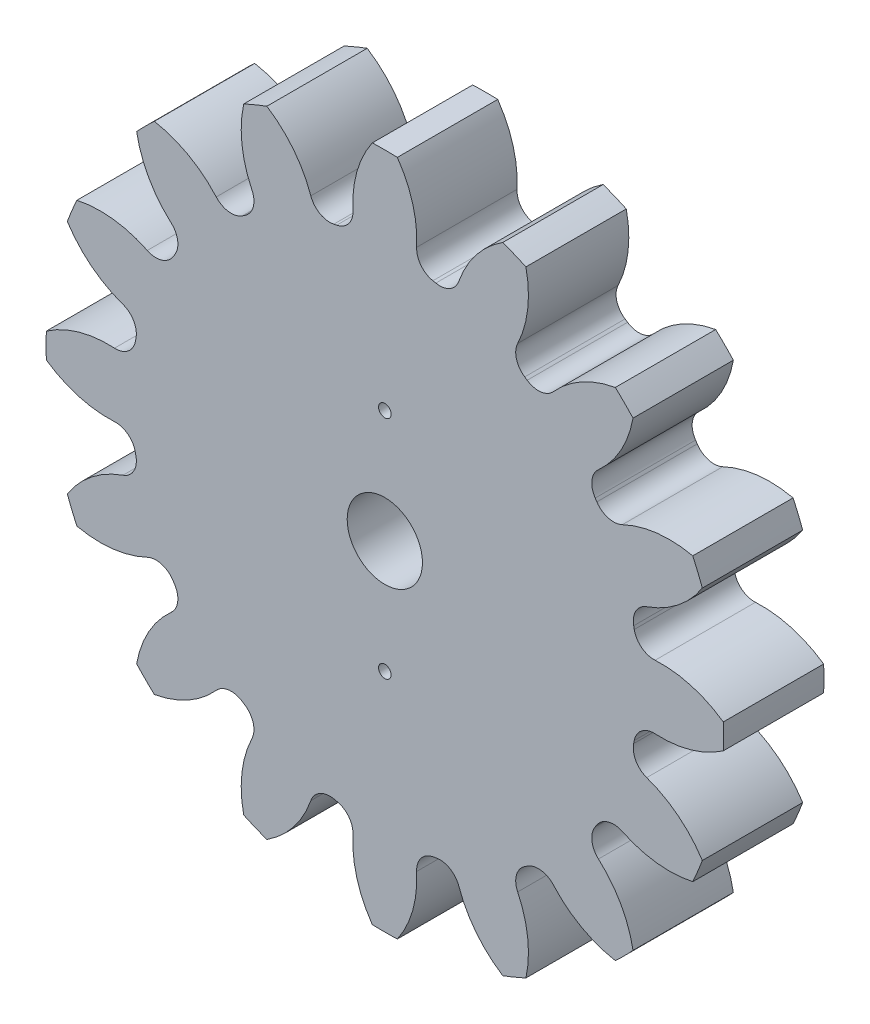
ISO-10303-21;
HEADER;
FILE_DESCRIPTION(('STEP AP214'),'2;1');
FILE_NAME('part.step','',(''),(''),'','','');
FILE_SCHEMA(('AUTOMOTIVE_DESIGN { 1 0 10303 214 1 1 1 1 }'));
ENDSEC;
DATA;
#1=APPLICATION_CONTEXT('core data for automotive mechanical design processes');
#2=APPLICATION_PROTOCOL_DEFINITION('international standard','automotive_design',2000,#1);
#3=PRODUCT_CONTEXT('',#1,'mechanical');
#4=PRODUCT('Part','Part','',(#3));
#5=PRODUCT_RELATED_PRODUCT_CATEGORY('part','',(#4));
#6=PRODUCT_DEFINITION_FORMATION('','',#4);
#7=PRODUCT_DEFINITION_CONTEXT('part definition',#1,'design');
#8=PRODUCT_DEFINITION('design','',#6,#7);
#9=PRODUCT_DEFINITION_SHAPE('','',#8);
#10=(LENGTH_UNIT() NAMED_UNIT(*) SI_UNIT(.MILLI.,.METRE.));
#11=(NAMED_UNIT(*) PLANE_ANGLE_UNIT() SI_UNIT($,.RADIAN.));
#12=(NAMED_UNIT(*) SI_UNIT($,.STERADIAN.) SOLID_ANGLE_UNIT());
#13=UNCERTAINTY_MEASURE_WITH_UNIT(LENGTH_MEASURE(1.E-05),#10,'distance_accuracy_value','');
#14=(GEOMETRIC_REPRESENTATION_CONTEXT(3) GLOBAL_UNCERTAINTY_ASSIGNED_CONTEXT((#13)) GLOBAL_UNIT_ASSIGNED_CONTEXT((#10,
#11,#12)) REPRESENTATION_CONTEXT('',''));
#15=CARTESIAN_POINT('',(0.,0.,0.));
#16=DIRECTION('',(0.,0.,1.));
#17=DIRECTION('',(1.,0.,0.));
#18=AXIS2_PLACEMENT_3D('',#15,#16,#17);
#19=CARTESIAN_POINT('',(-1.37870691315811,-0.560352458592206,8.));
#20=DIRECTION('',(0.,0.,-1.));
#21=DIRECTION('',(-1.,0.,0.));
#22=AXIS2_PLACEMENT_3D('',#19,#20,#21);
#23=CYLINDRICAL_SURFACE('',#22,3.);
#24=CARTESIAN_POINT('',(-1.37870691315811,-0.560352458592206,8.));
#25=DIRECTION('',(0.,0.,1.));
#26=DIRECTION('',(1.,0.,0.));
#27=AXIS2_PLACEMENT_3D('',#24,#25,#26);
#28=CIRCLE('',#27,3.);
#29=CARTESIAN_POINT('',(1.62129308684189,-0.560352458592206,8.));
#30=VERTEX_POINT('',#29);
#31=EDGE_CURVE('E658',#30,#30,#28,.T.);
#32=ORIENTED_EDGE('',*,*,#31,.T.);
#33=EDGE_LOOP('',(#32));
#34=FACE_BOUND('',#33,.T.);
#35=CARTESIAN_POINT('',(-1.37870691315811,-0.560352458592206,2.));
#36=DIRECTION('',(0.,0.,-1.));
#37=DIRECTION('',(-1.,0.,0.));
#38=AXIS2_PLACEMENT_3D('',#35,#36,#37);
#39=CIRCLE('',#38,3.);
#40=CARTESIAN_POINT('',(-4.37870691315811,-0.560352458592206,2.));
#41=VERTEX_POINT('',#40);
#42=EDGE_CURVE('E36',#41,#41,#39,.T.);
#43=ORIENTED_EDGE('',*,*,#42,.T.);
#44=EDGE_LOOP('',(#43));
#45=FACE_BOUND('',#44,.T.);
#46=ADVANCED_FACE('F32',(#34,#45),#23,.F.);
#47=CARTESIAN_POINT('',(-1.37870691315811,-0.560352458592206,8.));
#48=DIRECTION('',(0.,0.,1.));
#49=DIRECTION('',(1.,0.,0.));
#50=AXIS2_PLACEMENT_3D('',#47,#48,#49);
#51=PLANE('',#50);
#52=CARTESIAN_POINT('',(-1.37870691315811,8.43964754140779,8.));
#53=DIRECTION('',(0.,0.,-1.));
#54=DIRECTION('',(1.,0.,0.));
#55=AXIS2_PLACEMENT_3D('',#52,#53,#54);
#56=CIRCLE('',#55,0.5);
#57=CARTESIAN_POINT('',(-0.878706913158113,8.43964754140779,8.));
#58=VERTEX_POINT('',#57);
#59=EDGE_CURVE('E2060',#58,#58,#56,.T.);
#60=ORIENTED_EDGE('',*,*,#59,.T.);
#61=EDGE_LOOP('',(#60));
#62=FACE_BOUND('',#61,.T.);
#63=CARTESIAN_POINT('',(-1.37870691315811,-9.56035245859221,8.));
#64=DIRECTION('',(0.,0.,-1.));
#65=DIRECTION('',(-1.,0.,0.));
#66=AXIS2_PLACEMENT_3D('',#63,#64,#65);
#67=CIRCLE('',#66,0.5);
#68=CARTESIAN_POINT('',(-1.87870691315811,-9.56035245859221,8.));
#69=VERTEX_POINT('',#68);
#70=EDGE_CURVE('E2068',#69,#69,#67,.T.);
#71=ORIENTED_EDGE('',*,*,#70,.T.);
#72=EDGE_LOOP('',(#71));
#73=FACE_BOUND('',#72,.T.);
#74=CARTESIAN_POINT('',(12.6922204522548,17.458048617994,8.));
#75=DIRECTION('',(0.,0.,1.));
#76=DIRECTION('',(0.923879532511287,-0.382683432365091,0.));
#77=AXIS2_PLACEMENT_3D('',#74,#75,#76);
#78=CIRCLE('',#77,8.65751256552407);
#79=CARTESIAN_POINT('',(8.02434956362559,24.7493794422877,8.));
#80=VERTEX_POINT('',#79);
#81=CARTESIAN_POINT('',(4.52009893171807,20.3161867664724,8.));
#82=VERTEX_POINT('',#81);
#83=EDGE_CURVE('E998',#80,#82,#78,.T.);
#84=ORIENTED_EDGE('',*,*,#83,.T.);
#85=CARTESIAN_POINT('',(3.0098043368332,20.8444009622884,8.));
#86=DIRECTION('',(0.,0.,1.));
#87=DIRECTION('',(1.,0.,0.));
#88=AXIS2_PLACEMENT_3D('',#85,#86,#87);
#89=CIRCLE('',#88,1.6);
#90=CARTESIAN_POINT('',(2.6884488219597,19.2770048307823,8.));
#91=VERTEX_POINT('',#90);
#92=EDGE_CURVE('E1081',#82,#91,#89,.F.);
#93=ORIENTED_EDGE('',*,*,#92,.T.);
#94=CARTESIAN_POINT('',(-1.37870691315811,-0.560352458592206,8.));
#95=DIRECTION('',(0.,0.,1.));
#96=DIRECTION('',(1.,0.,0.));
#97=AXIS2_PLACEMENT_3D('',#94,#95,#96);
#98=CIRCLE('',#97,20.25);
#99=CARTESIAN_POINT('',(2.45515912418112,19.3234090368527,8.));
#100=VERTEX_POINT('',#99);
#101=EDGE_CURVE('E1014',#91,#100,#98,.T.);
#102=ORIENTED_EDGE('',*,*,#101,.T.);
#103=CARTESIAN_POINT('',(2.75808187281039,20.8944716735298,8.));
#104=DIRECTION('',(0.,0.,1.));
#105=DIRECTION('',(1.,0.,0.));
#106=AXIS2_PLACEMENT_3D('',#103,#104,#105);
#107=CIRCLE('',#106,1.6);
#108=CARTESIAN_POINT('',(1.160612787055,20.9844301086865,8.));
#109=VERTEX_POINT('',#108);
#110=EDGE_CURVE('E1056',#100,#109,#107,.F.);
#111=ORIENTED_EDGE('',*,*,#110,.T.);
#112=CARTESIAN_POINT('',(-7.48320513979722,21.4711902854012,8.));
#113=DIRECTION('',(0.,0.,-1.));
#114=DIRECTION('',(-1.,0.,0.));
#115=AXIS2_PLACEMENT_3D('',#112,#113,#114);
#116=CIRCLE('',#115,8.65751256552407);
#117=CARTESIAN_POINT('',(-0.380383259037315,26.4211847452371,8.));
#118=VERTEX_POINT('',#117);
#119=EDGE_CURVE('E1016',#118,#109,#116,.T.);
#120=ORIENTED_EDGE('',*,*,#119,.F.);
#121=CARTESIAN_POINT('',(-1.37870691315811,-0.560352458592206,8.));
#122=DIRECTION('',(0.,0.,1.));
#123=DIRECTION('',(1.,0.,0.));
#124=AXIS2_PLACEMENT_3D('',#121,#122,#123);
#125=CIRCLE('',#124,27.);
#126=CARTESIAN_POINT('',(-2.37703056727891,26.4211847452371,8.));
#127=VERTEX_POINT('',#126);
#128=EDGE_CURVE('E1020',#118,#127,#125,.T.);
#129=ORIENTED_EDGE('',*,*,#128,.T.);
#130=CARTESIAN_POINT('',(4.725791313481,21.4711902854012,8.));
#131=DIRECTION('',(0.,0.,1.));
#132=DIRECTION('',(1.,0.,0.));
#133=AXIS2_PLACEMENT_3D('',#130,#131,#132);
#134=CIRCLE('',#133,8.65751256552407);
#135=CARTESIAN_POINT('',(-3.91802661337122,20.9844301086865,8.));
#136=VERTEX_POINT('',#135);
#137=EDGE_CURVE('E1022',#127,#136,#134,.T.);
#138=ORIENTED_EDGE('',*,*,#137,.T.);
#139=CARTESIAN_POINT('',(-5.51549569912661,20.8944716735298,8.));
#140=DIRECTION('',(0.,0.,1.));
#141=DIRECTION('',(1.,0.,0.));
#142=AXIS2_PLACEMENT_3D('',#139,#140,#141);
#143=CIRCLE('',#142,1.6);
#144=CARTESIAN_POINT('',(-5.21257295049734,19.3234090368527,8.));
#145=VERTEX_POINT('',#144);
#146=EDGE_CURVE('E1060',#136,#145,#143,.F.);
#147=ORIENTED_EDGE('',*,*,#146,.T.);
#148=CARTESIAN_POINT('',(-1.37870691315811,-0.560352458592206,8.));
#149=DIRECTION('',(0.,0.,-1.));
#150=DIRECTION('',(-1.,0.,0.));
#151=AXIS2_PLACEMENT_3D('',#148,#149,#150);
#152=CIRCLE('',#151,20.25);
#153=CARTESIAN_POINT('',(-5.44586264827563,19.2770048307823,8.));
#154=VERTEX_POINT('',#153);
#155=EDGE_CURVE('E1025',#154,#145,#152,.T.);
#156=ORIENTED_EDGE('',*,*,#155,.F.);
#157=CARTESIAN_POINT('',(-5.76721816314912,20.8444009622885,8.));
#158=DIRECTION('',(0.,0.,1.));
#159=DIRECTION('',(1.,0.,0.));
#160=AXIS2_PLACEMENT_3D('',#157,#158,#159);
#161=CIRCLE('',#160,1.6);
#162=CARTESIAN_POINT('',(-7.27751275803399,20.3161867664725,8.));
#163=VERTEX_POINT('',#162);
#164=EDGE_CURVE('E652',#154,#163,#161,.F.);
#165=ORIENTED_EDGE('',*,*,#164,.T.);
#166=CARTESIAN_POINT('',(-15.4496342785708,17.4580486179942,8.));
#167=DIRECTION('',(0.,0.,-1.));
#168=DIRECTION('',(-0.923879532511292,-0.382683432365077,0.));
#169=AXIS2_PLACEMENT_3D('',#166,#167,#168);
#170=CIRCLE('',#169,8.65751256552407);
#171=CARTESIAN_POINT('',(-10.7817633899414,24.7493794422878,8.));
#172=VERTEX_POINT('',#171);
#173=EDGE_CURVE('E631',#172,#163,#170,.T.);
#174=ORIENTED_EDGE('',*,*,#173,.F.);
#175=CARTESIAN_POINT('',(-1.37870691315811,-0.560352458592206,8.));
#176=DIRECTION('',(0.,0.,1.));
#177=DIRECTION('',(0.923879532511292,0.382683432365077,0.));
#178=AXIS2_PLACEMENT_3D('',#175,#176,#177);
#179=CIRCLE('',#178,27.);
#180=CARTESIAN_POINT('',(-12.6264249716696,23.9852955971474,8.));
#181=VERTEX_POINT('',#180);
#182=EDGE_CURVE('E641',#172,#181,#179,.T.);
#183=ORIENTED_EDGE('',*,*,#182,.T.);
#184=CARTESIAN_POINT('',(-4.16999234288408,22.1302292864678,8.));
#185=DIRECTION('',(0.,0.,1.));
#186=DIRECTION('',(0.923879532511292,0.382683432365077,0.));
#187=AXIS2_PLACEMENT_3D('',#184,#185,#186);
#188=CIRCLE('',#187,8.65751256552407);
#189=CARTESIAN_POINT('',(-11.9695637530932,18.3726756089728,8.));
#190=VERTEX_POINT('',#189);
#191=EDGE_CURVE('E645',#181,#190,#188,.T.);
#192=ORIENTED_EDGE('',*,*,#191,.T.);
#193=CARTESIAN_POINT('',(-13.4110071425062,17.6782398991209,8.));
#194=DIRECTION('',(0.,0.,1.));
#195=DIRECTION('',(1.,0.,0.));
#196=AXIS2_PLACEMENT_3D('',#193,#194,#195);
#197=CIRCLE('',#196,1.6);
#198=CARTESIAN_POINT('',(-12.5299233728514,16.3426908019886,8.));
#199=VERTEX_POINT('',#198);
#200=EDGE_CURVE('E11',#190,#199,#197,.F.);
#201=ORIENTED_EDGE('',*,*,#200,.T.);
#202=CARTESIAN_POINT('',(-1.37870691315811,-0.560352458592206,8.));
#203=DIRECTION('',(0.,0.,1.));
#204=DIRECTION('',(0.707106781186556,0.707106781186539,0.));
#205=AXIS2_PLACEMENT_3D('',#202,#203,#204);
#206=CIRCLE('',#205,20.25);
#207=CARTESIAN_POINT('',(-12.7276968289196,16.2105428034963,8.));
#208=VERTEX_POINT('',#207);
#209=EDGE_CURVE('E665',#199,#208,#206,.T.);
#210=ORIENTED_EDGE('',*,*,#209,.T.);
#211=CARTESIAN_POINT('',(-13.6244071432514,17.535650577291,8.));
#212=DIRECTION('',(0.,0.,1.));
#213=DIRECTION('',(1.,0.,0.));
#214=AXIS2_PLACEMENT_3D('',#211,#212,#213);
#215=CIRCLE('',#214,1.6);
#216=CARTESIAN_POINT('',(-14.8175985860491,16.4696795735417,8.));
#217=VERTEX_POINT('',#216);
#218=EDGE_CURVE('E1337',#208,#217,#215,.F.);
#219=ORIENTED_EDGE('',*,*,#218,.T.);
#220=CARTESIAN_POINT('',(-21.2738922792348,10.7017687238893,8.));
#221=DIRECTION('',(0.,0.,-1.));
#222=DIRECTION('',(-0.707106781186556,-0.707106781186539,0.));
#223=AXIS2_PLACEMENT_3D('',#220,#221,#222);
#224=CIRCLE('',#223,8.65751256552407);
#225=CARTESIAN_POINT('',(-19.7516134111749,19.2243968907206,8.));
#226=VERTEX_POINT('',#225);
#227=EDGE_CURVE('E667',#226,#217,#224,.T.);
#228=ORIENTED_EDGE('',*,*,#227,.F.);
#229=CARTESIAN_POINT('',(-1.37870691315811,-0.560352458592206,8.));
#230=DIRECTION('',(0.,0.,1.));
#231=DIRECTION('',(0.707106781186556,0.707106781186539,0.));
#232=AXIS2_PLACEMENT_3D('',#229,#230,#231);
#233=CIRCLE('',#232,27.);
#234=CARTESIAN_POINT('',(-21.1634562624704,17.8125540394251,8.));
#235=VERTEX_POINT('',#234);
#236=EDGE_CURVE('E671',#226,#235,#233,.T.);
#237=ORIENTED_EDGE('',*,*,#236,.T.);
#238=CARTESIAN_POINT('',(-12.6408280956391,19.3348329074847,8.));
#239=DIRECTION('',(0.,0.,1.));
#240=DIRECTION('',(0.707106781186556,0.707106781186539,0.));
#241=AXIS2_PLACEMENT_3D('',#238,#239,#240);
#242=CIRCLE('',#241,8.65751256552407);
#243=CARTESIAN_POINT('',(-18.4087389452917,12.8785392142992,8.));
#244=VERTEX_POINT('',#243);
#245=EDGE_CURVE('E673',#235,#244,#242,.T.);
#246=ORIENTED_EDGE('',*,*,#245,.T.);
#247=CARTESIAN_POINT('',(-19.474709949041,11.6853477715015,8.));
#248=DIRECTION('',(0.,0.,1.));
#249=DIRECTION('',(1.,0.,0.));
#250=AXIS2_PLACEMENT_3D('',#247,#248,#249);
#251=CIRCLE('',#250,1.6);
#252=CARTESIAN_POINT('',(-18.1496021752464,10.7886374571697,8.));
#253=VERTEX_POINT('',#252);
#254=EDGE_CURVE('E1341',#244,#253,#251,.F.);
#255=ORIENTED_EDGE('',*,*,#254,.T.);
#256=CARTESIAN_POINT('',(-1.37870691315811,-0.560352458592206,8.));
#257=DIRECTION('',(0.,0.,1.));
#258=DIRECTION('',(0.3826834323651,0.923879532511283,0.));
#259=AXIS2_PLACEMENT_3D('',#256,#257,#258);
#260=CIRCLE('',#259,20.25);
#261=CARTESIAN_POINT('',(-18.2817501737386,10.5908640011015,8.));
#262=VERTEX_POINT('',#261);
#263=EDGE_CURVE('E690',#253,#262,#260,.T.);
#264=ORIENTED_EDGE('',*,*,#263,.T.);
#265=CARTESIAN_POINT('',(-19.6172992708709,11.4719477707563,8.));
#266=DIRECTION('',(0.,0.,1.));
#267=DIRECTION('',(1.,0.,0.));
#268=AXIS2_PLACEMENT_3D('',#265,#266,#267);
#269=CIRCLE('',#268,1.6);
#270=CARTESIAN_POINT('',(-20.3117349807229,10.0305043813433,8.));
#271=VERTEX_POINT('',#270);
#272=EDGE_CURVE('E1317',#262,#271,#269,.F.);
#273=ORIENTED_EDGE('',*,*,#272,.T.);
#274=CARTESIAN_POINT('',(-24.069288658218,2.23093297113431,8.));
#275=DIRECTION('',(0.,0.,-1.));
#276=DIRECTION('',(-0.3826834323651,-0.923879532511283,0.));
#277=AXIS2_PLACEMENT_3D('',#274,#275,#276);
#278=CIRCLE('',#277,8.65751256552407);
#279=CARTESIAN_POINT('',(-25.9243549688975,10.6873655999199,8.));
#280=VERTEX_POINT('',#279);
#281=EDGE_CURVE('E692',#280,#271,#278,.T.);
#282=ORIENTED_EDGE('',*,*,#281,.F.);
#283=CARTESIAN_POINT('',(-1.37870691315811,-0.560352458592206,8.));
#284=DIRECTION('',(0.,0.,1.));
#285=DIRECTION('',(0.3826834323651,0.923879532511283,0.));
#286=AXIS2_PLACEMENT_3D('',#283,#284,#285);
#287=CIRCLE('',#286,27.);
#288=CARTESIAN_POINT('',(-26.6884388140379,8.84270401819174,8.));
#289=VERTEX_POINT('',#288);
#290=EDGE_CURVE('E696',#280,#289,#287,.T.);
#291=ORIENTED_EDGE('',*,*,#290,.T.);
#292=CARTESIAN_POINT('',(-19.3971079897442,13.5105749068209,8.));
#293=DIRECTION('',(0.,0.,1.));
#294=DIRECTION('',(0.3826834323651,0.923879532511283,0.));
#295=AXIS2_PLACEMENT_3D('',#292,#293,#294);
#296=CIRCLE('',#295,8.65751256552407);
#297=CARTESIAN_POINT('',(-22.2552461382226,5.33845338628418,8.));
#298=VERTEX_POINT('',#297);
#299=EDGE_CURVE('E698',#289,#298,#296,.T.);
#300=ORIENTED_EDGE('',*,*,#299,.T.);
#301=CARTESIAN_POINT('',(-22.7834603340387,3.82815879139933,8.));
#302=DIRECTION('',(0.,0.,1.));
#303=DIRECTION('',(1.,0.,0.));
#304=AXIS2_PLACEMENT_3D('',#301,#302,#303);
#305=CIRCLE('',#304,1.6);
#306=CARTESIAN_POINT('',(-21.2160642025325,3.5068032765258,8.));
#307=VERTEX_POINT('',#306);
#308=EDGE_CURVE('E1321',#298,#307,#305,.F.);
#309=ORIENTED_EDGE('',*,*,#308,.T.);
#310=CARTESIAN_POINT('',(-1.37870691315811,-0.560352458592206,8.));
#311=DIRECTION('',(0.,0.,1.));
#312=DIRECTION('',(0.,1.,0.));
#313=AXIS2_PLACEMENT_3D('',#310,#311,#312);
#314=CIRCLE('',#313,20.25);
#315=CARTESIAN_POINT('',(-21.262468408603,3.27351357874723,8.));
#316=VERTEX_POINT('',#315);
#317=EDGE_CURVE('E715',#307,#316,#314,.T.);
#318=ORIENTED_EDGE('',*,*,#317,.T.);
#319=CARTESIAN_POINT('',(-22.8335310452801,3.57643632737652,8.));
#320=DIRECTION('',(0.,0.,1.));
#321=DIRECTION('',(1.,0.,0.));
#322=AXIS2_PLACEMENT_3D('',#319,#320,#321);
#323=CIRCLE('',#322,1.6);
#324=CARTESIAN_POINT('',(-22.9234894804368,1.97896724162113,8.));
#325=VERTEX_POINT('',#324);
#326=EDGE_CURVE('E1297',#316,#325,#323,.F.);
#327=ORIENTED_EDGE('',*,*,#326,.T.);
#328=CARTESIAN_POINT('',(-23.4102496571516,-6.66485068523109,8.));
#329=DIRECTION('',(0.,0.,-1.));
#330=DIRECTION('',(0.,-1.,0.));
#331=AXIS2_PLACEMENT_3D('',#328,#329,#330);
#332=CIRCLE('',#331,8.65751256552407);
#333=CARTESIAN_POINT('',(-28.3602441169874,0.437971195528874,8.));
#334=VERTEX_POINT('',#333);
#335=EDGE_CURVE('E717',#334,#325,#332,.T.);
#336=ORIENTED_EDGE('',*,*,#335,.F.);
#337=CARTESIAN_POINT('',(-1.37870691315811,-0.560352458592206,8.));
#338=DIRECTION('',(0.,0.,1.));
#339=DIRECTION('',(0.,1.,0.));
#340=AXIS2_PLACEMENT_3D('',#337,#338,#339);
#341=CIRCLE('',#340,27.);
#342=CARTESIAN_POINT('',(-28.3602441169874,-1.55867611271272,8.));
#343=VERTEX_POINT('',#342);
#344=EDGE_CURVE('E721',#334,#343,#341,.T.);
#345=ORIENTED_EDGE('',*,*,#344,.T.);
#346=CARTESIAN_POINT('',(-23.4102496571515,5.54414576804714,8.));
#347=DIRECTION('',(0.,0.,1.));
#348=DIRECTION('',(0.,1.,0.));
#349=AXIS2_PLACEMENT_3D('',#346,#347,#348);
#350=CIRCLE('',#349,8.65751256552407);
#351=CARTESIAN_POINT('',(-22.9234894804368,-3.09967215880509,8.));
#352=VERTEX_POINT('',#351);
#353=EDGE_CURVE('E723',#343,#352,#350,.T.);
#354=ORIENTED_EDGE('',*,*,#353,.T.);
#355=CARTESIAN_POINT('',(-22.8335310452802,-4.69714124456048,8.));
#356=DIRECTION('',(0.,0.,1.));
#357=DIRECTION('',(1.,0.,0.));
#358=AXIS2_PLACEMENT_3D('',#355,#356,#357);
#359=CIRCLE('',#358,1.6);
#360=CARTESIAN_POINT('',(-21.262468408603,-4.39421849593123,8.));
#361=VERTEX_POINT('',#360);
#362=EDGE_CURVE('E1301',#352,#361,#359,.F.);
#363=ORIENTED_EDGE('',*,*,#362,.T.);
#364=CARTESIAN_POINT('',(-1.37870691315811,-0.560352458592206,8.));
#365=DIRECTION('',(0.,0.,1.));
#366=DIRECTION('',(-0.382683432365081,0.923879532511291,0.));
#367=AXIS2_PLACEMENT_3D('',#364,#365,#366);
#368=CIRCLE('',#367,20.25);
#369=CARTESIAN_POINT('',(-21.2160642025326,-4.6275081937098,8.));
#370=VERTEX_POINT('',#369);
#371=EDGE_CURVE('E740',#361,#370,#368,.T.);
#372=ORIENTED_EDGE('',*,*,#371,.T.);
#373=CARTESIAN_POINT('',(-22.7834603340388,-4.94886370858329,8.));
#374=DIRECTION('',(0.,0.,1.));
#375=DIRECTION('',(1.,0.,0.));
#376=AXIS2_PLACEMENT_3D('',#373,#374,#375);
#377=CIRCLE('',#376,1.6);
#378=CARTESIAN_POINT('',(-22.2552461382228,-6.45915830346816,8.));
#379=VERTEX_POINT('',#378);
#380=EDGE_CURVE('E1277',#370,#379,#377,.F.);
#381=ORIENTED_EDGE('',*,*,#380,.T.);
#382=CARTESIAN_POINT('',(-19.3971079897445,-14.6312798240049,8.));
#383=DIRECTION('',(0.,0.,-1.));
#384=DIRECTION('',(0.382683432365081,-0.923879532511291,0.));
#385=AXIS2_PLACEMENT_3D('',#382,#383,#384);
#386=CIRCLE('',#385,8.65751256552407);
#387=CARTESIAN_POINT('',(-26.6884388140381,-9.96340893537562,8.));
#388=VERTEX_POINT('',#387);
#389=EDGE_CURVE('E742',#388,#379,#386,.T.);
#390=ORIENTED_EDGE('',*,*,#389,.F.);
#391=CARTESIAN_POINT('',(-1.37870691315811,-0.560352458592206,8.));
#392=DIRECTION('',(0.,0.,1.));
#393=DIRECTION('',(-0.382683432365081,0.923879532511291,0.));
#394=AXIS2_PLACEMENT_3D('',#391,#392,#393);
#395=CIRCLE('',#394,27.);
#396=CARTESIAN_POINT('',(-25.9243549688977,-11.8080705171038,8.));
#397=VERTEX_POINT('',#396);
#398=EDGE_CURVE('E746',#388,#397,#395,.T.);
#399=ORIENTED_EDGE('',*,*,#398,.T.);
#400=CARTESIAN_POINT('',(-24.0692886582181,-3.35163788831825,8.));
#401=DIRECTION('',(0.,0.,1.));
#402=DIRECTION('',(-0.382683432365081,0.923879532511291,0.));
#403=AXIS2_PLACEMENT_3D('',#400,#401,#402);
#404=CIRCLE('',#403,8.65751256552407);
#405=CARTESIAN_POINT('',(-20.3117349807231,-11.1512092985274,8.));
#406=VERTEX_POINT('',#405);
#407=EDGE_CURVE('E748',#397,#406,#404,.T.);
#408=ORIENTED_EDGE('',*,*,#407,.T.);
#409=CARTESIAN_POINT('',(-19.6172992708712,-12.5926526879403,8.));
#410=DIRECTION('',(0.,0.,1.));
#411=DIRECTION('',(1.,0.,0.));
#412=AXIS2_PLACEMENT_3D('',#409,#410,#411);
#413=CIRCLE('',#412,1.6);
#414=CARTESIAN_POINT('',(-18.2817501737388,-11.7115689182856,8.));
#415=VERTEX_POINT('',#414);
#416=EDGE_CURVE('E1281',#406,#415,#413,.F.);
#417=ORIENTED_EDGE('',*,*,#416,.T.);
#418=CARTESIAN_POINT('',(-1.37870691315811,-0.560352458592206,8.));
#419=DIRECTION('',(0.,0.,1.));
#420=DIRECTION('',(-0.707106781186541,0.707106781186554,0.));
#421=AXIS2_PLACEMENT_3D('',#418,#419,#420);
#422=CIRCLE('',#421,20.25);
#423=CARTESIAN_POINT('',(-18.1496021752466,-11.9093423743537,8.));
#424=VERTEX_POINT('',#423);
#425=EDGE_CURVE('E765',#415,#424,#422,.T.);
#426=ORIENTED_EDGE('',*,*,#425,.T.);
#427=CARTESIAN_POINT('',(-19.4747099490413,-12.8060526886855,8.));
#428=DIRECTION('',(0.,0.,1.));
#429=DIRECTION('',(1.,0.,0.));
#430=AXIS2_PLACEMENT_3D('',#427,#428,#429);
#431=CIRCLE('',#430,1.6);
#432=CARTESIAN_POINT('',(-18.408738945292,-13.9992441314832,8.));
#433=VERTEX_POINT('',#432);
#434=EDGE_CURVE('E1257',#424,#433,#431,.F.);
#435=ORIENTED_EDGE('',*,*,#434,.T.);
#436=CARTESIAN_POINT('',(-12.6408280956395,-20.4555378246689,8.));
#437=DIRECTION('',(0.,0.,-1.));
#438=DIRECTION('',(0.707106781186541,-0.707106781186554,0.));
#439=AXIS2_PLACEMENT_3D('',#436,#437,#438);
#440=CIRCLE('',#439,8.65751256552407);
#441=CARTESIAN_POINT('',(-21.1634562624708,-18.9332589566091,8.));
#442=VERTEX_POINT('',#441);
#443=EDGE_CURVE('E767',#442,#433,#440,.T.);
#444=ORIENTED_EDGE('',*,*,#443,.F.);
#445=CARTESIAN_POINT('',(-1.37870691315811,-0.560352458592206,8.));
#446=DIRECTION('',(0.,0.,1.));
#447=DIRECTION('',(-0.707106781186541,0.707106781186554,0.));
#448=AXIS2_PLACEMENT_3D('',#445,#446,#447);
#449=CIRCLE('',#448,27.);
#450=CARTESIAN_POINT('',(-19.7516134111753,-20.3451018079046,8.));
#451=VERTEX_POINT('',#450);
#452=EDGE_CURVE('E771',#442,#451,#449,.T.);
#453=ORIENTED_EDGE('',*,*,#452,.T.);
#454=CARTESIAN_POINT('',(-21.273892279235,-11.8224736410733,8.));
#455=DIRECTION('',(0.,0.,1.));
#456=DIRECTION('',(-0.707106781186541,0.707106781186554,0.));
#457=AXIS2_PLACEMENT_3D('',#454,#455,#456);
#458=CIRCLE('',#457,8.65751256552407);
#459=CARTESIAN_POINT('',(-14.8175985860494,-17.5903844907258,8.));
#460=VERTEX_POINT('',#459);
#461=EDGE_CURVE('E773',#451,#460,#458,.T.);
#462=ORIENTED_EDGE('',*,*,#461,.T.);
#463=CARTESIAN_POINT('',(-13.6244071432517,-18.6563554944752,8.));
#464=DIRECTION('',(0.,0.,1.));
#465=DIRECTION('',(1.,0.,0.));
#466=AXIS2_PLACEMENT_3D('',#463,#464,#465);
#467=CIRCLE('',#466,1.6);
#468=CARTESIAN_POINT('',(-12.7276968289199,-17.3312477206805,8.));
#469=VERTEX_POINT('',#468);
#470=EDGE_CURVE('E1261',#460,#469,#467,.F.);
#471=ORIENTED_EDGE('',*,*,#470,.T.);
#472=CARTESIAN_POINT('',(-1.37870691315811,-0.560352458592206,8.));
#473=DIRECTION('',(0.,0.,1.));
#474=DIRECTION('',(-0.923879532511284,0.382683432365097,0.));
#475=AXIS2_PLACEMENT_3D('',#472,#473,#474);
#476=CIRCLE('',#475,20.25);
#477=CARTESIAN_POINT('',(-12.5299233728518,-17.4633957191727,8.));
#478=VERTEX_POINT('',#477);
#479=EDGE_CURVE('E790',#469,#478,#476,.T.);
#480=ORIENTED_EDGE('',*,*,#479,.T.);
#481=CARTESIAN_POINT('',(-13.4110071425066,-18.798944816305,8.));
#482=DIRECTION('',(0.,0.,1.));
#483=DIRECTION('',(1.,0.,0.));
#484=AXIS2_PLACEMENT_3D('',#481,#482,#483);
#485=CIRCLE('',#484,1.6);
#486=CARTESIAN_POINT('',(-11.9695637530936,-19.493380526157,8.));
#487=VERTEX_POINT('',#486);
#488=EDGE_CURVE('E1237',#478,#487,#485,.F.);
#489=ORIENTED_EDGE('',*,*,#488,.T.);
#490=CARTESIAN_POINT('',(-4.16999234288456,-23.2509342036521,8.));
#491=DIRECTION('',(0.,0.,-1.));
#492=DIRECTION('',(0.923879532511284,-0.382683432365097,0.));
#493=AXIS2_PLACEMENT_3D('',#490,#491,#492);
#494=CIRCLE('',#493,8.65751256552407);
#495=CARTESIAN_POINT('',(-12.6264249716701,-25.1060005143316,8.));
#496=VERTEX_POINT('',#495);
#497=EDGE_CURVE('E792',#496,#487,#494,.T.);
#498=ORIENTED_EDGE('',*,*,#497,.F.);
#499=CARTESIAN_POINT('',(-1.37870691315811,-0.560352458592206,8.));
#500=DIRECTION('',(0.,0.,1.));
#501=DIRECTION('',(-0.923879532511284,0.382683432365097,0.));
#502=AXIS2_PLACEMENT_3D('',#499,#500,#501);
#503=CIRCLE('',#502,27.);
#504=CARTESIAN_POINT('',(-10.781763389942,-25.870084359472,8.));
#505=VERTEX_POINT('',#504);
#506=EDGE_CURVE('E796',#496,#505,#503,.T.);
#507=ORIENTED_EDGE('',*,*,#506,.T.);
#508=CARTESIAN_POINT('',(-15.4496342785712,-18.5787535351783,8.));
#509=DIRECTION('',(0.,0.,1.));
#510=DIRECTION('',(-0.923879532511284,0.382683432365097,0.));
#511=AXIS2_PLACEMENT_3D('',#508,#509,#510);
#512=CIRCLE('',#511,8.65751256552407);
#513=CARTESIAN_POINT('',(-7.27751275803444,-21.4368916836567,8.));
#514=VERTEX_POINT('',#513);
#515=EDGE_CURVE('E798',#505,#514,#512,.T.);
#516=ORIENTED_EDGE('',*,*,#515,.T.);
#517=CARTESIAN_POINT('',(-5.76721816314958,-21.9651058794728,8.));
#518=DIRECTION('',(0.,0.,1.));
#519=DIRECTION('',(1.,0.,0.));
#520=AXIS2_PLACEMENT_3D('',#517,#518,#519);
#521=CIRCLE('',#520,1.6);
#522=CARTESIAN_POINT('',(-5.44586264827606,-20.3977097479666,8.));
#523=VERTEX_POINT('',#522);
#524=EDGE_CURVE('E1241',#514,#523,#521,.F.);
#525=ORIENTED_EDGE('',*,*,#524,.T.);
#526=CARTESIAN_POINT('',(-1.37870691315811,-0.560352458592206,8.));
#527=DIRECTION('',(0.,0.,1.));
#528=DIRECTION('',(-1.,0.,0.));
#529=AXIS2_PLACEMENT_3D('',#526,#527,#528);
#530=CIRCLE('',#529,20.25);
#531=CARTESIAN_POINT('',(-5.21257295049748,-20.4441139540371,8.));
#532=VERTEX_POINT('',#531);
#533=EDGE_CURVE('E815',#523,#532,#530,.T.);
#534=ORIENTED_EDGE('',*,*,#533,.T.);
#535=CARTESIAN_POINT('',(-5.51549569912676,-22.0151765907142,8.));
#536=DIRECTION('',(0.,0.,1.));
#537=DIRECTION('',(1.,0.,0.));
#538=AXIS2_PLACEMENT_3D('',#535,#536,#537);
#539=CIRCLE('',#538,1.6);
#540=CARTESIAN_POINT('',(-3.91802661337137,-22.1051350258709,8.));
#541=VERTEX_POINT('',#540);
#542=EDGE_CURVE('E1217',#532,#541,#539,.F.);
#543=ORIENTED_EDGE('',*,*,#542,.T.);
#544=CARTESIAN_POINT('',(4.72579131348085,-22.5918952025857,8.));
#545=DIRECTION('',(0.,0.,-1.));
#546=DIRECTION('',(1.,0.,0.));
#547=AXIS2_PLACEMENT_3D('',#544,#545,#546);
#548=CIRCLE('',#547,8.65751256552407);
#549=CARTESIAN_POINT('',(-2.3770305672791,-27.5418896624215,8.));
#550=VERTEX_POINT('',#549);
#551=EDGE_CURVE('E817',#550,#541,#548,.T.);
#552=ORIENTED_EDGE('',*,*,#551,.F.);
#553=CARTESIAN_POINT('',(-1.37870691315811,-0.560352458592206,8.));
#554=DIRECTION('',(0.,0.,1.));
#555=DIRECTION('',(-1.,0.,0.));
#556=AXIS2_PLACEMENT_3D('',#553,#554,#555);
#557=CIRCLE('',#556,27.);
#558=CARTESIAN_POINT('',(-0.380383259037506,-27.5418896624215,8.));
#559=VERTEX_POINT('',#558);
#560=EDGE_CURVE('E821',#550,#559,#557,.T.);
#561=ORIENTED_EDGE('',*,*,#560,.T.);
#562=CARTESIAN_POINT('',(-7.48320513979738,-22.5918952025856,8.));
#563=DIRECTION('',(0.,0.,1.));
#564=DIRECTION('',(-1.,0.,0.));
#565=AXIS2_PLACEMENT_3D('',#562,#563,#564);
#566=CIRCLE('',#565,8.65751256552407);
#567=CARTESIAN_POINT('',(1.16061278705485,-22.1051350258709,8.));
#568=VERTEX_POINT('',#567);
#569=EDGE_CURVE('E823',#559,#568,#566,.T.);
#570=ORIENTED_EDGE('',*,*,#569,.T.);
#571=CARTESIAN_POINT('',(2.75808187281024,-22.0151765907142,8.));
#572=DIRECTION('',(0.,0.,1.));
#573=DIRECTION('',(1.,0.,0.));
#574=AXIS2_PLACEMENT_3D('',#571,#572,#573);
#575=CIRCLE('',#574,1.6);
#576=CARTESIAN_POINT('',(2.45515912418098,-20.4441139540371,8.));
#577=VERTEX_POINT('',#576);
#578=EDGE_CURVE('E1221',#568,#577,#575,.F.);
#579=ORIENTED_EDGE('',*,*,#578,.T.);
#580=CARTESIAN_POINT('',(-1.37870691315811,-0.560352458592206,8.));
#581=DIRECTION('',(0.,0.,1.));
#582=DIRECTION('',(-0.923879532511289,-0.382683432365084,0.));
#583=AXIS2_PLACEMENT_3D('',#580,#581,#582);
#584=CIRCLE('',#583,20.25);
#585=CARTESIAN_POINT('',(2.68844882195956,-20.3977097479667,8.));
#586=VERTEX_POINT('',#585);
#587=EDGE_CURVE('E840',#577,#586,#584,.T.);
#588=ORIENTED_EDGE('',*,*,#587,.T.);
#589=CARTESIAN_POINT('',(3.00980433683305,-21.9651058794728,8.));
#590=DIRECTION('',(0.,0.,1.));
#591=DIRECTION('',(1.,0.,0.));
#592=AXIS2_PLACEMENT_3D('',#589,#590,#591);
#593=CIRCLE('',#592,1.6);
#594=CARTESIAN_POINT('',(4.52009893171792,-21.4368916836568,8.));
#595=VERTEX_POINT('',#594);
#596=EDGE_CURVE('E1197',#586,#595,#593,.F.);
#597=ORIENTED_EDGE('',*,*,#596,.T.);
#598=CARTESIAN_POINT('',(12.6922204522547,-18.5787535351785,8.));
#599=DIRECTION('',(0.,0.,-1.));
#600=DIRECTION('',(0.923879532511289,0.382683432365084,0.));
#601=AXIS2_PLACEMENT_3D('',#598,#599,#600);
#602=CIRCLE('',#601,8.65751256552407);
#603=CARTESIAN_POINT('',(8.0243495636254,-25.8700843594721,8.));
#604=VERTEX_POINT('',#603);
#605=EDGE_CURVE('E842',#604,#595,#602,.T.);
#606=ORIENTED_EDGE('',*,*,#605,.F.);
#607=CARTESIAN_POINT('',(-1.37870691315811,-0.560352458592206,8.));
#608=DIRECTION('',(0.,0.,1.));
#609=DIRECTION('',(-0.923879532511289,-0.382683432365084,0.));
#610=AXIS2_PLACEMENT_3D('',#607,#608,#609);
#611=CIRCLE('',#610,27.);
#612=CARTESIAN_POINT('',(9.86901114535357,-25.1060005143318,8.));
#613=VERTEX_POINT('',#612);
#614=EDGE_CURVE('E846',#604,#613,#611,.T.);
#615=ORIENTED_EDGE('',*,*,#614,.T.);
#616=CARTESIAN_POINT('',(1.41257851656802,-23.2509342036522,8.));
#617=DIRECTION('',(0.,0.,1.));
#618=DIRECTION('',(-0.923879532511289,-0.382683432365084,0.));
#619=AXIS2_PLACEMENT_3D('',#616,#617,#618);
#620=CIRCLE('',#619,8.65751256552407);
#621=CARTESIAN_POINT('',(9.21214992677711,-19.4933805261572,8.));
#622=VERTEX_POINT('',#621);
#623=EDGE_CURVE('E848',#613,#622,#620,.T.);
#624=ORIENTED_EDGE('',*,*,#623,.T.);
#625=CARTESIAN_POINT('',(10.6535933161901,-18.7989448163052,8.));
#626=DIRECTION('',(0.,0.,1.));
#627=DIRECTION('',(1.,0.,0.));
#628=AXIS2_PLACEMENT_3D('',#625,#626,#627);
#629=CIRCLE('',#628,1.6);
#630=CARTESIAN_POINT('',(9.77250954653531,-17.4633957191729,8.));
#631=VERTEX_POINT('',#630);
#632=EDGE_CURVE('E1201',#622,#631,#629,.F.);
#633=ORIENTED_EDGE('',*,*,#632,.T.);
#634=CARTESIAN_POINT('',(-1.37870691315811,-0.560352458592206,8.));
#635=DIRECTION('',(0.,0.,1.));
#636=DIRECTION('',(-0.707106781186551,-0.707106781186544,0.));
#637=AXIS2_PLACEMENT_3D('',#634,#635,#636);
#638=CIRCLE('',#637,20.25);
#639=CARTESIAN_POINT('',(9.97028300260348,-17.3312477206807,8.));
#640=VERTEX_POINT('',#639);
#641=EDGE_CURVE('E865',#631,#640,#638,.T.);
#642=ORIENTED_EDGE('',*,*,#641,.T.);
#643=CARTESIAN_POINT('',(10.8669933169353,-18.6563554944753,8.));
#644=DIRECTION('',(0.,0.,1.));
#645=DIRECTION('',(1.,0.,0.));
#646=AXIS2_PLACEMENT_3D('',#643,#644,#645);
#647=CIRCLE('',#646,1.6);
#648=CARTESIAN_POINT('',(12.060184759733,-17.590384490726,8.));
#649=VERTEX_POINT('',#648);
#650=EDGE_CURVE('E1177',#640,#649,#647,.F.);
#651=ORIENTED_EDGE('',*,*,#650,.T.);
#652=CARTESIAN_POINT('',(18.5164784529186,-11.8224736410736,8.));
#653=DIRECTION('',(0.,0.,-1.));
#654=DIRECTION('',(0.707106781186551,0.707106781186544,0.));
#655=AXIS2_PLACEMENT_3D('',#652,#653,#654);
#656=CIRCLE('',#655,8.65751256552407);
#657=CARTESIAN_POINT('',(16.9941995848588,-20.3451018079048,8.));
#658=VERTEX_POINT('',#657);
#659=EDGE_CURVE('E867',#658,#649,#656,.T.);
#660=ORIENTED_EDGE('',*,*,#659,.F.);
#661=CARTESIAN_POINT('',(-1.37870691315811,-0.560352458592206,8.));
#662=DIRECTION('',(0.,0.,1.));
#663=DIRECTION('',(-0.707106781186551,-0.707106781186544,0.));
#664=AXIS2_PLACEMENT_3D('',#661,#662,#663);
#665=CIRCLE('',#664,27.);
#666=CARTESIAN_POINT('',(18.4060424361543,-18.9332589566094,8.));
#667=VERTEX_POINT('',#666);
#668=EDGE_CURVE('E871',#658,#667,#665,.T.);
#669=ORIENTED_EDGE('',*,*,#668,.T.);
#670=CARTESIAN_POINT('',(9.88341426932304,-20.4555378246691,8.));
#671=DIRECTION('',(0.,0.,1.));
#672=DIRECTION('',(-0.707106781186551,-0.707106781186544,0.));
#673=AXIS2_PLACEMENT_3D('',#670,#671,#672);
#674=CIRCLE('',#673,8.65751256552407);
#675=CARTESIAN_POINT('',(15.6513251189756,-13.9992441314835,8.));
#676=VERTEX_POINT('',#675);
#677=EDGE_CURVE('E873',#667,#676,#674,.T.);
#678=ORIENTED_EDGE('',*,*,#677,.T.);
#679=CARTESIAN_POINT('',(16.7172961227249,-12.8060526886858,8.));
#680=DIRECTION('',(0.,0.,1.));
#681=DIRECTION('',(1.,0.,0.));
#682=AXIS2_PLACEMENT_3D('',#679,#680,#681);
#683=CIRCLE('',#682,1.6);
#684=CARTESIAN_POINT('',(15.3921883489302,-11.909342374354,8.));
#685=VERTEX_POINT('',#684);
#686=EDGE_CURVE('E1181',#676,#685,#683,.F.);
#687=ORIENTED_EDGE('',*,*,#686,.T.);
#688=CARTESIAN_POINT('',(-1.37870691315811,-0.560352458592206,8.));
#689=DIRECTION('',(0.,0.,1.));
#690=DIRECTION('',(-0.382683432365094,-0.923879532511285,0.));
#691=AXIS2_PLACEMENT_3D('',#688,#689,#690);
#692=CIRCLE('',#691,20.25);
#693=CARTESIAN_POINT('',(15.5243363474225,-11.7115689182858,8.));
#694=VERTEX_POINT('',#693);
#695=EDGE_CURVE('E890',#685,#694,#692,.T.);
#696=ORIENTED_EDGE('',*,*,#695,.T.);
#697=CARTESIAN_POINT('',(16.8598854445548,-12.5926526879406,8.));
#698=DIRECTION('',(0.,0.,1.));
#699=DIRECTION('',(1.,0.,0.));
#700=AXIS2_PLACEMENT_3D('',#697,#698,#699);
#701=CIRCLE('',#700,1.6);
#702=CARTESIAN_POINT('',(17.5543211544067,-11.1512092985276,8.));
#703=VERTEX_POINT('',#702);
#704=EDGE_CURVE('E1157',#694,#703,#701,.F.);
#705=ORIENTED_EDGE('',*,*,#704,.T.);
#706=CARTESIAN_POINT('',(21.3118748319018,-3.35163788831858,8.));
#707=DIRECTION('',(0.,0.,-1.));
#708=DIRECTION('',(0.382683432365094,0.923879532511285,0.));
#709=AXIS2_PLACEMENT_3D('',#706,#707,#708);
#710=CIRCLE('',#709,8.65751256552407);
#711=CARTESIAN_POINT('',(23.1669411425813,-11.8080705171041,8.));
#712=VERTEX_POINT('',#711);
#713=EDGE_CURVE('E892',#712,#703,#710,.T.);
#714=ORIENTED_EDGE('',*,*,#713,.F.);
#715=CARTESIAN_POINT('',(-1.37870691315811,-0.560352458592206,8.));
#716=DIRECTION('',(0.,0.,1.));
#717=DIRECTION('',(-0.382683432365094,-0.923879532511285,0.));
#718=AXIS2_PLACEMENT_3D('',#715,#716,#717);
#719=CIRCLE('',#718,27.);
#720=CARTESIAN_POINT('',(23.9310249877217,-9.96340893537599,8.));
#721=VERTEX_POINT('',#720);
#722=EDGE_CURVE('E896',#712,#721,#719,.T.);
#723=ORIENTED_EDGE('',*,*,#722,.T.);
#724=CARTESIAN_POINT('',(16.6396941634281,-14.6312798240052,8.));
#725=DIRECTION('',(0.,0.,1.));
#726=DIRECTION('',(-0.382683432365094,-0.923879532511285,0.));
#727=AXIS2_PLACEMENT_3D('',#724,#725,#726);
#728=CIRCLE('',#727,8.65751256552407);
#729=CARTESIAN_POINT('',(19.4978323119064,-6.45915830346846,8.));
#730=VERTEX_POINT('',#729);
#731=EDGE_CURVE('E898',#721,#730,#728,.T.);
#732=ORIENTED_EDGE('',*,*,#731,.T.);
#733=CARTESIAN_POINT('',(20.0260465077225,-4.9488637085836,8.));
#734=DIRECTION('',(0.,0.,1.));
#735=DIRECTION('',(1.,0.,0.));
#736=AXIS2_PLACEMENT_3D('',#733,#734,#735);
#737=CIRCLE('',#736,1.6);
#738=CARTESIAN_POINT('',(18.4586503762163,-4.62750819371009,8.));
#739=VERTEX_POINT('',#738);
#740=EDGE_CURVE('E1161',#730,#739,#737,.F.);
#741=ORIENTED_EDGE('',*,*,#740,.T.);
#742=CARTESIAN_POINT('',(-1.37870691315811,-0.560352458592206,8.));
#743=DIRECTION('',(0.,0.,1.));
#744=DIRECTION('',(0.,-1.,0.));
#745=AXIS2_PLACEMENT_3D('',#742,#743,#744);
#746=CIRCLE('',#745,20.25);
#747=CARTESIAN_POINT('',(18.5050545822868,-4.3942184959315,8.));
#748=VERTEX_POINT('',#747);
#749=EDGE_CURVE('E915',#739,#748,#746,.T.);
#750=ORIENTED_EDGE('',*,*,#749,.T.);
#751=CARTESIAN_POINT('',(20.0761172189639,-4.69714124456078,8.));
#752=DIRECTION('',(0.,0.,1.));
#753=DIRECTION('',(1.,0.,0.));
#754=AXIS2_PLACEMENT_3D('',#751,#752,#753);
#755=CIRCLE('',#754,1.6);
#756=CARTESIAN_POINT('',(20.1660756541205,-3.09967215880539,8.));
#757=VERTEX_POINT('',#756);
#758=EDGE_CURVE('E1137',#748,#757,#755,.F.);
#759=ORIENTED_EDGE('',*,*,#758,.T.);
#760=CARTESIAN_POINT('',(20.6528358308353,5.54414576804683,8.));
#761=DIRECTION('',(0.,0.,-1.));
#762=DIRECTION('',(0.,1.,0.));
#763=AXIS2_PLACEMENT_3D('',#760,#761,#762);
#764=CIRCLE('',#763,8.65751256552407);
#765=CARTESIAN_POINT('',(25.6028302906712,-1.5586761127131,8.));
#766=VERTEX_POINT('',#765);
#767=EDGE_CURVE('E917',#766,#757,#764,.T.);
#768=ORIENTED_EDGE('',*,*,#767,.F.);
#769=CARTESIAN_POINT('',(-1.37870691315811,-0.560352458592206,8.));
#770=DIRECTION('',(0.,0.,1.));
#771=DIRECTION('',(0.,-1.,0.));
#772=AXIS2_PLACEMENT_3D('',#769,#770,#771);
#773=CIRCLE('',#772,27.);
#774=CARTESIAN_POINT('',(25.6028302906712,0.437971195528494,8.));
#775=VERTEX_POINT('',#774);
#776=EDGE_CURVE('E921',#766,#775,#773,.T.);
#777=ORIENTED_EDGE('',*,*,#776,.T.);
#778=CARTESIAN_POINT('',(20.6528358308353,-6.66485068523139,8.));
#779=DIRECTION('',(0.,0.,1.));
#780=DIRECTION('',(0.,-1.,0.));
#781=AXIS2_PLACEMENT_3D('',#778,#779,#780);
#782=CIRCLE('',#781,8.65751256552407);
#783=CARTESIAN_POINT('',(20.1660756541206,1.97896724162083,8.));
#784=VERTEX_POINT('',#783);
#785=EDGE_CURVE('E923',#775,#784,#782,.T.);
#786=ORIENTED_EDGE('',*,*,#785,.T.);
#787=CARTESIAN_POINT('',(20.0761172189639,3.57643632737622,8.));
#788=DIRECTION('',(0.,0.,1.));
#789=DIRECTION('',(1.,0.,0.));
#790=AXIS2_PLACEMENT_3D('',#787,#788,#789);
#791=CIRCLE('',#790,1.6);
#792=CARTESIAN_POINT('',(18.5050545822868,3.27351357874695,8.));
#793=VERTEX_POINT('',#792);
#794=EDGE_CURVE('E1141',#784,#793,#791,.F.);
#795=ORIENTED_EDGE('',*,*,#794,.T.);
#796=CARTESIAN_POINT('',(-1.37870691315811,-0.560352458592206,8.));
#797=DIRECTION('',(0.,0.,1.));
#798=DIRECTION('',(0.382683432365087,-0.923879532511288,0.));
#799=AXIS2_PLACEMENT_3D('',#796,#797,#798);
#800=CIRCLE('',#799,20.25);
#801=CARTESIAN_POINT('',(18.4586503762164,3.50680327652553,8.));
#802=VERTEX_POINT('',#801);
#803=EDGE_CURVE('E940',#793,#802,#800,.T.);
#804=ORIENTED_EDGE('',*,*,#803,.T.);
#805=CARTESIAN_POINT('',(20.0260465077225,3.82815879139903,8.));
#806=DIRECTION('',(0.,0.,1.));
#807=DIRECTION('',(1.,0.,0.));
#808=AXIS2_PLACEMENT_3D('',#805,#806,#807);
#809=CIRCLE('',#808,1.6);
#810=CARTESIAN_POINT('',(19.4978323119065,5.3384533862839,8.));
#811=VERTEX_POINT('',#810);
#812=EDGE_CURVE('E1117',#802,#811,#809,.F.);
#813=ORIENTED_EDGE('',*,*,#812,.T.);
#814=CARTESIAN_POINT('',(16.6396941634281,13.5105749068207,8.));
#815=DIRECTION('',(0.,0.,-1.));
#816=DIRECTION('',(-0.382683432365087,0.923879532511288,0.));
#817=AXIS2_PLACEMENT_3D('',#814,#815,#816);
#818=CIRCLE('',#817,8.65751256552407);
#819=CARTESIAN_POINT('',(23.9310249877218,8.8427040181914,8.));
#820=VERTEX_POINT('',#819);
#821=EDGE_CURVE('E942',#820,#811,#818,.T.);
#822=ORIENTED_EDGE('',*,*,#821,.F.);
#823=CARTESIAN_POINT('',(-1.37870691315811,-0.560352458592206,8.));
#824=DIRECTION('',(0.,0.,1.));
#825=DIRECTION('',(0.382683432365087,-0.923879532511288,0.));
#826=AXIS2_PLACEMENT_3D('',#823,#824,#825);
#827=CIRCLE('',#826,27.);
#828=CARTESIAN_POINT('',(23.1669411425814,10.6873655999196,8.));
#829=VERTEX_POINT('',#828);
#830=EDGE_CURVE('E946',#820,#829,#827,.T.);
#831=ORIENTED_EDGE('',*,*,#830,.T.);
#832=CARTESIAN_POINT('',(21.3118748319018,2.23093297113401,8.));
#833=DIRECTION('',(0.,0.,1.));
#834=DIRECTION('',(0.382683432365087,-0.923879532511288,0.));
#835=AXIS2_PLACEMENT_3D('',#832,#833,#834);
#836=CIRCLE('',#835,8.65751256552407);
#837=CARTESIAN_POINT('',(17.5543211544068,10.0305043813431,8.));
#838=VERTEX_POINT('',#837);
#839=EDGE_CURVE('E948',#829,#838,#836,.T.);
#840=ORIENTED_EDGE('',*,*,#839,.T.);
#841=CARTESIAN_POINT('',(16.8598854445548,11.4719477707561,8.));
#842=DIRECTION('',(0.,0.,1.));
#843=DIRECTION('',(1.,0.,0.));
#844=AXIS2_PLACEMENT_3D('',#841,#842,#843);
#845=CIRCLE('',#844,1.6);
#846=CARTESIAN_POINT('',(15.5243363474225,10.5908640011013,8.));
#847=VERTEX_POINT('',#846);
#848=EDGE_CURVE('E1121',#838,#847,#845,.F.);
#849=ORIENTED_EDGE('',*,*,#848,.T.);
#850=CARTESIAN_POINT('',(-1.37870691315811,-0.560352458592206,8.));
#851=DIRECTION('',(0.,0.,1.));
#852=DIRECTION('',(0.707106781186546,-0.707106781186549,0.));
#853=AXIS2_PLACEMENT_3D('',#850,#851,#852);
#854=CIRCLE('',#853,20.25);
#855=CARTESIAN_POINT('',(15.3921883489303,10.7886374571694,8.));
#856=VERTEX_POINT('',#855);
#857=EDGE_CURVE('E965',#847,#856,#854,.T.);
#858=ORIENTED_EDGE('',*,*,#857,.T.);
#859=CARTESIAN_POINT('',(16.717296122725,11.6853477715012,8.));
#860=DIRECTION('',(0.,0.,1.));
#861=DIRECTION('',(1.,0.,0.));
#862=AXIS2_PLACEMENT_3D('',#859,#860,#861);
#863=CIRCLE('',#862,1.6);
#864=CARTESIAN_POINT('',(15.6513251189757,12.8785392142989,8.));
#865=VERTEX_POINT('',#864);
#866=EDGE_CURVE('E1097',#856,#865,#863,.F.);
#867=ORIENTED_EDGE('',*,*,#866,.T.);
#868=CARTESIAN_POINT('',(9.88341426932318,19.3348329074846,8.));
#869=DIRECTION('',(0.,0.,-1.));
#870=DIRECTION('',(-0.707106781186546,0.707106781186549,0.));
#871=AXIS2_PLACEMENT_3D('',#868,#869,#870);
#872=CIRCLE('',#871,8.65751256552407);
#873=CARTESIAN_POINT('',(18.4060424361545,17.8125540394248,8.));
#874=VERTEX_POINT('',#873);
#875=EDGE_CURVE('E967',#874,#865,#872,.T.);
#876=ORIENTED_EDGE('',*,*,#875,.F.);
#877=CARTESIAN_POINT('',(-1.37870691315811,-0.560352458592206,8.));
#878=DIRECTION('',(0.,0.,1.));
#879=DIRECTION('',(0.707106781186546,-0.707106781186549,0.));
#880=AXIS2_PLACEMENT_3D('',#877,#878,#879);
#881=CIRCLE('',#880,27.);
#882=CARTESIAN_POINT('',(16.994199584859,19.2243968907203,8.));
#883=VERTEX_POINT('',#882);
#884=EDGE_CURVE('E971',#874,#883,#881,.T.);
#885=ORIENTED_EDGE('',*,*,#884,.T.);
#886=CARTESIAN_POINT('',(18.5164784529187,10.701768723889,8.));
#887=DIRECTION('',(0.,0.,1.));
#888=DIRECTION('',(0.707106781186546,-0.707106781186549,0.));
#889=AXIS2_PLACEMENT_3D('',#886,#887,#888);
#890=CIRCLE('',#889,8.65751256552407);
#891=CARTESIAN_POINT('',(12.0601847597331,16.4696795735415,8.));
#892=VERTEX_POINT('',#891);
#893=EDGE_CURVE('E973',#883,#892,#890,.T.);
#894=ORIENTED_EDGE('',*,*,#893,.T.);
#895=CARTESIAN_POINT('',(10.8669933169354,17.5356505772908,8.));
#896=DIRECTION('',(0.,0.,1.));
#897=DIRECTION('',(1.,0.,0.));
#898=AXIS2_PLACEMENT_3D('',#895,#896,#897);
#899=CIRCLE('',#898,1.6);
#900=CARTESIAN_POINT('',(9.9702830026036,16.2105428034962,8.));
#901=VERTEX_POINT('',#900);
#902=EDGE_CURVE('E1101',#892,#901,#899,.F.);
#903=ORIENTED_EDGE('',*,*,#902,.T.);
#904=CARTESIAN_POINT('',(-1.37870691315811,-0.560352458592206,8.));
#905=DIRECTION('',(0.,0.,1.));
#906=DIRECTION('',(0.923879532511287,-0.382683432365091,0.));
#907=AXIS2_PLACEMENT_3D('',#904,#905,#906);
#908=CIRCLE('',#907,20.25);
#909=CARTESIAN_POINT('',(9.77250954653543,16.3426908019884,8.));
#910=VERTEX_POINT('',#909);
#911=EDGE_CURVE('E990',#901,#910,#908,.T.);
#912=ORIENTED_EDGE('',*,*,#911,.T.);
#913=CARTESIAN_POINT('',(10.6535933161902,17.6782398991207,8.));
#914=DIRECTION('',(0.,0.,1.));
#915=DIRECTION('',(1.,0.,0.));
#916=AXIS2_PLACEMENT_3D('',#913,#914,#915);
#917=CIRCLE('',#916,1.6);
#918=CARTESIAN_POINT('',(9.21214992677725,18.3726756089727,8.));
#919=VERTEX_POINT('',#918);
#920=EDGE_CURVE('E1077',#910,#919,#917,.F.);
#921=ORIENTED_EDGE('',*,*,#920,.T.);
#922=CARTESIAN_POINT('',(1.41257851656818,22.1302292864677,8.));
#923=DIRECTION('',(0.,0.,-1.));
#924=DIRECTION('',(-0.923879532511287,0.382683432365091,0.));
#925=AXIS2_PLACEMENT_3D('',#922,#923,#924);
#926=CIRCLE('',#925,8.65751256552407);
#927=CARTESIAN_POINT('',(9.86901114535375,23.9852955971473,8.));
#928=VERTEX_POINT('',#927);
#929=EDGE_CURVE('E992',#928,#919,#926,.T.);
#930=ORIENTED_EDGE('',*,*,#929,.F.);
#931=CARTESIAN_POINT('',(-1.37870691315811,-0.560352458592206,8.));
#932=DIRECTION('',(0.,0.,1.));
#933=DIRECTION('',(0.923879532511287,-0.382683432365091,0.));
#934=AXIS2_PLACEMENT_3D('',#931,#932,#933);
#935=CIRCLE('',#934,27.);
#936=EDGE_CURVE('E996',#928,#80,#935,.T.);
#937=ORIENTED_EDGE('',*,*,#936,.T.);
#938=EDGE_LOOP('',(#84,#93,#102,#111,#120,#129,#138,#147,#156,#165,#174,#183,#192,#201,#210,
#219,#228,#237,#246,#255,#264,#273,#282,#291,#300,#309,#318,#327,#336,#345,#354,#363,#372,#381,
#390,#399,#408,#417,#426,#435,#444,#453,#462,#471,#480,#489,#498,#507,#516,#525,#534,#543,#552,
#561,#570,#579,#588,#597,#606,#615,#624,#633,#642,#651,#660,#669,#678,#687,#696,#705,#714,#723,
#732,#741,#750,#759,#768,#777,#786,#795,#804,#813,#822,#831,#840,#849,#858,#867,#876,#885,#894,
#903,#912,#921,#930,#937));
#939=FACE_BOUND('',#938,.T.);
#940=ORIENTED_EDGE('',*,*,#31,.F.);
#941=EDGE_LOOP('',(#940));
#942=FACE_BOUND('',#941,.T.);
#943=ADVANCED_FACE('F648',(#62,#73,#939,#942),#51,.T.);
#944=CARTESIAN_POINT('',(-1.37870691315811,-0.560352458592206,0.));
#945=DIRECTION('',(0.,0.,1.));
#946=DIRECTION('',(1.,0.,0.));
#947=AXIS2_PLACEMENT_3D('',#944,#945,#946);
#948=PLANE('',#947);
#949=CARTESIAN_POINT('',(-1.37870691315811,-0.560352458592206,0.));
#950=DIRECTION('',(0.,0.,-1.));
#951=DIRECTION('',(-1.,0.,0.));
#952=AXIS2_PLACEMENT_3D('',#949,#950,#951);
#953=CIRCLE('',#952,12.5);
#954=CARTESIAN_POINT('',(-13.8787069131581,-0.560352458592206,0.));
#955=VERTEX_POINT('',#954);
#956=EDGE_CURVE('E2071',#955,#955,#953,.T.);
#957=ORIENTED_EDGE('',*,*,#956,.F.);
#958=EDGE_LOOP('',(#957));
#959=FACE_BOUND('',#958,.T.);
#960=CARTESIAN_POINT('',(-1.37870691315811,-0.560352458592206,0.));
#961=DIRECTION('',(0.,0.,1.));
#962=DIRECTION('',(1.,0.,0.));
#963=AXIS2_PLACEMENT_3D('',#960,#961,#962);
#964=CIRCLE('',#963,20.25);
#965=CARTESIAN_POINT('',(2.6884488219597,19.2770048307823,0.));
#966=VERTEX_POINT('',#965);
#967=CARTESIAN_POINT('',(2.45515912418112,19.3234090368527,0.));
#968=VERTEX_POINT('',#967);
#969=EDGE_CURVE('E1013',#966,#968,#964,.T.);
#970=ORIENTED_EDGE('',*,*,#969,.F.);
#971=CARTESIAN_POINT('',(3.0098043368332,20.8444009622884,0.));
#972=DIRECTION('',(0.,0.,1.));
#973=DIRECTION('',(1.,0.,0.));
#974=AXIS2_PLACEMENT_3D('',#971,#972,#973);
#975=CIRCLE('',#974,1.6);
#976=CARTESIAN_POINT('',(4.52009893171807,20.3161867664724,0.));
#977=VERTEX_POINT('',#976);
#978=EDGE_CURVE('E1079',#966,#977,#975,.T.);
#979=ORIENTED_EDGE('',*,*,#978,.T.);
#980=CARTESIAN_POINT('',(12.6922204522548,17.458048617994,0.));
#981=DIRECTION('',(0.,0.,1.));
#982=DIRECTION('',(0.923879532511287,-0.382683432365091,0.));
#983=AXIS2_PLACEMENT_3D('',#980,#981,#982);
#984=CIRCLE('',#983,8.65751256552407);
#985=CARTESIAN_POINT('',(8.02434956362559,24.7493794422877,0.));
#986=VERTEX_POINT('',#985);
#987=EDGE_CURVE('E993',#986,#977,#984,.T.);
#988=ORIENTED_EDGE('',*,*,#987,.F.);
#989=CARTESIAN_POINT('',(-1.37870691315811,-0.560352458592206,0.));
#990=DIRECTION('',(0.,0.,1.));
#991=DIRECTION('',(0.923879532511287,-0.382683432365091,0.));
#992=AXIS2_PLACEMENT_3D('',#989,#990,#991);
#993=CIRCLE('',#992,27.);
#994=CARTESIAN_POINT('',(9.86901114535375,23.9852955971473,0.));
#995=VERTEX_POINT('',#994);
#996=EDGE_CURVE('E1005',#995,#986,#993,.T.);
#997=ORIENTED_EDGE('',*,*,#996,.F.);
#998=CARTESIAN_POINT('',(1.41257851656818,22.1302292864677,0.));
#999=DIRECTION('',(0.,0.,-1.));
#1000=DIRECTION('',(-0.923879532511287,0.382683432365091,0.));
#1001=AXIS2_PLACEMENT_3D('',#998,#999,#1000);
#1002=CIRCLE('',#1001,8.65751256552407);
#1003=CARTESIAN_POINT('',(9.21214992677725,18.3726756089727,0.));
#1004=VERTEX_POINT('',#1003);
#1005=EDGE_CURVE('E1002',#995,#1004,#1002,.T.);
#1006=ORIENTED_EDGE('',*,*,#1005,.T.);
#1007=CARTESIAN_POINT('',(10.6535933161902,17.6782398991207,0.));
#1008=DIRECTION('',(0.,0.,1.));
#1009=DIRECTION('',(1.,0.,0.));
#1010=AXIS2_PLACEMENT_3D('',#1007,#1008,#1009);
#1011=CIRCLE('',#1010,1.6);
#1012=CARTESIAN_POINT('',(9.77250954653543,16.3426908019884,0.));
#1013=VERTEX_POINT('',#1012);
#1014=EDGE_CURVE('E1074',#1004,#1013,#1011,.T.);
#1015=ORIENTED_EDGE('',*,*,#1014,.T.);
#1016=CARTESIAN_POINT('',(-1.37870691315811,-0.560352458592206,0.));
#1017=DIRECTION('',(0.,0.,1.));
#1018=DIRECTION('',(0.923879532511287,-0.382683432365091,0.));
#1019=AXIS2_PLACEMENT_3D('',#1016,#1017,#1018);
#1020=CIRCLE('',#1019,20.25);
#1021=CARTESIAN_POINT('',(9.9702830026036,16.2105428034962,0.));
#1022=VERTEX_POINT('',#1021);
#1023=EDGE_CURVE('E989',#1022,#1013,#1020,.T.);
#1024=ORIENTED_EDGE('',*,*,#1023,.F.);
#1025=CARTESIAN_POINT('',(10.8669933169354,17.5356505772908,0.));
#1026=DIRECTION('',(0.,0.,1.));
#1027=DIRECTION('',(1.,0.,0.));
#1028=AXIS2_PLACEMENT_3D('',#1025,#1026,#1027);
#1029=CIRCLE('',#1028,1.6);
#1030=CARTESIAN_POINT('',(12.0601847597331,16.4696795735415,0.));
#1031=VERTEX_POINT('',#1030);
#1032=EDGE_CURVE('E1099',#1022,#1031,#1029,.T.);
#1033=ORIENTED_EDGE('',*,*,#1032,.T.);
#1034=CARTESIAN_POINT('',(18.5164784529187,10.701768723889,0.));
#1035=DIRECTION('',(0.,0.,1.));
#1036=DIRECTION('',(0.707106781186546,-0.707106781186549,0.));
#1037=AXIS2_PLACEMENT_3D('',#1034,#1035,#1036);
#1038=CIRCLE('',#1037,8.65751256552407);
#1039=CARTESIAN_POINT('',(16.994199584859,19.2243968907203,0.));
#1040=VERTEX_POINT('',#1039);
#1041=EDGE_CURVE('E968',#1040,#1031,#1038,.T.);
#1042=ORIENTED_EDGE('',*,*,#1041,.F.);
#1043=CARTESIAN_POINT('',(-1.37870691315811,-0.560352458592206,0.));
#1044=DIRECTION('',(0.,0.,1.));
#1045=DIRECTION('',(0.707106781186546,-0.707106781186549,0.));
#1046=AXIS2_PLACEMENT_3D('',#1043,#1044,#1045);
#1047=CIRCLE('',#1046,27.);
#1048=CARTESIAN_POINT('',(18.4060424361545,17.8125540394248,0.));
#1049=VERTEX_POINT('',#1048);
#1050=EDGE_CURVE('E981',#1049,#1040,#1047,.T.);
#1051=ORIENTED_EDGE('',*,*,#1050,.F.);
#1052=CARTESIAN_POINT('',(9.88341426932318,19.3348329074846,0.));
#1053=DIRECTION('',(0.,0.,-1.));
#1054=DIRECTION('',(-0.707106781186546,0.707106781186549,0.));
#1055=AXIS2_PLACEMENT_3D('',#1052,#1053,#1054);
#1056=CIRCLE('',#1055,8.65751256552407);
#1057=CARTESIAN_POINT('',(15.6513251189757,12.8785392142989,0.));
#1058=VERTEX_POINT('',#1057);
#1059=EDGE_CURVE('E978',#1049,#1058,#1056,.T.);
#1060=ORIENTED_EDGE('',*,*,#1059,.T.);
#1061=CARTESIAN_POINT('',(16.717296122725,11.6853477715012,0.));
#1062=DIRECTION('',(0.,0.,1.));
#1063=DIRECTION('',(1.,0.,0.));
#1064=AXIS2_PLACEMENT_3D('',#1061,#1062,#1063);
#1065=CIRCLE('',#1064,1.6);
#1066=CARTESIAN_POINT('',(15.3921883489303,10.7886374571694,0.));
#1067=VERTEX_POINT('',#1066);
#1068=EDGE_CURVE('E1094',#1058,#1067,#1065,.T.);
#1069=ORIENTED_EDGE('',*,*,#1068,.T.);
#1070=CARTESIAN_POINT('',(-1.37870691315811,-0.560352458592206,0.));
#1071=DIRECTION('',(0.,0.,1.));
#1072=DIRECTION('',(0.707106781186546,-0.707106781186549,0.));
#1073=AXIS2_PLACEMENT_3D('',#1070,#1071,#1072);
#1074=CIRCLE('',#1073,20.25);
#1075=CARTESIAN_POINT('',(15.5243363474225,10.5908640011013,0.));
#1076=VERTEX_POINT('',#1075);
#1077=EDGE_CURVE('E964',#1076,#1067,#1074,.T.);
#1078=ORIENTED_EDGE('',*,*,#1077,.F.);
#1079=CARTESIAN_POINT('',(16.8598854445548,11.4719477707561,0.));
#1080=DIRECTION('',(0.,0.,1.));
#1081=DIRECTION('',(1.,0.,0.));
#1082=AXIS2_PLACEMENT_3D('',#1079,#1080,#1081);
#1083=CIRCLE('',#1082,1.6);
#1084=CARTESIAN_POINT('',(17.5543211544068,10.0305043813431,0.));
#1085=VERTEX_POINT('',#1084);
#1086=EDGE_CURVE('E1119',#1076,#1085,#1083,.T.);
#1087=ORIENTED_EDGE('',*,*,#1086,.T.);
#1088=CARTESIAN_POINT('',(21.3118748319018,2.23093297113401,0.));
#1089=DIRECTION('',(0.,0.,1.));
#1090=DIRECTION('',(0.382683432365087,-0.923879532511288,0.));
#1091=AXIS2_PLACEMENT_3D('',#1088,#1089,#1090);
#1092=CIRCLE('',#1091,8.65751256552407);
#1093=CARTESIAN_POINT('',(23.1669411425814,10.6873655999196,0.));
#1094=VERTEX_POINT('',#1093);
#1095=EDGE_CURVE('E943',#1094,#1085,#1092,.T.);
#1096=ORIENTED_EDGE('',*,*,#1095,.F.);
#1097=CARTESIAN_POINT('',(-1.37870691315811,-0.560352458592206,0.));
#1098=DIRECTION('',(0.,0.,1.));
#1099=DIRECTION('',(0.382683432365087,-0.923879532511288,0.));
#1100=AXIS2_PLACEMENT_3D('',#1097,#1098,#1099);
#1101=CIRCLE('',#1100,27.);
#1102=CARTESIAN_POINT('',(23.9310249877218,8.8427040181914,0.));
#1103=VERTEX_POINT('',#1102);
#1104=EDGE_CURVE('E956',#1103,#1094,#1101,.T.);
#1105=ORIENTED_EDGE('',*,*,#1104,.F.);
#1106=CARTESIAN_POINT('',(16.6396941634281,13.5105749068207,0.));
#1107=DIRECTION('',(0.,0.,-1.));
#1108=DIRECTION('',(-0.382683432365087,0.923879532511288,0.));
#1109=AXIS2_PLACEMENT_3D('',#1106,#1107,#1108);
#1110=CIRCLE('',#1109,8.65751256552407);
#1111=CARTESIAN_POINT('',(19.4978323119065,5.3384533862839,0.));
#1112=VERTEX_POINT('',#1111);
#1113=EDGE_CURVE('E953',#1103,#1112,#1110,.T.);
#1114=ORIENTED_EDGE('',*,*,#1113,.T.);
#1115=CARTESIAN_POINT('',(20.0260465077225,3.82815879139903,0.));
#1116=DIRECTION('',(0.,0.,1.));
#1117=DIRECTION('',(1.,0.,0.));
#1118=AXIS2_PLACEMENT_3D('',#1115,#1116,#1117);
#1119=CIRCLE('',#1118,1.6);
#1120=CARTESIAN_POINT('',(18.4586503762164,3.50680327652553,0.));
#1121=VERTEX_POINT('',#1120);
#1122=EDGE_CURVE('E1114',#1112,#1121,#1119,.T.);
#1123=ORIENTED_EDGE('',*,*,#1122,.T.);
#1124=CARTESIAN_POINT('',(-1.37870691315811,-0.560352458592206,0.));
#1125=DIRECTION('',(0.,0.,1.));
#1126=DIRECTION('',(0.382683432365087,-0.923879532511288,0.));
#1127=AXIS2_PLACEMENT_3D('',#1124,#1125,#1126);
#1128=CIRCLE('',#1127,20.25);
#1129=CARTESIAN_POINT('',(18.5050545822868,3.27351357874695,0.));
#1130=VERTEX_POINT('',#1129);
#1131=EDGE_CURVE('E939',#1130,#1121,#1128,.T.);
#1132=ORIENTED_EDGE('',*,*,#1131,.F.);
#1133=CARTESIAN_POINT('',(20.0761172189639,3.57643632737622,0.));
#1134=DIRECTION('',(0.,0.,1.));
#1135=DIRECTION('',(1.,0.,0.));
#1136=AXIS2_PLACEMENT_3D('',#1133,#1134,#1135);
#1137=CIRCLE('',#1136,1.6);
#1138=CARTESIAN_POINT('',(20.1660756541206,1.97896724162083,0.));
#1139=VERTEX_POINT('',#1138);
#1140=EDGE_CURVE('E1139',#1130,#1139,#1137,.T.);
#1141=ORIENTED_EDGE('',*,*,#1140,.T.);
#1142=CARTESIAN_POINT('',(20.6528358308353,-6.66485068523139,0.));
#1143=DIRECTION('',(0.,0.,1.));
#1144=DIRECTION('',(0.,-1.,0.));
#1145=AXIS2_PLACEMENT_3D('',#1142,#1143,#1144);
#1146=CIRCLE('',#1145,8.65751256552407);
#1147=CARTESIAN_POINT('',(25.6028302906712,0.437971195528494,0.));
#1148=VERTEX_POINT('',#1147);
#1149=EDGE_CURVE('E918',#1148,#1139,#1146,.T.);
#1150=ORIENTED_EDGE('',*,*,#1149,.F.);
#1151=CARTESIAN_POINT('',(-1.37870691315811,-0.560352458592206,0.));
#1152=DIRECTION('',(0.,0.,1.));
#1153=DIRECTION('',(0.,-1.,0.));
#1154=AXIS2_PLACEMENT_3D('',#1151,#1152,#1153);
#1155=CIRCLE('',#1154,27.);
#1156=CARTESIAN_POINT('',(25.6028302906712,-1.5586761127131,0.));
#1157=VERTEX_POINT('',#1156);
#1158=EDGE_CURVE('E931',#1157,#1148,#1155,.T.);
#1159=ORIENTED_EDGE('',*,*,#1158,.F.);
#1160=CARTESIAN_POINT('',(20.6528358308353,5.54414576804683,0.));
#1161=DIRECTION('',(0.,0.,-1.));
#1162=DIRECTION('',(0.,1.,0.));
#1163=AXIS2_PLACEMENT_3D('',#1160,#1161,#1162);
#1164=CIRCLE('',#1163,8.65751256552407);
#1165=CARTESIAN_POINT('',(20.1660756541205,-3.09967215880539,0.));
#1166=VERTEX_POINT('',#1165);
#1167=EDGE_CURVE('E928',#1157,#1166,#1164,.T.);
#1168=ORIENTED_EDGE('',*,*,#1167,.T.);
#1169=CARTESIAN_POINT('',(20.0761172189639,-4.69714124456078,0.));
#1170=DIRECTION('',(0.,0.,1.));
#1171=DIRECTION('',(1.,0.,0.));
#1172=AXIS2_PLACEMENT_3D('',#1169,#1170,#1171);
#1173=CIRCLE('',#1172,1.6);
#1174=CARTESIAN_POINT('',(18.5050545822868,-4.3942184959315,0.));
#1175=VERTEX_POINT('',#1174);
#1176=EDGE_CURVE('E1134',#1166,#1175,#1173,.T.);
#1177=ORIENTED_EDGE('',*,*,#1176,.T.);
#1178=CARTESIAN_POINT('',(-1.37870691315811,-0.560352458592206,0.));
#1179=DIRECTION('',(0.,0.,1.));
#1180=DIRECTION('',(0.,-1.,0.));
#1181=AXIS2_PLACEMENT_3D('',#1178,#1179,#1180);
#1182=CIRCLE('',#1181,20.25);
#1183=CARTESIAN_POINT('',(18.4586503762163,-4.62750819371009,0.));
#1184=VERTEX_POINT('',#1183);
#1185=EDGE_CURVE('E914',#1184,#1175,#1182,.T.);
#1186=ORIENTED_EDGE('',*,*,#1185,.F.);
#1187=CARTESIAN_POINT('',(20.0260465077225,-4.9488637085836,0.));
#1188=DIRECTION('',(0.,0.,1.));
#1189=DIRECTION('',(1.,0.,0.));
#1190=AXIS2_PLACEMENT_3D('',#1187,#1188,#1189);
#1191=CIRCLE('',#1190,1.6);
#1192=CARTESIAN_POINT('',(19.4978323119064,-6.45915830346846,0.));
#1193=VERTEX_POINT('',#1192);
#1194=EDGE_CURVE('E1159',#1184,#1193,#1191,.T.);
#1195=ORIENTED_EDGE('',*,*,#1194,.T.);
#1196=CARTESIAN_POINT('',(16.6396941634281,-14.6312798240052,0.));
#1197=DIRECTION('',(0.,0.,1.));
#1198=DIRECTION('',(-0.382683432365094,-0.923879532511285,0.));
#1199=AXIS2_PLACEMENT_3D('',#1196,#1197,#1198);
#1200=CIRCLE('',#1199,8.65751256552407);
#1201=CARTESIAN_POINT('',(23.9310249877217,-9.96340893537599,0.));
#1202=VERTEX_POINT('',#1201);
#1203=EDGE_CURVE('E893',#1202,#1193,#1200,.T.);
#1204=ORIENTED_EDGE('',*,*,#1203,.F.);
#1205=CARTESIAN_POINT('',(-1.37870691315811,-0.560352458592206,0.));
#1206=DIRECTION('',(0.,0.,1.));
#1207=DIRECTION('',(-0.382683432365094,-0.923879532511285,0.));
#1208=AXIS2_PLACEMENT_3D('',#1205,#1206,#1207);
#1209=CIRCLE('',#1208,27.);
#1210=CARTESIAN_POINT('',(23.1669411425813,-11.8080705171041,0.));
#1211=VERTEX_POINT('',#1210);
#1212=EDGE_CURVE('E906',#1211,#1202,#1209,.T.);
#1213=ORIENTED_EDGE('',*,*,#1212,.F.);
#1214=CARTESIAN_POINT('',(21.3118748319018,-3.35163788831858,0.));
#1215=DIRECTION('',(0.,0.,-1.));
#1216=DIRECTION('',(0.382683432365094,0.923879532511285,0.));
#1217=AXIS2_PLACEMENT_3D('',#1214,#1215,#1216);
#1218=CIRCLE('',#1217,8.65751256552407);
#1219=CARTESIAN_POINT('',(17.5543211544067,-11.1512092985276,0.));
#1220=VERTEX_POINT('',#1219);
#1221=EDGE_CURVE('E903',#1211,#1220,#1218,.T.);
#1222=ORIENTED_EDGE('',*,*,#1221,.T.);
#1223=CARTESIAN_POINT('',(16.8598854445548,-12.5926526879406,0.));
#1224=DIRECTION('',(0.,0.,1.));
#1225=DIRECTION('',(1.,0.,0.));
#1226=AXIS2_PLACEMENT_3D('',#1223,#1224,#1225);
#1227=CIRCLE('',#1226,1.6);
#1228=CARTESIAN_POINT('',(15.5243363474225,-11.7115689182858,0.));
#1229=VERTEX_POINT('',#1228);
#1230=EDGE_CURVE('E1154',#1220,#1229,#1227,.T.);
#1231=ORIENTED_EDGE('',*,*,#1230,.T.);
#1232=CARTESIAN_POINT('',(-1.37870691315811,-0.560352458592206,0.));
#1233=DIRECTION('',(0.,0.,1.));
#1234=DIRECTION('',(-0.382683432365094,-0.923879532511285,0.));
#1235=AXIS2_PLACEMENT_3D('',#1232,#1233,#1234);
#1236=CIRCLE('',#1235,20.25);
#1237=CARTESIAN_POINT('',(15.3921883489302,-11.909342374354,0.));
#1238=VERTEX_POINT('',#1237);
#1239=EDGE_CURVE('E889',#1238,#1229,#1236,.T.);
#1240=ORIENTED_EDGE('',*,*,#1239,.F.);
#1241=CARTESIAN_POINT('',(16.7172961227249,-12.8060526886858,0.));
#1242=DIRECTION('',(0.,0.,1.));
#1243=DIRECTION('',(1.,0.,0.));
#1244=AXIS2_PLACEMENT_3D('',#1241,#1242,#1243);
#1245=CIRCLE('',#1244,1.6);
#1246=CARTESIAN_POINT('',(15.6513251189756,-13.9992441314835,0.));
#1247=VERTEX_POINT('',#1246);
#1248=EDGE_CURVE('E1179',#1238,#1247,#1245,.T.);
#1249=ORIENTED_EDGE('',*,*,#1248,.T.);
#1250=CARTESIAN_POINT('',(9.88341426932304,-20.4555378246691,0.));
#1251=DIRECTION('',(0.,0.,1.));
#1252=DIRECTION('',(-0.707106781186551,-0.707106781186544,0.));
#1253=AXIS2_PLACEMENT_3D('',#1250,#1251,#1252);
#1254=CIRCLE('',#1253,8.65751256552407);
#1255=CARTESIAN_POINT('',(18.4060424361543,-18.9332589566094,0.));
#1256=VERTEX_POINT('',#1255);
#1257=EDGE_CURVE('E868',#1256,#1247,#1254,.T.);
#1258=ORIENTED_EDGE('',*,*,#1257,.F.);
#1259=CARTESIAN_POINT('',(-1.37870691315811,-0.560352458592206,0.));
#1260=DIRECTION('',(0.,0.,1.));
#1261=DIRECTION('',(-0.707106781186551,-0.707106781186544,0.));
#1262=AXIS2_PLACEMENT_3D('',#1259,#1260,#1261);
#1263=CIRCLE('',#1262,27.);
#1264=CARTESIAN_POINT('',(16.9941995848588,-20.3451018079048,0.));
#1265=VERTEX_POINT('',#1264);
#1266=EDGE_CURVE('E881',#1265,#1256,#1263,.T.);
#1267=ORIENTED_EDGE('',*,*,#1266,.F.);
#1268=CARTESIAN_POINT('',(18.5164784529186,-11.8224736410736,0.));
#1269=DIRECTION('',(0.,0.,-1.));
#1270=DIRECTION('',(0.707106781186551,0.707106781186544,0.));
#1271=AXIS2_PLACEMENT_3D('',#1268,#1269,#1270);
#1272=CIRCLE('',#1271,8.65751256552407);
#1273=CARTESIAN_POINT('',(12.060184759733,-17.590384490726,0.));
#1274=VERTEX_POINT('',#1273);
#1275=EDGE_CURVE('E878',#1265,#1274,#1272,.T.);
#1276=ORIENTED_EDGE('',*,*,#1275,.T.);
#1277=CARTESIAN_POINT('',(10.8669933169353,-18.6563554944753,0.));
#1278=DIRECTION('',(0.,0.,1.));
#1279=DIRECTION('',(1.,0.,0.));
#1280=AXIS2_PLACEMENT_3D('',#1277,#1278,#1279);
#1281=CIRCLE('',#1280,1.6);
#1282=CARTESIAN_POINT('',(9.97028300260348,-17.3312477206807,0.));
#1283=VERTEX_POINT('',#1282);
#1284=EDGE_CURVE('E1174',#1274,#1283,#1281,.T.);
#1285=ORIENTED_EDGE('',*,*,#1284,.T.);
#1286=CARTESIAN_POINT('',(-1.37870691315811,-0.560352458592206,0.));
#1287=DIRECTION('',(0.,0.,1.));
#1288=DIRECTION('',(-0.707106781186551,-0.707106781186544,0.));
#1289=AXIS2_PLACEMENT_3D('',#1286,#1287,#1288);
#1290=CIRCLE('',#1289,20.25);
#1291=CARTESIAN_POINT('',(9.77250954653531,-17.4633957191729,0.));
#1292=VERTEX_POINT('',#1291);
#1293=EDGE_CURVE('E864',#1292,#1283,#1290,.T.);
#1294=ORIENTED_EDGE('',*,*,#1293,.F.);
#1295=CARTESIAN_POINT('',(10.6535933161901,-18.7989448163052,0.));
#1296=DIRECTION('',(0.,0.,1.));
#1297=DIRECTION('',(1.,0.,0.));
#1298=AXIS2_PLACEMENT_3D('',#1295,#1296,#1297);
#1299=CIRCLE('',#1298,1.6);
#1300=CARTESIAN_POINT('',(9.21214992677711,-19.4933805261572,0.));
#1301=VERTEX_POINT('',#1300);
#1302=EDGE_CURVE('E1199',#1292,#1301,#1299,.T.);
#1303=ORIENTED_EDGE('',*,*,#1302,.T.);
#1304=CARTESIAN_POINT('',(1.41257851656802,-23.2509342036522,0.));
#1305=DIRECTION('',(0.,0.,1.));
#1306=DIRECTION('',(-0.923879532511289,-0.382683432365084,0.));
#1307=AXIS2_PLACEMENT_3D('',#1304,#1305,#1306);
#1308=CIRCLE('',#1307,8.65751256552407);
#1309=CARTESIAN_POINT('',(9.86901114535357,-25.1060005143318,0.));
#1310=VERTEX_POINT('',#1309);
#1311=EDGE_CURVE('E843',#1310,#1301,#1308,.T.);
#1312=ORIENTED_EDGE('',*,*,#1311,.F.);
#1313=CARTESIAN_POINT('',(-1.37870691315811,-0.560352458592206,0.));
#1314=DIRECTION('',(0.,0.,1.));
#1315=DIRECTION('',(-0.923879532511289,-0.382683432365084,0.));
#1316=AXIS2_PLACEMENT_3D('',#1313,#1314,#1315);
#1317=CIRCLE('',#1316,27.);
#1318=CARTESIAN_POINT('',(8.0243495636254,-25.8700843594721,0.));
#1319=VERTEX_POINT('',#1318);
#1320=EDGE_CURVE('E856',#1319,#1310,#1317,.T.);
#1321=ORIENTED_EDGE('',*,*,#1320,.F.);
#1322=CARTESIAN_POINT('',(12.6922204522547,-18.5787535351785,0.));
#1323=DIRECTION('',(0.,0.,-1.));
#1324=DIRECTION('',(0.923879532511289,0.382683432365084,0.));
#1325=AXIS2_PLACEMENT_3D('',#1322,#1323,#1324);
#1326=CIRCLE('',#1325,8.65751256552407);
#1327=CARTESIAN_POINT('',(4.52009893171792,-21.4368916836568,0.));
#1328=VERTEX_POINT('',#1327);
#1329=EDGE_CURVE('E853',#1319,#1328,#1326,.T.);
#1330=ORIENTED_EDGE('',*,*,#1329,.T.);
#1331=CARTESIAN_POINT('',(3.00980433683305,-21.9651058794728,0.));
#1332=DIRECTION('',(0.,0.,1.));
#1333=DIRECTION('',(1.,0.,0.));
#1334=AXIS2_PLACEMENT_3D('',#1331,#1332,#1333);
#1335=CIRCLE('',#1334,1.6);
#1336=CARTESIAN_POINT('',(2.68844882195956,-20.3977097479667,0.));
#1337=VERTEX_POINT('',#1336);
#1338=EDGE_CURVE('E1194',#1328,#1337,#1335,.T.);
#1339=ORIENTED_EDGE('',*,*,#1338,.T.);
#1340=CARTESIAN_POINT('',(-1.37870691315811,-0.560352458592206,0.));
#1341=DIRECTION('',(0.,0.,1.));
#1342=DIRECTION('',(-0.923879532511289,-0.382683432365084,0.));
#1343=AXIS2_PLACEMENT_3D('',#1340,#1341,#1342);
#1344=CIRCLE('',#1343,20.25);
#1345=CARTESIAN_POINT('',(2.45515912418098,-20.4441139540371,0.));
#1346=VERTEX_POINT('',#1345);
#1347=EDGE_CURVE('E839',#1346,#1337,#1344,.T.);
#1348=ORIENTED_EDGE('',*,*,#1347,.F.);
#1349=CARTESIAN_POINT('',(2.75808187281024,-22.0151765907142,0.));
#1350=DIRECTION('',(0.,0.,1.));
#1351=DIRECTION('',(1.,0.,0.));
#1352=AXIS2_PLACEMENT_3D('',#1349,#1350,#1351);
#1353=CIRCLE('',#1352,1.6);
#1354=CARTESIAN_POINT('',(1.16061278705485,-22.1051350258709,0.));
#1355=VERTEX_POINT('',#1354);
#1356=EDGE_CURVE('E1219',#1346,#1355,#1353,.T.);
#1357=ORIENTED_EDGE('',*,*,#1356,.T.);
#1358=CARTESIAN_POINT('',(-7.48320513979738,-22.5918952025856,0.));
#1359=DIRECTION('',(0.,0.,1.));
#1360=DIRECTION('',(-1.,0.,0.));
#1361=AXIS2_PLACEMENT_3D('',#1358,#1359,#1360);
#1362=CIRCLE('',#1361,8.65751256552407);
#1363=CARTESIAN_POINT('',(-0.380383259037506,-27.5418896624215,0.));
#1364=VERTEX_POINT('',#1363);
#1365=EDGE_CURVE('E818',#1364,#1355,#1362,.T.);
#1366=ORIENTED_EDGE('',*,*,#1365,.F.);
#1367=CARTESIAN_POINT('',(-1.37870691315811,-0.560352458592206,0.));
#1368=DIRECTION('',(0.,0.,1.));
#1369=DIRECTION('',(-1.,0.,0.));
#1370=AXIS2_PLACEMENT_3D('',#1367,#1368,#1369);
#1371=CIRCLE('',#1370,27.);
#1372=CARTESIAN_POINT('',(-2.3770305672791,-27.5418896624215,0.));
#1373=VERTEX_POINT('',#1372);
#1374=EDGE_CURVE('E831',#1373,#1364,#1371,.T.);
#1375=ORIENTED_EDGE('',*,*,#1374,.F.);
#1376=CARTESIAN_POINT('',(4.72579131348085,-22.5918952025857,0.));
#1377=DIRECTION('',(0.,0.,-1.));
#1378=DIRECTION('',(1.,0.,0.));
#1379=AXIS2_PLACEMENT_3D('',#1376,#1377,#1378);
#1380=CIRCLE('',#1379,8.65751256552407);
#1381=CARTESIAN_POINT('',(-3.91802661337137,-22.1051350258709,0.));
#1382=VERTEX_POINT('',#1381);
#1383=EDGE_CURVE('E828',#1373,#1382,#1380,.T.);
#1384=ORIENTED_EDGE('',*,*,#1383,.T.);
#1385=CARTESIAN_POINT('',(-5.51549569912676,-22.0151765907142,0.));
#1386=DIRECTION('',(0.,0.,1.));
#1387=DIRECTION('',(1.,0.,0.));
#1388=AXIS2_PLACEMENT_3D('',#1385,#1386,#1387);
#1389=CIRCLE('',#1388,1.6);
#1390=CARTESIAN_POINT('',(-5.21257295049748,-20.4441139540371,0.));
#1391=VERTEX_POINT('',#1390);
#1392=EDGE_CURVE('E1214',#1382,#1391,#1389,.T.);
#1393=ORIENTED_EDGE('',*,*,#1392,.T.);
#1394=CARTESIAN_POINT('',(-1.37870691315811,-0.560352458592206,0.));
#1395=DIRECTION('',(0.,0.,1.));
#1396=DIRECTION('',(-1.,0.,0.));
#1397=AXIS2_PLACEMENT_3D('',#1394,#1395,#1396);
#1398=CIRCLE('',#1397,20.25);
#1399=CARTESIAN_POINT('',(-5.44586264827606,-20.3977097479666,0.));
#1400=VERTEX_POINT('',#1399);
#1401=EDGE_CURVE('E814',#1400,#1391,#1398,.T.);
#1402=ORIENTED_EDGE('',*,*,#1401,.F.);
#1403=CARTESIAN_POINT('',(-5.76721816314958,-21.9651058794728,0.));
#1404=DIRECTION('',(0.,0.,1.));
#1405=DIRECTION('',(1.,0.,0.));
#1406=AXIS2_PLACEMENT_3D('',#1403,#1404,#1405);
#1407=CIRCLE('',#1406,1.6);
#1408=CARTESIAN_POINT('',(-7.27751275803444,-21.4368916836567,0.));
#1409=VERTEX_POINT('',#1408);
#1410=EDGE_CURVE('E1239',#1400,#1409,#1407,.T.);
#1411=ORIENTED_EDGE('',*,*,#1410,.T.);
#1412=CARTESIAN_POINT('',(-15.4496342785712,-18.5787535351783,0.));
#1413=DIRECTION('',(0.,0.,1.));
#1414=DIRECTION('',(-0.923879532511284,0.382683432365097,0.));
#1415=AXIS2_PLACEMENT_3D('',#1412,#1413,#1414);
#1416=CIRCLE('',#1415,8.65751256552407);
#1417=CARTESIAN_POINT('',(-10.781763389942,-25.870084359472,0.));
#1418=VERTEX_POINT('',#1417);
#1419=EDGE_CURVE('E793',#1418,#1409,#1416,.T.);
#1420=ORIENTED_EDGE('',*,*,#1419,.F.);
#1421=CARTESIAN_POINT('',(-1.37870691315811,-0.560352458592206,0.));
#1422=DIRECTION('',(0.,0.,1.));
#1423=DIRECTION('',(-0.923879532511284,0.382683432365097,0.));
#1424=AXIS2_PLACEMENT_3D('',#1421,#1422,#1423);
#1425=CIRCLE('',#1424,27.);
#1426=CARTESIAN_POINT('',(-12.6264249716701,-25.1060005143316,0.));
#1427=VERTEX_POINT('',#1426);
#1428=EDGE_CURVE('E806',#1427,#1418,#1425,.T.);
#1429=ORIENTED_EDGE('',*,*,#1428,.F.);
#1430=CARTESIAN_POINT('',(-4.16999234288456,-23.2509342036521,0.));
#1431=DIRECTION('',(0.,0.,-1.));
#1432=DIRECTION('',(0.923879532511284,-0.382683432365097,0.));
#1433=AXIS2_PLACEMENT_3D('',#1430,#1431,#1432);
#1434=CIRCLE('',#1433,8.65751256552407);
#1435=CARTESIAN_POINT('',(-11.9695637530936,-19.493380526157,0.));
#1436=VERTEX_POINT('',#1435);
#1437=EDGE_CURVE('E803',#1427,#1436,#1434,.T.);
#1438=ORIENTED_EDGE('',*,*,#1437,.T.);
#1439=CARTESIAN_POINT('',(-13.4110071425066,-18.798944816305,0.));
#1440=DIRECTION('',(0.,0.,1.));
#1441=DIRECTION('',(1.,0.,0.));
#1442=AXIS2_PLACEMENT_3D('',#1439,#1440,#1441);
#1443=CIRCLE('',#1442,1.6);
#1444=CARTESIAN_POINT('',(-12.5299233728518,-17.4633957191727,0.));
#1445=VERTEX_POINT('',#1444);
#1446=EDGE_CURVE('E1234',#1436,#1445,#1443,.T.);
#1447=ORIENTED_EDGE('',*,*,#1446,.T.);
#1448=CARTESIAN_POINT('',(-1.37870691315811,-0.560352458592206,0.));
#1449=DIRECTION('',(0.,0.,1.));
#1450=DIRECTION('',(-0.923879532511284,0.382683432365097,0.));
#1451=AXIS2_PLACEMENT_3D('',#1448,#1449,#1450);
#1452=CIRCLE('',#1451,20.25);
#1453=CARTESIAN_POINT('',(-12.7276968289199,-17.3312477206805,0.));
#1454=VERTEX_POINT('',#1453);
#1455=EDGE_CURVE('E789',#1454,#1445,#1452,.T.);
#1456=ORIENTED_EDGE('',*,*,#1455,.F.);
#1457=CARTESIAN_POINT('',(-13.6244071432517,-18.6563554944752,0.));
#1458=DIRECTION('',(0.,0.,1.));
#1459=DIRECTION('',(1.,0.,0.));
#1460=AXIS2_PLACEMENT_3D('',#1457,#1458,#1459);
#1461=CIRCLE('',#1460,1.6);
#1462=CARTESIAN_POINT('',(-14.8175985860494,-17.5903844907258,0.));
#1463=VERTEX_POINT('',#1462);
#1464=EDGE_CURVE('E1259',#1454,#1463,#1461,.T.);
#1465=ORIENTED_EDGE('',*,*,#1464,.T.);
#1466=CARTESIAN_POINT('',(-21.273892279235,-11.8224736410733,0.));
#1467=DIRECTION('',(0.,0.,1.));
#1468=DIRECTION('',(-0.707106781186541,0.707106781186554,0.));
#1469=AXIS2_PLACEMENT_3D('',#1466,#1467,#1468);
#1470=CIRCLE('',#1469,8.65751256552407);
#1471=CARTESIAN_POINT('',(-19.7516134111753,-20.3451018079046,0.));
#1472=VERTEX_POINT('',#1471);
#1473=EDGE_CURVE('E768',#1472,#1463,#1470,.T.);
#1474=ORIENTED_EDGE('',*,*,#1473,.F.);
#1475=CARTESIAN_POINT('',(-1.37870691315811,-0.560352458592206,0.));
#1476=DIRECTION('',(0.,0.,1.));
#1477=DIRECTION('',(-0.707106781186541,0.707106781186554,0.));
#1478=AXIS2_PLACEMENT_3D('',#1475,#1476,#1477);
#1479=CIRCLE('',#1478,27.);
#1480=CARTESIAN_POINT('',(-21.1634562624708,-18.9332589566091,0.));
#1481=VERTEX_POINT('',#1480);
#1482=EDGE_CURVE('E781',#1481,#1472,#1479,.T.);
#1483=ORIENTED_EDGE('',*,*,#1482,.F.);
#1484=CARTESIAN_POINT('',(-12.6408280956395,-20.4555378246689,0.));
#1485=DIRECTION('',(0.,0.,-1.));
#1486=DIRECTION('',(0.707106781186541,-0.707106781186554,0.));
#1487=AXIS2_PLACEMENT_3D('',#1484,#1485,#1486);
#1488=CIRCLE('',#1487,8.65751256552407);
#1489=CARTESIAN_POINT('',(-18.408738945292,-13.9992441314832,0.));
#1490=VERTEX_POINT('',#1489);
#1491=EDGE_CURVE('E778',#1481,#1490,#1488,.T.);
#1492=ORIENTED_EDGE('',*,*,#1491,.T.);
#1493=CARTESIAN_POINT('',(-19.4747099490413,-12.8060526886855,0.));
#1494=DIRECTION('',(0.,0.,1.));
#1495=DIRECTION('',(1.,0.,0.));
#1496=AXIS2_PLACEMENT_3D('',#1493,#1494,#1495);
#1497=CIRCLE('',#1496,1.6);
#1498=CARTESIAN_POINT('',(-18.1496021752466,-11.9093423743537,0.));
#1499=VERTEX_POINT('',#1498);
#1500=EDGE_CURVE('E1254',#1490,#1499,#1497,.T.);
#1501=ORIENTED_EDGE('',*,*,#1500,.T.);
#1502=CARTESIAN_POINT('',(-1.37870691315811,-0.560352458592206,0.));
#1503=DIRECTION('',(0.,0.,1.));
#1504=DIRECTION('',(-0.707106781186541,0.707106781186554,0.));
#1505=AXIS2_PLACEMENT_3D('',#1502,#1503,#1504);
#1506=CIRCLE('',#1505,20.25);
#1507=CARTESIAN_POINT('',(-18.2817501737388,-11.7115689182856,0.));
#1508=VERTEX_POINT('',#1507);
#1509=EDGE_CURVE('E764',#1508,#1499,#1506,.T.);
#1510=ORIENTED_EDGE('',*,*,#1509,.F.);
#1511=CARTESIAN_POINT('',(-19.6172992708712,-12.5926526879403,0.));
#1512=DIRECTION('',(0.,0.,1.));
#1513=DIRECTION('',(1.,0.,0.));
#1514=AXIS2_PLACEMENT_3D('',#1511,#1512,#1513);
#1515=CIRCLE('',#1514,1.6);
#1516=CARTESIAN_POINT('',(-20.3117349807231,-11.1512092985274,0.));
#1517=VERTEX_POINT('',#1516);
#1518=EDGE_CURVE('E1279',#1508,#1517,#1515,.T.);
#1519=ORIENTED_EDGE('',*,*,#1518,.T.);
#1520=CARTESIAN_POINT('',(-24.0692886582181,-3.35163788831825,0.));
#1521=DIRECTION('',(0.,0.,1.));
#1522=DIRECTION('',(-0.382683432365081,0.923879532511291,0.));
#1523=AXIS2_PLACEMENT_3D('',#1520,#1521,#1522);
#1524=CIRCLE('',#1523,8.65751256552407);
#1525=CARTESIAN_POINT('',(-25.9243549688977,-11.8080705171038,0.));
#1526=VERTEX_POINT('',#1525);
#1527=EDGE_CURVE('E743',#1526,#1517,#1524,.T.);
#1528=ORIENTED_EDGE('',*,*,#1527,.F.);
#1529=CARTESIAN_POINT('',(-1.37870691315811,-0.560352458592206,0.));
#1530=DIRECTION('',(0.,0.,1.));
#1531=DIRECTION('',(-0.382683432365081,0.923879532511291,0.));
#1532=AXIS2_PLACEMENT_3D('',#1529,#1530,#1531);
#1533=CIRCLE('',#1532,27.);
#1534=CARTESIAN_POINT('',(-26.6884388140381,-9.96340893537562,0.));
#1535=VERTEX_POINT('',#1534);
#1536=EDGE_CURVE('E756',#1535,#1526,#1533,.T.);
#1537=ORIENTED_EDGE('',*,*,#1536,.F.);
#1538=CARTESIAN_POINT('',(-19.3971079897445,-14.6312798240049,0.));
#1539=DIRECTION('',(0.,0.,-1.));
#1540=DIRECTION('',(0.382683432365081,-0.923879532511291,0.));
#1541=AXIS2_PLACEMENT_3D('',#1538,#1539,#1540);
#1542=CIRCLE('',#1541,8.65751256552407);
#1543=CARTESIAN_POINT('',(-22.2552461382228,-6.45915830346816,0.));
#1544=VERTEX_POINT('',#1543);
#1545=EDGE_CURVE('E753',#1535,#1544,#1542,.T.);
#1546=ORIENTED_EDGE('',*,*,#1545,.T.);
#1547=CARTESIAN_POINT('',(-22.7834603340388,-4.94886370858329,0.));
#1548=DIRECTION('',(0.,0.,1.));
#1549=DIRECTION('',(1.,0.,0.));
#1550=AXIS2_PLACEMENT_3D('',#1547,#1548,#1549);
#1551=CIRCLE('',#1550,1.6);
#1552=CARTESIAN_POINT('',(-21.2160642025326,-4.6275081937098,0.));
#1553=VERTEX_POINT('',#1552);
#1554=EDGE_CURVE('E1274',#1544,#1553,#1551,.T.);
#1555=ORIENTED_EDGE('',*,*,#1554,.T.);
#1556=CARTESIAN_POINT('',(-1.37870691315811,-0.560352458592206,0.));
#1557=DIRECTION('',(0.,0.,1.));
#1558=DIRECTION('',(-0.382683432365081,0.923879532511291,0.));
#1559=AXIS2_PLACEMENT_3D('',#1556,#1557,#1558);
#1560=CIRCLE('',#1559,20.25);
#1561=CARTESIAN_POINT('',(-21.262468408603,-4.39421849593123,0.));
#1562=VERTEX_POINT('',#1561);
#1563=EDGE_CURVE('E739',#1562,#1553,#1560,.T.);
#1564=ORIENTED_EDGE('',*,*,#1563,.F.);
#1565=CARTESIAN_POINT('',(-22.8335310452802,-4.69714124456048,0.));
#1566=DIRECTION('',(0.,0.,1.));
#1567=DIRECTION('',(1.,0.,0.));
#1568=AXIS2_PLACEMENT_3D('',#1565,#1566,#1567);
#1569=CIRCLE('',#1568,1.6);
#1570=CARTESIAN_POINT('',(-22.9234894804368,-3.09967215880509,0.));
#1571=VERTEX_POINT('',#1570);
#1572=EDGE_CURVE('E1299',#1562,#1571,#1569,.T.);
#1573=ORIENTED_EDGE('',*,*,#1572,.T.);
#1574=CARTESIAN_POINT('',(-23.4102496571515,5.54414576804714,0.));
#1575=DIRECTION('',(0.,0.,1.));
#1576=DIRECTION('',(0.,1.,0.));
#1577=AXIS2_PLACEMENT_3D('',#1574,#1575,#1576);
#1578=CIRCLE('',#1577,8.65751256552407);
#1579=CARTESIAN_POINT('',(-28.3602441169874,-1.55867611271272,0.));
#1580=VERTEX_POINT('',#1579);
#1581=EDGE_CURVE('E718',#1580,#1571,#1578,.T.);
#1582=ORIENTED_EDGE('',*,*,#1581,.F.);
#1583=CARTESIAN_POINT('',(-1.37870691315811,-0.560352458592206,0.));
#1584=DIRECTION('',(0.,0.,1.));
#1585=DIRECTION('',(0.,1.,0.));
#1586=AXIS2_PLACEMENT_3D('',#1583,#1584,#1585);
#1587=CIRCLE('',#1586,27.);
#1588=CARTESIAN_POINT('',(-28.3602441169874,0.437971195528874,0.));
#1589=VERTEX_POINT('',#1588);
#1590=EDGE_CURVE('E731',#1589,#1580,#1587,.T.);
#1591=ORIENTED_EDGE('',*,*,#1590,.F.);
#1592=CARTESIAN_POINT('',(-23.4102496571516,-6.66485068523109,0.));
#1593=DIRECTION('',(0.,0.,-1.));
#1594=DIRECTION('',(0.,-1.,0.));
#1595=AXIS2_PLACEMENT_3D('',#1592,#1593,#1594);
#1596=CIRCLE('',#1595,8.65751256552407);
#1597=CARTESIAN_POINT('',(-22.9234894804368,1.97896724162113,0.));
#1598=VERTEX_POINT('',#1597);
#1599=EDGE_CURVE('E728',#1589,#1598,#1596,.T.);
#1600=ORIENTED_EDGE('',*,*,#1599,.T.);
#1601=CARTESIAN_POINT('',(-22.8335310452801,3.57643632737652,0.));
#1602=DIRECTION('',(0.,0.,1.));
#1603=DIRECTION('',(1.,0.,0.));
#1604=AXIS2_PLACEMENT_3D('',#1601,#1602,#1603);
#1605=CIRCLE('',#1604,1.6);
#1606=CARTESIAN_POINT('',(-21.262468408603,3.27351357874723,0.));
#1607=VERTEX_POINT('',#1606);
#1608=EDGE_CURVE('E1294',#1598,#1607,#1605,.T.);
#1609=ORIENTED_EDGE('',*,*,#1608,.T.);
#1610=CARTESIAN_POINT('',(-1.37870691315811,-0.560352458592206,0.));
#1611=DIRECTION('',(0.,0.,1.));
#1612=DIRECTION('',(0.,1.,0.));
#1613=AXIS2_PLACEMENT_3D('',#1610,#1611,#1612);
#1614=CIRCLE('',#1613,20.25);
#1615=CARTESIAN_POINT('',(-21.2160642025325,3.5068032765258,0.));
#1616=VERTEX_POINT('',#1615);
#1617=EDGE_CURVE('E714',#1616,#1607,#1614,.T.);
#1618=ORIENTED_EDGE('',*,*,#1617,.F.);
#1619=CARTESIAN_POINT('',(-22.7834603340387,3.82815879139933,0.));
#1620=DIRECTION('',(0.,0.,1.));
#1621=DIRECTION('',(1.,0.,0.));
#1622=AXIS2_PLACEMENT_3D('',#1619,#1620,#1621);
#1623=CIRCLE('',#1622,1.6);
#1624=CARTESIAN_POINT('',(-22.2552461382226,5.33845338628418,0.));
#1625=VERTEX_POINT('',#1624);
#1626=EDGE_CURVE('E1319',#1616,#1625,#1623,.T.);
#1627=ORIENTED_EDGE('',*,*,#1626,.T.);
#1628=CARTESIAN_POINT('',(-19.3971079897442,13.5105749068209,0.));
#1629=DIRECTION('',(0.,0.,1.));
#1630=DIRECTION('',(0.3826834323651,0.923879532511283,0.));
#1631=AXIS2_PLACEMENT_3D('',#1628,#1629,#1630);
#1632=CIRCLE('',#1631,8.65751256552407);
#1633=CARTESIAN_POINT('',(-26.6884388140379,8.84270401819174,0.));
#1634=VERTEX_POINT('',#1633);
#1635=EDGE_CURVE('E693',#1634,#1625,#1632,.T.);
#1636=ORIENTED_EDGE('',*,*,#1635,.F.);
#1637=CARTESIAN_POINT('',(-1.37870691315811,-0.560352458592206,0.));
#1638=DIRECTION('',(0.,0.,1.));
#1639=DIRECTION('',(0.3826834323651,0.923879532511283,0.));
#1640=AXIS2_PLACEMENT_3D('',#1637,#1638,#1639);
#1641=CIRCLE('',#1640,27.);
#1642=CARTESIAN_POINT('',(-25.9243549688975,10.6873655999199,0.));
#1643=VERTEX_POINT('',#1642);
#1644=EDGE_CURVE('E706',#1643,#1634,#1641,.T.);
#1645=ORIENTED_EDGE('',*,*,#1644,.F.);
#1646=CARTESIAN_POINT('',(-24.069288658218,2.23093297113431,0.));
#1647=DIRECTION('',(0.,0.,-1.));
#1648=DIRECTION('',(-0.3826834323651,-0.923879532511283,0.));
#1649=AXIS2_PLACEMENT_3D('',#1646,#1647,#1648);
#1650=CIRCLE('',#1649,8.65751256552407);
#1651=CARTESIAN_POINT('',(-20.3117349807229,10.0305043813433,0.));
#1652=VERTEX_POINT('',#1651);
#1653=EDGE_CURVE('E703',#1643,#1652,#1650,.T.);
#1654=ORIENTED_EDGE('',*,*,#1653,.T.);
#1655=CARTESIAN_POINT('',(-19.6172992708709,11.4719477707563,0.));
#1656=DIRECTION('',(0.,0.,1.));
#1657=DIRECTION('',(1.,0.,0.));
#1658=AXIS2_PLACEMENT_3D('',#1655,#1656,#1657);
#1659=CIRCLE('',#1658,1.6);
#1660=CARTESIAN_POINT('',(-18.2817501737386,10.5908640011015,0.));
#1661=VERTEX_POINT('',#1660);
#1662=EDGE_CURVE('E1314',#1652,#1661,#1659,.T.);
#1663=ORIENTED_EDGE('',*,*,#1662,.T.);
#1664=CARTESIAN_POINT('',(-1.37870691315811,-0.560352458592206,0.));
#1665=DIRECTION('',(0.,0.,1.));
#1666=DIRECTION('',(0.3826834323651,0.923879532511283,0.));
#1667=AXIS2_PLACEMENT_3D('',#1664,#1665,#1666);
#1668=CIRCLE('',#1667,20.25);
#1669=CARTESIAN_POINT('',(-18.1496021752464,10.7886374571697,0.));
#1670=VERTEX_POINT('',#1669);
#1671=EDGE_CURVE('E689',#1670,#1661,#1668,.T.);
#1672=ORIENTED_EDGE('',*,*,#1671,.F.);
#1673=CARTESIAN_POINT('',(-19.474709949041,11.6853477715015,0.));
#1674=DIRECTION('',(0.,0.,1.));
#1675=DIRECTION('',(1.,0.,0.));
#1676=AXIS2_PLACEMENT_3D('',#1673,#1674,#1675);
#1677=CIRCLE('',#1676,1.6);
#1678=CARTESIAN_POINT('',(-18.4087389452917,12.8785392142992,0.));
#1679=VERTEX_POINT('',#1678);
#1680=EDGE_CURVE('E1339',#1670,#1679,#1677,.T.);
#1681=ORIENTED_EDGE('',*,*,#1680,.T.);
#1682=CARTESIAN_POINT('',(-12.6408280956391,19.3348329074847,0.));
#1683=DIRECTION('',(0.,0.,1.));
#1684=DIRECTION('',(0.707106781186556,0.707106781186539,0.));
#1685=AXIS2_PLACEMENT_3D('',#1682,#1683,#1684);
#1686=CIRCLE('',#1685,8.65751256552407);
#1687=CARTESIAN_POINT('',(-21.1634562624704,17.8125540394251,0.));
#1688=VERTEX_POINT('',#1687);
#1689=EDGE_CURVE('E668',#1688,#1679,#1686,.T.);
#1690=ORIENTED_EDGE('',*,*,#1689,.F.);
#1691=CARTESIAN_POINT('',(-1.37870691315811,-0.560352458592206,0.));
#1692=DIRECTION('',(0.,0.,1.));
#1693=DIRECTION('',(0.707106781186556,0.707106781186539,0.));
#1694=AXIS2_PLACEMENT_3D('',#1691,#1692,#1693);
#1695=CIRCLE('',#1694,27.);
#1696=CARTESIAN_POINT('',(-19.7516134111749,19.2243968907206,0.));
#1697=VERTEX_POINT('',#1696);
#1698=EDGE_CURVE('E681',#1697,#1688,#1695,.T.);
#1699=ORIENTED_EDGE('',*,*,#1698,.F.);
#1700=CARTESIAN_POINT('',(-21.2738922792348,10.7017687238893,0.));
#1701=DIRECTION('',(0.,0.,-1.));
#1702=DIRECTION('',(-0.707106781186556,-0.707106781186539,0.));
#1703=AXIS2_PLACEMENT_3D('',#1700,#1701,#1702);
#1704=CIRCLE('',#1703,8.65751256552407);
#1705=CARTESIAN_POINT('',(-14.8175985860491,16.4696795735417,0.));
#1706=VERTEX_POINT('',#1705);
#1707=EDGE_CURVE('E678',#1697,#1706,#1704,.T.);
#1708=ORIENTED_EDGE('',*,*,#1707,.T.);
#1709=CARTESIAN_POINT('',(-13.6244071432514,17.535650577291,0.));
#1710=DIRECTION('',(0.,0.,1.));
#1711=DIRECTION('',(1.,0.,0.));
#1712=AXIS2_PLACEMENT_3D('',#1709,#1710,#1711);
#1713=CIRCLE('',#1712,1.6);
#1714=CARTESIAN_POINT('',(-12.7276968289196,16.2105428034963,0.));
#1715=VERTEX_POINT('',#1714);
#1716=EDGE_CURVE('E1334',#1706,#1715,#1713,.T.);
#1717=ORIENTED_EDGE('',*,*,#1716,.T.);
#1718=CARTESIAN_POINT('',(-1.37870691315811,-0.560352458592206,0.));
#1719=DIRECTION('',(0.,0.,1.));
#1720=DIRECTION('',(0.707106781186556,0.707106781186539,0.));
#1721=AXIS2_PLACEMENT_3D('',#1718,#1719,#1720);
#1722=CIRCLE('',#1721,20.25);
#1723=CARTESIAN_POINT('',(-12.5299233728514,16.3426908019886,0.));
#1724=VERTEX_POINT('',#1723);
#1725=EDGE_CURVE('E637',#1724,#1715,#1722,.T.);
#1726=ORIENTED_EDGE('',*,*,#1725,.F.);
#1727=CARTESIAN_POINT('',(-13.4110071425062,17.6782398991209,0.));
#1728=DIRECTION('',(0.,0.,1.));
#1729=DIRECTION('',(1.,0.,0.));
#1730=AXIS2_PLACEMENT_3D('',#1727,#1728,#1729);
#1731=CIRCLE('',#1730,1.6);
#1732=CARTESIAN_POINT('',(-11.9695637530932,18.3726756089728,0.));
#1733=VERTEX_POINT('',#1732);
#1734=EDGE_CURVE('E41',#1724,#1733,#1731,.T.);
#1735=ORIENTED_EDGE('',*,*,#1734,.T.);
#1736=CARTESIAN_POINT('',(-4.16999234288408,22.1302292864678,0.));
#1737=DIRECTION('',(0.,0.,1.));
#1738=DIRECTION('',(0.923879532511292,0.382683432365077,0.));
#1739=AXIS2_PLACEMENT_3D('',#1736,#1737,#1738);
#1740=CIRCLE('',#1739,8.65751256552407);
#1741=CARTESIAN_POINT('',(-12.6264249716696,23.9852955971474,0.));
#1742=VERTEX_POINT('',#1741);
#1743=EDGE_CURVE('E653',#1742,#1733,#1740,.T.);
#1744=ORIENTED_EDGE('',*,*,#1743,.F.);
#1745=CARTESIAN_POINT('',(-1.37870691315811,-0.560352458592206,0.));
#1746=DIRECTION('',(0.,0.,1.));
#1747=DIRECTION('',(0.923879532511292,0.382683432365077,0.));
#1748=AXIS2_PLACEMENT_3D('',#1745,#1746,#1747);
#1749=CIRCLE('',#1748,27.);
#1750=CARTESIAN_POINT('',(-10.7817633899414,24.7493794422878,0.));
#1751=VERTEX_POINT('',#1750);
#1752=EDGE_CURVE('E655',#1751,#1742,#1749,.T.);
#1753=ORIENTED_EDGE('',*,*,#1752,.F.);
#1754=CARTESIAN_POINT('',(-15.4496342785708,17.4580486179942,0.));
#1755=DIRECTION('',(0.,0.,-1.));
#1756=DIRECTION('',(-0.923879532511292,-0.382683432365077,0.));
#1757=AXIS2_PLACEMENT_3D('',#1754,#1755,#1756);
#1758=CIRCLE('',#1757,8.65751256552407);
#1759=CARTESIAN_POINT('',(-7.27751275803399,20.3161867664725,0.));
#1760=VERTEX_POINT('',#1759);
#1761=EDGE_CURVE('E634',#1751,#1760,#1758,.T.);
#1762=ORIENTED_EDGE('',*,*,#1761,.T.);
#1763=CARTESIAN_POINT('',(-5.76721816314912,20.8444009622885,0.));
#1764=DIRECTION('',(0.,0.,1.));
#1765=DIRECTION('',(1.,0.,0.));
#1766=AXIS2_PLACEMENT_3D('',#1763,#1764,#1765);
#1767=CIRCLE('',#1766,1.6);
#1768=CARTESIAN_POINT('',(-5.44586264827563,19.2770048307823,0.));
#1769=VERTEX_POINT('',#1768);
#1770=EDGE_CURVE('E1351',#1760,#1769,#1767,.T.);
#1771=ORIENTED_EDGE('',*,*,#1770,.T.);
#1772=CARTESIAN_POINT('',(-1.37870691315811,-0.560352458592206,0.));
#1773=DIRECTION('',(0.,0.,-1.));
#1774=DIRECTION('',(-1.,0.,0.));
#1775=AXIS2_PLACEMENT_3D('',#1772,#1773,#1774);
#1776=CIRCLE('',#1775,20.25);
#1777=CARTESIAN_POINT('',(-5.21257295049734,19.3234090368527,0.));
#1778=VERTEX_POINT('',#1777);
#1779=EDGE_CURVE('E1017',#1769,#1778,#1776,.T.);
#1780=ORIENTED_EDGE('',*,*,#1779,.T.);
#1781=CARTESIAN_POINT('',(-5.51549569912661,20.8944716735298,0.));
#1782=DIRECTION('',(0.,0.,1.));
#1783=DIRECTION('',(1.,0.,0.));
#1784=AXIS2_PLACEMENT_3D('',#1781,#1782,#1783);
#1785=CIRCLE('',#1784,1.6);
#1786=CARTESIAN_POINT('',(-3.91802661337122,20.9844301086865,0.));
#1787=VERTEX_POINT('',#1786);
#1788=EDGE_CURVE('E1058',#1778,#1787,#1785,.T.);
#1789=ORIENTED_EDGE('',*,*,#1788,.T.);
#1790=CARTESIAN_POINT('',(4.725791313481,21.4711902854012,0.));
#1791=DIRECTION('',(0.,0.,1.));
#1792=DIRECTION('',(1.,0.,0.));
#1793=AXIS2_PLACEMENT_3D('',#1790,#1791,#1792);
#1794=CIRCLE('',#1793,8.65751256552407);
#1795=CARTESIAN_POINT('',(-2.37703056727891,26.4211847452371,0.));
#1796=VERTEX_POINT('',#1795);
#1797=EDGE_CURVE('E1034',#1796,#1787,#1794,.T.);
#1798=ORIENTED_EDGE('',*,*,#1797,.F.);
#1799=CARTESIAN_POINT('',(-1.37870691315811,-0.560352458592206,0.));
#1800=DIRECTION('',(0.,0.,1.));
#1801=DIRECTION('',(1.,0.,0.));
#1802=AXIS2_PLACEMENT_3D('',#1799,#1800,#1801);
#1803=CIRCLE('',#1802,27.);
#1804=CARTESIAN_POINT('',(-0.380383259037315,26.4211847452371,0.));
#1805=VERTEX_POINT('',#1804);
#1806=EDGE_CURVE('E1032',#1805,#1796,#1803,.T.);
#1807=ORIENTED_EDGE('',*,*,#1806,.F.);
#1808=CARTESIAN_POINT('',(-7.48320513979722,21.4711902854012,0.));
#1809=DIRECTION('',(0.,0.,-1.));
#1810=DIRECTION('',(-1.,0.,0.));
#1811=AXIS2_PLACEMENT_3D('',#1808,#1809,#1810);
#1812=CIRCLE('',#1811,8.65751256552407);
#1813=CARTESIAN_POINT('',(1.160612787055,20.9844301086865,0.));
#1814=VERTEX_POINT('',#1813);
#1815=EDGE_CURVE('E1029',#1805,#1814,#1812,.T.);
#1816=ORIENTED_EDGE('',*,*,#1815,.T.);
#1817=CARTESIAN_POINT('',(2.75808187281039,20.8944716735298,0.));
#1818=DIRECTION('',(0.,0.,1.));
#1819=DIRECTION('',(1.,0.,0.));
#1820=AXIS2_PLACEMENT_3D('',#1817,#1818,#1819);
#1821=CIRCLE('',#1820,1.6);
#1822=EDGE_CURVE('E1053',#1814,#968,#1821,.T.);
#1823=ORIENTED_EDGE('',*,*,#1822,.T.);
#1824=EDGE_LOOP('',(#970,#979,#988,#997,#1006,#1015,#1024,#1033,#1042,#1051,#1060,#1069,#1078,
#1087,#1096,#1105,#1114,#1123,#1132,#1141,#1150,#1159,#1168,#1177,#1186,#1195,#1204,#1213,#1222,
#1231,#1240,#1249,#1258,#1267,#1276,#1285,#1294,#1303,#1312,#1321,#1330,#1339,#1348,#1357,#1366,
#1375,#1384,#1393,#1402,#1411,#1420,#1429,#1438,#1447,#1456,#1465,#1474,#1483,#1492,#1501,#1510,
#1519,#1528,#1537,#1546,#1555,#1564,#1573,#1582,#1591,#1600,#1609,#1618,#1627,#1636,#1645,#1654,
#1663,#1672,#1681,#1690,#1699,#1708,#1717,#1726,#1735,#1744,#1753,#1762,#1771,#1780,#1789,#1798,
#1807,#1816,#1823));
#1825=FACE_BOUND('',#1824,.T.);
#1826=ADVANCED_FACE('F1356',(#959,#1825),#948,.F.);
#1827=CARTESIAN_POINT('',(-1.37870691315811,-0.560352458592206,8.));
#1828=DIRECTION('',(0.,0.,-1.));
#1829=DIRECTION('',(-1.,0.,0.));
#1830=AXIS2_PLACEMENT_3D('',#1827,#1828,#1829);
#1831=CYLINDRICAL_SURFACE('',#1830,20.25);
#1832=ORIENTED_EDGE('',*,*,#101,.F.);
#1833=DIRECTION('',(0.,0.,-1.));
#1834=VECTOR('',#1833,1.);
#1835=CARTESIAN_POINT('',(2.6884488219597,19.2770048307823,8.));
#1836=LINE('',#1835,#1834);
#1837=EDGE_CURVE('E1069',#91,#966,#1836,.T.);
#1838=ORIENTED_EDGE('',*,*,#1837,.T.);
#1839=ORIENTED_EDGE('',*,*,#969,.T.);
#1840=DIRECTION('',(0.,0.,-1.));
#1841=VECTOR('',#1840,1.);
#1842=CARTESIAN_POINT('',(2.45515912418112,19.3234090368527,8.));
#1843=LINE('',#1842,#1841);
#1844=EDGE_CURVE('E1045',#968,#100,#1843,.F.);
#1845=ORIENTED_EDGE('',*,*,#1844,.T.);
#1846=EDGE_LOOP('',(#1832,#1838,#1839,#1845));
#1847=FACE_BOUND('',#1846,.T.);
#1848=ADVANCED_FACE('F1623',(#1847),#1831,.T.);
#1849=CARTESIAN_POINT('',(-7.48320513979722,21.4711902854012,8.));
#1850=DIRECTION('',(0.,0.,-1.));
#1851=DIRECTION('',(-1.,0.,0.));
#1852=AXIS2_PLACEMENT_3D('',#1849,#1850,#1851);
#1853=CYLINDRICAL_SURFACE('',#1852,8.65751256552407);
#1854=ORIENTED_EDGE('',*,*,#119,.T.);
#1855=DIRECTION('',(0.,0.,-1.));
#1856=VECTOR('',#1855,1.);
#1857=CARTESIAN_POINT('',(1.160612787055,20.9844301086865,8.));
#1858=LINE('',#1857,#1856);
#1859=EDGE_CURVE('E1042',#109,#1814,#1858,.T.);
#1860=ORIENTED_EDGE('',*,*,#1859,.T.);
#1861=ORIENTED_EDGE('',*,*,#1815,.F.);
#1862=DIRECTION('',(0.,0.,-1.));
#1863=VECTOR('',#1862,1.);
#1864=CARTESIAN_POINT('',(-0.380383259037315,26.4211847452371,8.));
#1865=LINE('',#1864,#1863);
#1866=EDGE_CURVE('E1040',#118,#1805,#1865,.T.);
#1867=ORIENTED_EDGE('',*,*,#1866,.F.);
#1868=EDGE_LOOP('',(#1854,#1860,#1861,#1867));
#1869=FACE_BOUND('',#1868,.T.);
#1870=ADVANCED_FACE('F1635',(#1869),#1853,.T.);
#1871=CARTESIAN_POINT('',(-1.37870691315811,-0.560352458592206,8.));
#1872=DIRECTION('',(0.,0.,-1.));
#1873=DIRECTION('',(-1.,0.,0.));
#1874=AXIS2_PLACEMENT_3D('',#1871,#1872,#1873);
#1875=CYLINDRICAL_SURFACE('',#1874,27.);
#1876=ORIENTED_EDGE('',*,*,#1806,.T.);
#1877=DIRECTION('',(0.,0.,-1.));
#1878=VECTOR('',#1877,1.);
#1879=CARTESIAN_POINT('',(-2.37703056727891,26.4211847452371,8.));
#1880=LINE('',#1879,#1878);
#1881=EDGE_CURVE('E1027',#127,#1796,#1880,.T.);
#1882=ORIENTED_EDGE('',*,*,#1881,.F.);
#1883=ORIENTED_EDGE('',*,*,#128,.F.);
#1884=ORIENTED_EDGE('',*,*,#1866,.T.);
#1885=EDGE_LOOP('',(#1876,#1882,#1883,#1884));
#1886=FACE_BOUND('',#1885,.T.);
#1887=ADVANCED_FACE('F1631',(#1886),#1875,.T.);
#1888=CARTESIAN_POINT('',(4.725791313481,21.4711902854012,8.));
#1889=DIRECTION('',(0.,0.,-1.));
#1890=DIRECTION('',(-1.,0.,0.));
#1891=AXIS2_PLACEMENT_3D('',#1888,#1889,#1890);
#1892=CYLINDRICAL_SURFACE('',#1891,8.65751256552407);
#1893=ORIENTED_EDGE('',*,*,#1797,.T.);
#1894=DIRECTION('',(0.,0.,-1.));
#1895=VECTOR('',#1894,1.);
#1896=CARTESIAN_POINT('',(-3.91802661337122,20.9844301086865,8.));
#1897=LINE('',#1896,#1895);
#1898=EDGE_CURVE('E1051',#1787,#136,#1897,.F.);
#1899=ORIENTED_EDGE('',*,*,#1898,.T.);
#1900=ORIENTED_EDGE('',*,*,#137,.F.);
#1901=ORIENTED_EDGE('',*,*,#1881,.T.);
#1902=EDGE_LOOP('',(#1893,#1899,#1900,#1901));
#1903=FACE_BOUND('',#1902,.T.);
#1904=ADVANCED_FACE('F1628',(#1903),#1892,.T.);
#1905=CARTESIAN_POINT('',(-1.37870691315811,-0.560352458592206,8.));
#1906=DIRECTION('',(0.,0.,-1.));
#1907=DIRECTION('',(-1.,0.,0.));
#1908=AXIS2_PLACEMENT_3D('',#1905,#1906,#1907);
#1909=CYLINDRICAL_SURFACE('',#1908,20.25);
#1910=ORIENTED_EDGE('',*,*,#1779,.F.);
#1911=DIRECTION('',(0.,0.,-1.));
#1912=VECTOR('',#1911,1.);
#1913=CARTESIAN_POINT('',(-5.44586264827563,19.2770048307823,8.));
#1914=LINE('',#1913,#1912);
#1915=EDGE_CURVE('E1345',#1769,#154,#1914,.F.);
#1916=ORIENTED_EDGE('',*,*,#1915,.T.);
#1917=ORIENTED_EDGE('',*,*,#155,.T.);
#1918=DIRECTION('',(0.,0.,-1.));
#1919=VECTOR('',#1918,1.);
#1920=CARTESIAN_POINT('',(-5.21257295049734,19.3234090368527,8.));
#1921=LINE('',#1920,#1919);
#1922=EDGE_CURVE('E1048',#145,#1778,#1921,.T.);
#1923=ORIENTED_EDGE('',*,*,#1922,.T.);
#1924=EDGE_LOOP('',(#1910,#1916,#1917,#1923));
#1925=FACE_BOUND('',#1924,.T.);
#1926=ADVANCED_FACE('F1361',(#1925),#1909,.T.);
#1927=CARTESIAN_POINT('',(2.75808187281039,20.8944716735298,8.));
#1928=DIRECTION('',(0.,0.,1.));
#1929=DIRECTION('',(1.,0.,0.));
#1930=AXIS2_PLACEMENT_3D('',#1927,#1928,#1929);
#1931=CYLINDRICAL_SURFACE('',#1930,1.6);
#1932=ORIENTED_EDGE('',*,*,#110,.F.);
#1933=ORIENTED_EDGE('',*,*,#1844,.F.);
#1934=ORIENTED_EDGE('',*,*,#1822,.F.);
#1935=ORIENTED_EDGE('',*,*,#1859,.F.);
#1936=EDGE_LOOP('',(#1932,#1933,#1934,#1935));
#1937=FACE_BOUND('',#1936,.T.);
#1938=ADVANCED_FACE('F1627',(#1937),#1931,.F.);
#1939=CARTESIAN_POINT('',(-5.51549569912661,20.8944716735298,8.));
#1940=DIRECTION('',(0.,0.,1.));
#1941=DIRECTION('',(1.,0.,0.));
#1942=AXIS2_PLACEMENT_3D('',#1939,#1940,#1941);
#1943=CYLINDRICAL_SURFACE('',#1942,1.6);
#1944=ORIENTED_EDGE('',*,*,#146,.F.);
#1945=ORIENTED_EDGE('',*,*,#1898,.F.);
#1946=ORIENTED_EDGE('',*,*,#1788,.F.);
#1947=ORIENTED_EDGE('',*,*,#1922,.F.);
#1948=EDGE_LOOP('',(#1944,#1945,#1946,#1947));
#1949=FACE_BOUND('',#1948,.T.);
#1950=ADVANCED_FACE('F1618',(#1949),#1943,.F.);
#1951=CARTESIAN_POINT('',(-1.37870691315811,-0.560352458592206,8.));
#1952=DIRECTION('',(0.,0.,-1.));
#1953=DIRECTION('',(-1.,0.,0.));
#1954=AXIS2_PLACEMENT_3D('',#1951,#1952,#1953);
#1955=CYLINDRICAL_SURFACE('',#1954,20.25);
#1956=ORIENTED_EDGE('',*,*,#911,.F.);
#1957=DIRECTION('',(0.,0.,-1.));
#1958=VECTOR('',#1957,1.);
#1959=CARTESIAN_POINT('',(9.9702830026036,16.2105428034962,8.));
#1960=LINE('',#1959,#1958);
#1961=EDGE_CURVE('E1089',#901,#1022,#1960,.T.);
#1962=ORIENTED_EDGE('',*,*,#1961,.T.);
#1963=ORIENTED_EDGE('',*,*,#1023,.T.);
#1964=DIRECTION('',(0.,0.,-1.));
#1965=VECTOR('',#1964,1.);
#1966=CARTESIAN_POINT('',(9.77250954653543,16.3426908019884,8.));
#1967=LINE('',#1966,#1965);
#1968=EDGE_CURVE('E1066',#1013,#910,#1967,.F.);
#1969=ORIENTED_EDGE('',*,*,#1968,.T.);
#1970=EDGE_LOOP('',(#1956,#1962,#1963,#1969));
#1971=FACE_BOUND('',#1970,.T.);
#1972=ADVANCED_FACE('F1615',(#1971),#1955,.T.);
#1973=CARTESIAN_POINT('',(1.41257851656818,22.1302292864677,8.));
#1974=DIRECTION('',(0.,0.,-1.));
#1975=DIRECTION('',(-1.,0.,0.));
#1976=AXIS2_PLACEMENT_3D('',#1973,#1974,#1975);
#1977=CYLINDRICAL_SURFACE('',#1976,8.65751256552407);
#1978=ORIENTED_EDGE('',*,*,#929,.T.);
#1979=DIRECTION('',(0.,0.,-1.));
#1980=VECTOR('',#1979,1.);
#1981=CARTESIAN_POINT('',(9.21214992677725,18.3726756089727,8.));
#1982=LINE('',#1981,#1980);
#1983=EDGE_CURVE('E1063',#919,#1004,#1982,.T.);
#1984=ORIENTED_EDGE('',*,*,#1983,.T.);
#1985=ORIENTED_EDGE('',*,*,#1005,.F.);
#1986=DIRECTION('',(0.,0.,-1.));
#1987=VECTOR('',#1986,1.);
#1988=CARTESIAN_POINT('',(9.86901114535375,23.9852955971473,8.));
#1989=LINE('',#1988,#1987);
#1990=EDGE_CURVE('E1011',#928,#995,#1989,.T.);
#1991=ORIENTED_EDGE('',*,*,#1990,.F.);
#1992=EDGE_LOOP('',(#1978,#1984,#1985,#1991));
#1993=FACE_BOUND('',#1992,.T.);
#1994=ADVANCED_FACE('F1611',(#1993),#1977,.T.);
#1995=CARTESIAN_POINT('',(-1.37870691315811,-0.560352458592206,8.));
#1996=DIRECTION('',(0.,0.,-1.));
#1997=DIRECTION('',(-1.,0.,0.));
#1998=AXIS2_PLACEMENT_3D('',#1995,#1996,#1997);
#1999=CYLINDRICAL_SURFACE('',#1998,27.);
#2000=ORIENTED_EDGE('',*,*,#996,.T.);
#2001=DIRECTION('',(0.,0.,-1.));
#2002=VECTOR('',#2001,1.);
#2003=CARTESIAN_POINT('',(8.02434956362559,24.7493794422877,8.));
#2004=LINE('',#2003,#2002);
#2005=EDGE_CURVE('E1000',#80,#986,#2004,.T.);
#2006=ORIENTED_EDGE('',*,*,#2005,.F.);
#2007=ORIENTED_EDGE('',*,*,#936,.F.);
#2008=ORIENTED_EDGE('',*,*,#1990,.T.);
#2009=EDGE_LOOP('',(#2000,#2006,#2007,#2008));
#2010=FACE_BOUND('',#2009,.T.);
#2011=ADVANCED_FACE('F1607',(#2010),#1999,.T.);
#2012=CARTESIAN_POINT('',(12.6922204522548,17.458048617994,8.));
#2013=DIRECTION('',(0.,0.,-1.));
#2014=DIRECTION('',(-1.,0.,0.));
#2015=AXIS2_PLACEMENT_3D('',#2012,#2013,#2014);
#2016=CYLINDRICAL_SURFACE('',#2015,8.65751256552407);
#2017=ORIENTED_EDGE('',*,*,#987,.T.);
#2018=DIRECTION('',(0.,0.,-1.));
#2019=VECTOR('',#2018,1.);
#2020=CARTESIAN_POINT('',(4.52009893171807,20.3161867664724,8.));
#2021=LINE('',#2020,#2019);
#2022=EDGE_CURVE('E1072',#977,#82,#2021,.F.);
#2023=ORIENTED_EDGE('',*,*,#2022,.T.);
#2024=ORIENTED_EDGE('',*,*,#83,.F.);
#2025=ORIENTED_EDGE('',*,*,#2005,.T.);
#2026=EDGE_LOOP('',(#2017,#2023,#2024,#2025));
#2027=FACE_BOUND('',#2026,.T.);
#2028=ADVANCED_FACE('F1603',(#2027),#2016,.T.);
#2029=CARTESIAN_POINT('',(-1.37870691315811,-0.560352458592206,8.));
#2030=DIRECTION('',(0.,0.,-1.));
#2031=DIRECTION('',(-1.,0.,0.));
#2032=AXIS2_PLACEMENT_3D('',#2029,#2030,#2031);
#2033=CYLINDRICAL_SURFACE('',#2032,20.25);
#2034=ORIENTED_EDGE('',*,*,#857,.F.);
#2035=DIRECTION('',(0.,0.,-1.));
#2036=VECTOR('',#2035,1.);
#2037=CARTESIAN_POINT('',(15.5243363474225,10.5908640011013,8.));
#2038=LINE('',#2037,#2036);
#2039=EDGE_CURVE('E1109',#847,#1076,#2038,.T.);
#2040=ORIENTED_EDGE('',*,*,#2039,.T.);
#2041=ORIENTED_EDGE('',*,*,#1077,.T.);
#2042=DIRECTION('',(0.,0.,-1.));
#2043=VECTOR('',#2042,1.);
#2044=CARTESIAN_POINT('',(15.3921883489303,10.7886374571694,8.));
#2045=LINE('',#2044,#2043);
#2046=EDGE_CURVE('E1086',#1067,#856,#2045,.F.);
#2047=ORIENTED_EDGE('',*,*,#2046,.T.);
#2048=EDGE_LOOP('',(#2034,#2040,#2041,#2047));
#2049=FACE_BOUND('',#2048,.T.);
#2050=ADVANCED_FACE('F1599',(#2049),#2033,.T.);
#2051=CARTESIAN_POINT('',(9.88341426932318,19.3348329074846,8.));
#2052=DIRECTION('',(0.,0.,-1.));
#2053=DIRECTION('',(-1.,0.,0.));
#2054=AXIS2_PLACEMENT_3D('',#2051,#2052,#2053);
#2055=CYLINDRICAL_SURFACE('',#2054,8.65751256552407);
#2056=ORIENTED_EDGE('',*,*,#875,.T.);
#2057=DIRECTION('',(0.,0.,-1.));
#2058=VECTOR('',#2057,1.);
#2059=CARTESIAN_POINT('',(15.6513251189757,12.8785392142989,8.));
#2060=LINE('',#2059,#2058);
#2061=EDGE_CURVE('E1083',#865,#1058,#2060,.T.);
#2062=ORIENTED_EDGE('',*,*,#2061,.T.);
#2063=ORIENTED_EDGE('',*,*,#1059,.F.);
#2064=DIRECTION('',(0.,0.,-1.));
#2065=VECTOR('',#2064,1.);
#2066=CARTESIAN_POINT('',(18.4060424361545,17.8125540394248,8.));
#2067=LINE('',#2066,#2065);
#2068=EDGE_CURVE('E987',#874,#1049,#2067,.T.);
#2069=ORIENTED_EDGE('',*,*,#2068,.F.);
#2070=EDGE_LOOP('',(#2056,#2062,#2063,#2069));
#2071=FACE_BOUND('',#2070,.T.);
#2072=ADVANCED_FACE('F1595',(#2071),#2055,.T.);
#2073=CARTESIAN_POINT('',(-1.37870691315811,-0.560352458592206,8.));
#2074=DIRECTION('',(0.,0.,-1.));
#2075=DIRECTION('',(-1.,0.,0.));
#2076=AXIS2_PLACEMENT_3D('',#2073,#2074,#2075);
#2077=CYLINDRICAL_SURFACE('',#2076,27.);
#2078=ORIENTED_EDGE('',*,*,#1050,.T.);
#2079=DIRECTION('',(0.,0.,-1.));
#2080=VECTOR('',#2079,1.);
#2081=CARTESIAN_POINT('',(16.994199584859,19.2243968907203,8.));
#2082=LINE('',#2081,#2080);
#2083=EDGE_CURVE('E976',#883,#1040,#2082,.T.);
#2084=ORIENTED_EDGE('',*,*,#2083,.F.);
#2085=ORIENTED_EDGE('',*,*,#884,.F.);
#2086=ORIENTED_EDGE('',*,*,#2068,.T.);
#2087=EDGE_LOOP('',(#2078,#2084,#2085,#2086));
#2088=FACE_BOUND('',#2087,.T.);
#2089=ADVANCED_FACE('F1591',(#2088),#2077,.T.);
#2090=CARTESIAN_POINT('',(18.5164784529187,10.701768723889,8.));
#2091=DIRECTION('',(0.,0.,-1.));
#2092=DIRECTION('',(-1.,0.,0.));
#2093=AXIS2_PLACEMENT_3D('',#2090,#2091,#2092);
#2094=CYLINDRICAL_SURFACE('',#2093,8.65751256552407);
#2095=ORIENTED_EDGE('',*,*,#1041,.T.);
#2096=DIRECTION('',(0.,0.,-1.));
#2097=VECTOR('',#2096,1.);
#2098=CARTESIAN_POINT('',(12.0601847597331,16.4696795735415,8.));
#2099=LINE('',#2098,#2097);
#2100=EDGE_CURVE('E1092',#1031,#892,#2099,.F.);
#2101=ORIENTED_EDGE('',*,*,#2100,.T.);
#2102=ORIENTED_EDGE('',*,*,#893,.F.);
#2103=ORIENTED_EDGE('',*,*,#2083,.T.);
#2104=EDGE_LOOP('',(#2095,#2101,#2102,#2103));
#2105=FACE_BOUND('',#2104,.T.);
#2106=ADVANCED_FACE('F1587',(#2105),#2094,.T.);
#2107=CARTESIAN_POINT('',(-1.37870691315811,-0.560352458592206,8.));
#2108=DIRECTION('',(0.,0.,-1.));
#2109=DIRECTION('',(-1.,0.,0.));
#2110=AXIS2_PLACEMENT_3D('',#2107,#2108,#2109);
#2111=CYLINDRICAL_SURFACE('',#2110,20.25);
#2112=ORIENTED_EDGE('',*,*,#803,.F.);
#2113=DIRECTION('',(0.,0.,-1.));
#2114=VECTOR('',#2113,1.);
#2115=CARTESIAN_POINT('',(18.5050545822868,3.27351357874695,8.));
#2116=LINE('',#2115,#2114);
#2117=EDGE_CURVE('E1129',#793,#1130,#2116,.T.);
#2118=ORIENTED_EDGE('',*,*,#2117,.T.);
#2119=ORIENTED_EDGE('',*,*,#1131,.T.);
#2120=DIRECTION('',(0.,0.,-1.));
#2121=VECTOR('',#2120,1.);
#2122=CARTESIAN_POINT('',(18.4586503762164,3.50680327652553,8.));
#2123=LINE('',#2122,#2121);
#2124=EDGE_CURVE('E1106',#1121,#802,#2123,.F.);
#2125=ORIENTED_EDGE('',*,*,#2124,.T.);
#2126=EDGE_LOOP('',(#2112,#2118,#2119,#2125));
#2127=FACE_BOUND('',#2126,.T.);
#2128=ADVANCED_FACE('F1583',(#2127),#2111,.T.);
#2129=CARTESIAN_POINT('',(16.6396941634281,13.5105749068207,8.));
#2130=DIRECTION('',(0.,0.,-1.));
#2131=DIRECTION('',(-1.,0.,0.));
#2132=AXIS2_PLACEMENT_3D('',#2129,#2130,#2131);
#2133=CYLINDRICAL_SURFACE('',#2132,8.65751256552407);
#2134=ORIENTED_EDGE('',*,*,#821,.T.);
#2135=DIRECTION('',(0.,0.,-1.));
#2136=VECTOR('',#2135,1.);
#2137=CARTESIAN_POINT('',(19.4978323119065,5.3384533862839,8.));
#2138=LINE('',#2137,#2136);
#2139=EDGE_CURVE('E1103',#811,#1112,#2138,.T.);
#2140=ORIENTED_EDGE('',*,*,#2139,.T.);
#2141=ORIENTED_EDGE('',*,*,#1113,.F.);
#2142=DIRECTION('',(0.,0.,-1.));
#2143=VECTOR('',#2142,1.);
#2144=CARTESIAN_POINT('',(23.9310249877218,8.8427040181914,8.));
#2145=LINE('',#2144,#2143);
#2146=EDGE_CURVE('E962',#820,#1103,#2145,.T.);
#2147=ORIENTED_EDGE('',*,*,#2146,.F.);
#2148=EDGE_LOOP('',(#2134,#2140,#2141,#2147));
#2149=FACE_BOUND('',#2148,.T.);
#2150=ADVANCED_FACE('F1579',(#2149),#2133,.T.);
#2151=CARTESIAN_POINT('',(-1.37870691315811,-0.560352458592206,8.));
#2152=DIRECTION('',(0.,0.,-1.));
#2153=DIRECTION('',(-1.,0.,0.));
#2154=AXIS2_PLACEMENT_3D('',#2151,#2152,#2153);
#2155=CYLINDRICAL_SURFACE('',#2154,27.);
#2156=ORIENTED_EDGE('',*,*,#1104,.T.);
#2157=DIRECTION('',(0.,0.,-1.));
#2158=VECTOR('',#2157,1.);
#2159=CARTESIAN_POINT('',(23.1669411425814,10.6873655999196,8.));
#2160=LINE('',#2159,#2158);
#2161=EDGE_CURVE('E951',#829,#1094,#2160,.T.);
#2162=ORIENTED_EDGE('',*,*,#2161,.F.);
#2163=ORIENTED_EDGE('',*,*,#830,.F.);
#2164=ORIENTED_EDGE('',*,*,#2146,.T.);
#2165=EDGE_LOOP('',(#2156,#2162,#2163,#2164));
#2166=FACE_BOUND('',#2165,.T.);
#2167=ADVANCED_FACE('F1575',(#2166),#2155,.T.);
#2168=CARTESIAN_POINT('',(21.3118748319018,2.23093297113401,8.));
#2169=DIRECTION('',(0.,0.,-1.));
#2170=DIRECTION('',(-1.,0.,0.));
#2171=AXIS2_PLACEMENT_3D('',#2168,#2169,#2170);
#2172=CYLINDRICAL_SURFACE('',#2171,8.65751256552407);
#2173=ORIENTED_EDGE('',*,*,#1095,.T.);
#2174=DIRECTION('',(0.,0.,-1.));
#2175=VECTOR('',#2174,1.);
#2176=CARTESIAN_POINT('',(17.5543211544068,10.0305043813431,8.));
#2177=LINE('',#2176,#2175);
#2178=EDGE_CURVE('E1112',#1085,#838,#2177,.F.);
#2179=ORIENTED_EDGE('',*,*,#2178,.T.);
#2180=ORIENTED_EDGE('',*,*,#839,.F.);
#2181=ORIENTED_EDGE('',*,*,#2161,.T.);
#2182=EDGE_LOOP('',(#2173,#2179,#2180,#2181));
#2183=FACE_BOUND('',#2182,.T.);
#2184=ADVANCED_FACE('F1571',(#2183),#2172,.T.);
#2185=CARTESIAN_POINT('',(-1.37870691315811,-0.560352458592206,8.));
#2186=DIRECTION('',(0.,0.,-1.));
#2187=DIRECTION('',(-1.,0.,0.));
#2188=AXIS2_PLACEMENT_3D('',#2185,#2186,#2187);
#2189=CYLINDRICAL_SURFACE('',#2188,20.25);
#2190=ORIENTED_EDGE('',*,*,#749,.F.);
#2191=DIRECTION('',(0.,0.,-1.));
#2192=VECTOR('',#2191,1.);
#2193=CARTESIAN_POINT('',(18.4586503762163,-4.62750819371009,8.));
#2194=LINE('',#2193,#2192);
#2195=EDGE_CURVE('E1149',#739,#1184,#2194,.T.);
#2196=ORIENTED_EDGE('',*,*,#2195,.T.);
#2197=ORIENTED_EDGE('',*,*,#1185,.T.);
#2198=DIRECTION('',(0.,0.,-1.));
#2199=VECTOR('',#2198,1.);
#2200=CARTESIAN_POINT('',(18.5050545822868,-4.3942184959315,8.));
#2201=LINE('',#2200,#2199);
#2202=EDGE_CURVE('E1126',#1175,#748,#2201,.F.);
#2203=ORIENTED_EDGE('',*,*,#2202,.T.);
#2204=EDGE_LOOP('',(#2190,#2196,#2197,#2203));
#2205=FACE_BOUND('',#2204,.T.);
#2206=ADVANCED_FACE('F1567',(#2205),#2189,.T.);
#2207=CARTESIAN_POINT('',(20.6528358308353,5.54414576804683,8.));
#2208=DIRECTION('',(0.,0.,-1.));
#2209=DIRECTION('',(-1.,0.,0.));
#2210=AXIS2_PLACEMENT_3D('',#2207,#2208,#2209);
#2211=CYLINDRICAL_SURFACE('',#2210,8.65751256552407);
#2212=ORIENTED_EDGE('',*,*,#767,.T.);
#2213=DIRECTION('',(0.,0.,-1.));
#2214=VECTOR('',#2213,1.);
#2215=CARTESIAN_POINT('',(20.1660756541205,-3.09967215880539,8.));
#2216=LINE('',#2215,#2214);
#2217=EDGE_CURVE('E1123',#757,#1166,#2216,.T.);
#2218=ORIENTED_EDGE('',*,*,#2217,.T.);
#2219=ORIENTED_EDGE('',*,*,#1167,.F.);
#2220=DIRECTION('',(0.,0.,-1.));
#2221=VECTOR('',#2220,1.);
#2222=CARTESIAN_POINT('',(25.6028302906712,-1.5586761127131,8.));
#2223=LINE('',#2222,#2221);
#2224=EDGE_CURVE('E937',#766,#1157,#2223,.T.);
#2225=ORIENTED_EDGE('',*,*,#2224,.F.);
#2226=EDGE_LOOP('',(#2212,#2218,#2219,#2225));
#2227=FACE_BOUND('',#2226,.T.);
#2228=ADVANCED_FACE('F1563',(#2227),#2211,.T.);
#2229=CARTESIAN_POINT('',(-1.37870691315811,-0.560352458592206,8.));
#2230=DIRECTION('',(0.,0.,-1.));
#2231=DIRECTION('',(-1.,0.,0.));
#2232=AXIS2_PLACEMENT_3D('',#2229,#2230,#2231);
#2233=CYLINDRICAL_SURFACE('',#2232,27.);
#2234=ORIENTED_EDGE('',*,*,#1158,.T.);
#2235=DIRECTION('',(0.,0.,-1.));
#2236=VECTOR('',#2235,1.);
#2237=CARTESIAN_POINT('',(25.6028302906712,0.437971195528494,8.));
#2238=LINE('',#2237,#2236);
#2239=EDGE_CURVE('E926',#775,#1148,#2238,.T.);
#2240=ORIENTED_EDGE('',*,*,#2239,.F.);
#2241=ORIENTED_EDGE('',*,*,#776,.F.);
#2242=ORIENTED_EDGE('',*,*,#2224,.T.);
#2243=EDGE_LOOP('',(#2234,#2240,#2241,#2242));
#2244=FACE_BOUND('',#2243,.T.);
#2245=ADVANCED_FACE('F1559',(#2244),#2233,.T.);
#2246=CARTESIAN_POINT('',(20.6528358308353,-6.66485068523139,8.));
#2247=DIRECTION('',(0.,0.,-1.));
#2248=DIRECTION('',(-1.,0.,0.));
#2249=AXIS2_PLACEMENT_3D('',#2246,#2247,#2248);
#2250=CYLINDRICAL_SURFACE('',#2249,8.65751256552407);
#2251=ORIENTED_EDGE('',*,*,#1149,.T.);
#2252=DIRECTION('',(0.,0.,-1.));
#2253=VECTOR('',#2252,1.);
#2254=CARTESIAN_POINT('',(20.1660756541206,1.97896724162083,8.));
#2255=LINE('',#2254,#2253);
#2256=EDGE_CURVE('E1132',#1139,#784,#2255,.F.);
#2257=ORIENTED_EDGE('',*,*,#2256,.T.);
#2258=ORIENTED_EDGE('',*,*,#785,.F.);
#2259=ORIENTED_EDGE('',*,*,#2239,.T.);
#2260=EDGE_LOOP('',(#2251,#2257,#2258,#2259));
#2261=FACE_BOUND('',#2260,.T.);
#2262=ADVANCED_FACE('F1555',(#2261),#2250,.T.);
#2263=CARTESIAN_POINT('',(-1.37870691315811,-0.560352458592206,8.));
#2264=DIRECTION('',(0.,0.,-1.));
#2265=DIRECTION('',(-1.,0.,0.));
#2266=AXIS2_PLACEMENT_3D('',#2263,#2264,#2265);
#2267=CYLINDRICAL_SURFACE('',#2266,20.25);
#2268=ORIENTED_EDGE('',*,*,#695,.F.);
#2269=DIRECTION('',(0.,0.,-1.));
#2270=VECTOR('',#2269,1.);
#2271=CARTESIAN_POINT('',(15.3921883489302,-11.909342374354,8.));
#2272=LINE('',#2271,#2270);
#2273=EDGE_CURVE('E1169',#685,#1238,#2272,.T.);
#2274=ORIENTED_EDGE('',*,*,#2273,.T.);
#2275=ORIENTED_EDGE('',*,*,#1239,.T.);
#2276=DIRECTION('',(0.,0.,-1.));
#2277=VECTOR('',#2276,1.);
#2278=CARTESIAN_POINT('',(15.5243363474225,-11.7115689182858,8.));
#2279=LINE('',#2278,#2277);
#2280=EDGE_CURVE('E1146',#1229,#694,#2279,.F.);
#2281=ORIENTED_EDGE('',*,*,#2280,.T.);
#2282=EDGE_LOOP('',(#2268,#2274,#2275,#2281));
#2283=FACE_BOUND('',#2282,.T.);
#2284=ADVANCED_FACE('F1551',(#2283),#2267,.T.);
#2285=CARTESIAN_POINT('',(21.3118748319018,-3.35163788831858,8.));
#2286=DIRECTION('',(0.,0.,-1.));
#2287=DIRECTION('',(-1.,0.,0.));
#2288=AXIS2_PLACEMENT_3D('',#2285,#2286,#2287);
#2289=CYLINDRICAL_SURFACE('',#2288,8.65751256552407);
#2290=ORIENTED_EDGE('',*,*,#713,.T.);
#2291=DIRECTION('',(0.,0.,-1.));
#2292=VECTOR('',#2291,1.);
#2293=CARTESIAN_POINT('',(17.5543211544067,-11.1512092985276,8.));
#2294=LINE('',#2293,#2292);
#2295=EDGE_CURVE('E1143',#703,#1220,#2294,.T.);
#2296=ORIENTED_EDGE('',*,*,#2295,.T.);
#2297=ORIENTED_EDGE('',*,*,#1221,.F.);
#2298=DIRECTION('',(0.,0.,-1.));
#2299=VECTOR('',#2298,1.);
#2300=CARTESIAN_POINT('',(23.1669411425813,-11.8080705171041,8.));
#2301=LINE('',#2300,#2299);
#2302=EDGE_CURVE('E912',#712,#1211,#2301,.T.);
#2303=ORIENTED_EDGE('',*,*,#2302,.F.);
#2304=EDGE_LOOP('',(#2290,#2296,#2297,#2303));
#2305=FACE_BOUND('',#2304,.T.);
#2306=ADVANCED_FACE('F1547',(#2305),#2289,.T.);
#2307=CARTESIAN_POINT('',(-1.37870691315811,-0.560352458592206,8.));
#2308=DIRECTION('',(0.,0.,-1.));
#2309=DIRECTION('',(-1.,0.,0.));
#2310=AXIS2_PLACEMENT_3D('',#2307,#2308,#2309);
#2311=CYLINDRICAL_SURFACE('',#2310,27.);
#2312=ORIENTED_EDGE('',*,*,#1212,.T.);
#2313=DIRECTION('',(0.,0.,-1.));
#2314=VECTOR('',#2313,1.);
#2315=CARTESIAN_POINT('',(23.9310249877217,-9.96340893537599,8.));
#2316=LINE('',#2315,#2314);
#2317=EDGE_CURVE('E901',#721,#1202,#2316,.T.);
#2318=ORIENTED_EDGE('',*,*,#2317,.F.);
#2319=ORIENTED_EDGE('',*,*,#722,.F.);
#2320=ORIENTED_EDGE('',*,*,#2302,.T.);
#2321=EDGE_LOOP('',(#2312,#2318,#2319,#2320));
#2322=FACE_BOUND('',#2321,.T.);
#2323=ADVANCED_FACE('F1543',(#2322),#2311,.T.);
#2324=CARTESIAN_POINT('',(16.6396941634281,-14.6312798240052,8.));
#2325=DIRECTION('',(0.,0.,-1.));
#2326=DIRECTION('',(-1.,0.,0.));
#2327=AXIS2_PLACEMENT_3D('',#2324,#2325,#2326);
#2328=CYLINDRICAL_SURFACE('',#2327,8.65751256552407);
#2329=ORIENTED_EDGE('',*,*,#1203,.T.);
#2330=DIRECTION('',(0.,0.,-1.));
#2331=VECTOR('',#2330,1.);
#2332=CARTESIAN_POINT('',(19.4978323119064,-6.45915830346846,8.));
#2333=LINE('',#2332,#2331);
#2334=EDGE_CURVE('E1152',#1193,#730,#2333,.F.);
#2335=ORIENTED_EDGE('',*,*,#2334,.T.);
#2336=ORIENTED_EDGE('',*,*,#731,.F.);
#2337=ORIENTED_EDGE('',*,*,#2317,.T.);
#2338=EDGE_LOOP('',(#2329,#2335,#2336,#2337));
#2339=FACE_BOUND('',#2338,.T.);
#2340=ADVANCED_FACE('F1539',(#2339),#2328,.T.);
#2341=CARTESIAN_POINT('',(-1.37870691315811,-0.560352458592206,8.));
#2342=DIRECTION('',(0.,0.,-1.));
#2343=DIRECTION('',(-1.,0.,0.));
#2344=AXIS2_PLACEMENT_3D('',#2341,#2342,#2343);
#2345=CYLINDRICAL_SURFACE('',#2344,20.25);
#2346=ORIENTED_EDGE('',*,*,#641,.F.);
#2347=DIRECTION('',(0.,0.,-1.));
#2348=VECTOR('',#2347,1.);
#2349=CARTESIAN_POINT('',(9.77250954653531,-17.4633957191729,8.));
#2350=LINE('',#2349,#2348);
#2351=EDGE_CURVE('E1189',#631,#1292,#2350,.T.);
#2352=ORIENTED_EDGE('',*,*,#2351,.T.);
#2353=ORIENTED_EDGE('',*,*,#1293,.T.);
#2354=DIRECTION('',(0.,0.,-1.));
#2355=VECTOR('',#2354,1.);
#2356=CARTESIAN_POINT('',(9.97028300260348,-17.3312477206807,8.));
#2357=LINE('',#2356,#2355);
#2358=EDGE_CURVE('E1166',#1283,#640,#2357,.F.);
#2359=ORIENTED_EDGE('',*,*,#2358,.T.);
#2360=EDGE_LOOP('',(#2346,#2352,#2353,#2359));
#2361=FACE_BOUND('',#2360,.T.);
#2362=ADVANCED_FACE('F1535',(#2361),#2345,.T.);
#2363=CARTESIAN_POINT('',(18.5164784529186,-11.8224736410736,8.));
#2364=DIRECTION('',(0.,0.,-1.));
#2365=DIRECTION('',(-1.,0.,0.));
#2366=AXIS2_PLACEMENT_3D('',#2363,#2364,#2365);
#2367=CYLINDRICAL_SURFACE('',#2366,8.65751256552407);
#2368=ORIENTED_EDGE('',*,*,#659,.T.);
#2369=DIRECTION('',(0.,0.,-1.));
#2370=VECTOR('',#2369,1.);
#2371=CARTESIAN_POINT('',(12.060184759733,-17.590384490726,8.));
#2372=LINE('',#2371,#2370);
#2373=EDGE_CURVE('E1163',#649,#1274,#2372,.T.);
#2374=ORIENTED_EDGE('',*,*,#2373,.T.);
#2375=ORIENTED_EDGE('',*,*,#1275,.F.);
#2376=DIRECTION('',(0.,0.,-1.));
#2377=VECTOR('',#2376,1.);
#2378=CARTESIAN_POINT('',(16.9941995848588,-20.3451018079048,8.));
#2379=LINE('',#2378,#2377);
#2380=EDGE_CURVE('E887',#658,#1265,#2379,.T.);
#2381=ORIENTED_EDGE('',*,*,#2380,.F.);
#2382=EDGE_LOOP('',(#2368,#2374,#2375,#2381));
#2383=FACE_BOUND('',#2382,.T.);
#2384=ADVANCED_FACE('F1531',(#2383),#2367,.T.);
#2385=CARTESIAN_POINT('',(-1.37870691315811,-0.560352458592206,8.));
#2386=DIRECTION('',(0.,0.,-1.));
#2387=DIRECTION('',(-1.,0.,0.));
#2388=AXIS2_PLACEMENT_3D('',#2385,#2386,#2387);
#2389=CYLINDRICAL_SURFACE('',#2388,27.);
#2390=ORIENTED_EDGE('',*,*,#1266,.T.);
#2391=DIRECTION('',(0.,0.,-1.));
#2392=VECTOR('',#2391,1.);
#2393=CARTESIAN_POINT('',(18.4060424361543,-18.9332589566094,8.));
#2394=LINE('',#2393,#2392);
#2395=EDGE_CURVE('E876',#667,#1256,#2394,.T.);
#2396=ORIENTED_EDGE('',*,*,#2395,.F.);
#2397=ORIENTED_EDGE('',*,*,#668,.F.);
#2398=ORIENTED_EDGE('',*,*,#2380,.T.);
#2399=EDGE_LOOP('',(#2390,#2396,#2397,#2398));
#2400=FACE_BOUND('',#2399,.T.);
#2401=ADVANCED_FACE('F1527',(#2400),#2389,.T.);
#2402=CARTESIAN_POINT('',(9.88341426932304,-20.4555378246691,8.));
#2403=DIRECTION('',(0.,0.,-1.));
#2404=DIRECTION('',(-1.,0.,0.));
#2405=AXIS2_PLACEMENT_3D('',#2402,#2403,#2404);
#2406=CYLINDRICAL_SURFACE('',#2405,8.65751256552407);
#2407=ORIENTED_EDGE('',*,*,#1257,.T.);
#2408=DIRECTION('',(0.,0.,-1.));
#2409=VECTOR('',#2408,1.);
#2410=CARTESIAN_POINT('',(15.6513251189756,-13.9992441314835,8.));
#2411=LINE('',#2410,#2409);
#2412=EDGE_CURVE('E1172',#1247,#676,#2411,.F.);
#2413=ORIENTED_EDGE('',*,*,#2412,.T.);
#2414=ORIENTED_EDGE('',*,*,#677,.F.);
#2415=ORIENTED_EDGE('',*,*,#2395,.T.);
#2416=EDGE_LOOP('',(#2407,#2413,#2414,#2415));
#2417=FACE_BOUND('',#2416,.T.);
#2418=ADVANCED_FACE('F1523',(#2417),#2406,.T.);
#2419=CARTESIAN_POINT('',(-1.37870691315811,-0.560352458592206,8.));
#2420=DIRECTION('',(0.,0.,-1.));
#2421=DIRECTION('',(-1.,0.,0.));
#2422=AXIS2_PLACEMENT_3D('',#2419,#2420,#2421);
#2423=CYLINDRICAL_SURFACE('',#2422,20.25);
#2424=ORIENTED_EDGE('',*,*,#587,.F.);
#2425=DIRECTION('',(0.,0.,-1.));
#2426=VECTOR('',#2425,1.);
#2427=CARTESIAN_POINT('',(2.45515912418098,-20.4441139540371,8.));
#2428=LINE('',#2427,#2426);
#2429=EDGE_CURVE('E1209',#577,#1346,#2428,.T.);
#2430=ORIENTED_EDGE('',*,*,#2429,.T.);
#2431=ORIENTED_EDGE('',*,*,#1347,.T.);
#2432=DIRECTION('',(0.,0.,-1.));
#2433=VECTOR('',#2432,1.);
#2434=CARTESIAN_POINT('',(2.68844882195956,-20.3977097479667,8.));
#2435=LINE('',#2434,#2433);
#2436=EDGE_CURVE('E1186',#1337,#586,#2435,.F.);
#2437=ORIENTED_EDGE('',*,*,#2436,.T.);
#2438=EDGE_LOOP('',(#2424,#2430,#2431,#2437));
#2439=FACE_BOUND('',#2438,.T.);
#2440=ADVANCED_FACE('F1519',(#2439),#2423,.T.);
#2441=CARTESIAN_POINT('',(12.6922204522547,-18.5787535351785,8.));
#2442=DIRECTION('',(0.,0.,-1.));
#2443=DIRECTION('',(-1.,0.,0.));
#2444=AXIS2_PLACEMENT_3D('',#2441,#2442,#2443);
#2445=CYLINDRICAL_SURFACE('',#2444,8.65751256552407);
#2446=ORIENTED_EDGE('',*,*,#605,.T.);
#2447=DIRECTION('',(0.,0.,-1.));
#2448=VECTOR('',#2447,1.);
#2449=CARTESIAN_POINT('',(4.52009893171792,-21.4368916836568,8.));
#2450=LINE('',#2449,#2448);
#2451=EDGE_CURVE('E1183',#595,#1328,#2450,.T.);
#2452=ORIENTED_EDGE('',*,*,#2451,.T.);
#2453=ORIENTED_EDGE('',*,*,#1329,.F.);
#2454=DIRECTION('',(0.,0.,-1.));
#2455=VECTOR('',#2454,1.);
#2456=CARTESIAN_POINT('',(8.0243495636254,-25.8700843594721,8.));
#2457=LINE('',#2456,#2455);
#2458=EDGE_CURVE('E862',#604,#1319,#2457,.T.);
#2459=ORIENTED_EDGE('',*,*,#2458,.F.);
#2460=EDGE_LOOP('',(#2446,#2452,#2453,#2459));
#2461=FACE_BOUND('',#2460,.T.);
#2462=ADVANCED_FACE('F1515',(#2461),#2445,.T.);
#2463=CARTESIAN_POINT('',(-1.37870691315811,-0.560352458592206,8.));
#2464=DIRECTION('',(0.,0.,-1.));
#2465=DIRECTION('',(-1.,0.,0.));
#2466=AXIS2_PLACEMENT_3D('',#2463,#2464,#2465);
#2467=CYLINDRICAL_SURFACE('',#2466,27.);
#2468=ORIENTED_EDGE('',*,*,#1320,.T.);
#2469=DIRECTION('',(0.,0.,-1.));
#2470=VECTOR('',#2469,1.);
#2471=CARTESIAN_POINT('',(9.86901114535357,-25.1060005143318,8.));
#2472=LINE('',#2471,#2470);
#2473=EDGE_CURVE('E851',#613,#1310,#2472,.T.);
#2474=ORIENTED_EDGE('',*,*,#2473,.F.);
#2475=ORIENTED_EDGE('',*,*,#614,.F.);
#2476=ORIENTED_EDGE('',*,*,#2458,.T.);
#2477=EDGE_LOOP('',(#2468,#2474,#2475,#2476));
#2478=FACE_BOUND('',#2477,.T.);
#2479=ADVANCED_FACE('F1511',(#2478),#2467,.T.);
#2480=CARTESIAN_POINT('',(1.41257851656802,-23.2509342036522,8.));
#2481=DIRECTION('',(0.,0.,-1.));
#2482=DIRECTION('',(-1.,0.,0.));
#2483=AXIS2_PLACEMENT_3D('',#2480,#2481,#2482);
#2484=CYLINDRICAL_SURFACE('',#2483,8.65751256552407);
#2485=ORIENTED_EDGE('',*,*,#1311,.T.);
#2486=DIRECTION('',(0.,0.,-1.));
#2487=VECTOR('',#2486,1.);
#2488=CARTESIAN_POINT('',(9.21214992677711,-19.4933805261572,8.));
#2489=LINE('',#2488,#2487);
#2490=EDGE_CURVE('E1192',#1301,#622,#2489,.F.);
#2491=ORIENTED_EDGE('',*,*,#2490,.T.);
#2492=ORIENTED_EDGE('',*,*,#623,.F.);
#2493=ORIENTED_EDGE('',*,*,#2473,.T.);
#2494=EDGE_LOOP('',(#2485,#2491,#2492,#2493));
#2495=FACE_BOUND('',#2494,.T.);
#2496=ADVANCED_FACE('F1507',(#2495),#2484,.T.);
#2497=CARTESIAN_POINT('',(-1.37870691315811,-0.560352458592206,8.));
#2498=DIRECTION('',(0.,0.,-1.));
#2499=DIRECTION('',(-1.,0.,0.));
#2500=AXIS2_PLACEMENT_3D('',#2497,#2498,#2499);
#2501=CYLINDRICAL_SURFACE('',#2500,20.25);
#2502=ORIENTED_EDGE('',*,*,#533,.F.);
#2503=DIRECTION('',(0.,0.,-1.));
#2504=VECTOR('',#2503,1.);
#2505=CARTESIAN_POINT('',(-5.44586264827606,-20.3977097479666,8.));
#2506=LINE('',#2505,#2504);
#2507=EDGE_CURVE('E1229',#523,#1400,#2506,.T.);
#2508=ORIENTED_EDGE('',*,*,#2507,.T.);
#2509=ORIENTED_EDGE('',*,*,#1401,.T.);
#2510=DIRECTION('',(0.,0.,-1.));
#2511=VECTOR('',#2510,1.);
#2512=CARTESIAN_POINT('',(-5.21257295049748,-20.4441139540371,8.));
#2513=LINE('',#2512,#2511);
#2514=EDGE_CURVE('E1206',#1391,#532,#2513,.F.);
#2515=ORIENTED_EDGE('',*,*,#2514,.T.);
#2516=EDGE_LOOP('',(#2502,#2508,#2509,#2515));
#2517=FACE_BOUND('',#2516,.T.);
#2518=ADVANCED_FACE('F1503',(#2517),#2501,.T.);
#2519=CARTESIAN_POINT('',(4.72579131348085,-22.5918952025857,8.));
#2520=DIRECTION('',(0.,0.,-1.));
#2521=DIRECTION('',(-1.,0.,0.));
#2522=AXIS2_PLACEMENT_3D('',#2519,#2520,#2521);
#2523=CYLINDRICAL_SURFACE('',#2522,8.65751256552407);
#2524=ORIENTED_EDGE('',*,*,#551,.T.);
#2525=DIRECTION('',(0.,0.,-1.));
#2526=VECTOR('',#2525,1.);
#2527=CARTESIAN_POINT('',(-3.91802661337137,-22.1051350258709,8.));
#2528=LINE('',#2527,#2526);
#2529=EDGE_CURVE('E1203',#541,#1382,#2528,.T.);
#2530=ORIENTED_EDGE('',*,*,#2529,.T.);
#2531=ORIENTED_EDGE('',*,*,#1383,.F.);
#2532=DIRECTION('',(0.,0.,-1.));
#2533=VECTOR('',#2532,1.);
#2534=CARTESIAN_POINT('',(-2.3770305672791,-27.5418896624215,8.));
#2535=LINE('',#2534,#2533);
#2536=EDGE_CURVE('E837',#550,#1373,#2535,.T.);
#2537=ORIENTED_EDGE('',*,*,#2536,.F.);
#2538=EDGE_LOOP('',(#2524,#2530,#2531,#2537));
#2539=FACE_BOUND('',#2538,.T.);
#2540=ADVANCED_FACE('F1499',(#2539),#2523,.T.);
#2541=CARTESIAN_POINT('',(-1.37870691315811,-0.560352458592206,8.));
#2542=DIRECTION('',(0.,0.,-1.));
#2543=DIRECTION('',(-1.,0.,0.));
#2544=AXIS2_PLACEMENT_3D('',#2541,#2542,#2543);
#2545=CYLINDRICAL_SURFACE('',#2544,27.);
#2546=ORIENTED_EDGE('',*,*,#1374,.T.);
#2547=DIRECTION('',(0.,0.,-1.));
#2548=VECTOR('',#2547,1.);
#2549=CARTESIAN_POINT('',(-0.380383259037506,-27.5418896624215,8.));
#2550=LINE('',#2549,#2548);
#2551=EDGE_CURVE('E826',#559,#1364,#2550,.T.);
#2552=ORIENTED_EDGE('',*,*,#2551,.F.);
#2553=ORIENTED_EDGE('',*,*,#560,.F.);
#2554=ORIENTED_EDGE('',*,*,#2536,.T.);
#2555=EDGE_LOOP('',(#2546,#2552,#2553,#2554));
#2556=FACE_BOUND('',#2555,.T.);
#2557=ADVANCED_FACE('F1495',(#2556),#2545,.T.);
#2558=CARTESIAN_POINT('',(-7.48320513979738,-22.5918952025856,8.));
#2559=DIRECTION('',(0.,0.,-1.));
#2560=DIRECTION('',(-1.,0.,0.));
#2561=AXIS2_PLACEMENT_3D('',#2558,#2559,#2560);
#2562=CYLINDRICAL_SURFACE('',#2561,8.65751256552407);
#2563=ORIENTED_EDGE('',*,*,#1365,.T.);
#2564=DIRECTION('',(0.,0.,-1.));
#2565=VECTOR('',#2564,1.);
#2566=CARTESIAN_POINT('',(1.16061278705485,-22.1051350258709,8.));
#2567=LINE('',#2566,#2565);
#2568=EDGE_CURVE('E1212',#1355,#568,#2567,.F.);
#2569=ORIENTED_EDGE('',*,*,#2568,.T.);
#2570=ORIENTED_EDGE('',*,*,#569,.F.);
#2571=ORIENTED_EDGE('',*,*,#2551,.T.);
#2572=EDGE_LOOP('',(#2563,#2569,#2570,#2571));
#2573=FACE_BOUND('',#2572,.T.);
#2574=ADVANCED_FACE('F1491',(#2573),#2562,.T.);
#2575=CARTESIAN_POINT('',(-1.37870691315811,-0.560352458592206,8.));
#2576=DIRECTION('',(0.,0.,-1.));
#2577=DIRECTION('',(-1.,0.,0.));
#2578=AXIS2_PLACEMENT_3D('',#2575,#2576,#2577);
#2579=CYLINDRICAL_SURFACE('',#2578,20.25);
#2580=ORIENTED_EDGE('',*,*,#479,.F.);
#2581=DIRECTION('',(0.,0.,-1.));
#2582=VECTOR('',#2581,1.);
#2583=CARTESIAN_POINT('',(-12.7276968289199,-17.3312477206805,8.));
#2584=LINE('',#2583,#2582);
#2585=EDGE_CURVE('E1249',#469,#1454,#2584,.T.);
#2586=ORIENTED_EDGE('',*,*,#2585,.T.);
#2587=ORIENTED_EDGE('',*,*,#1455,.T.);
#2588=DIRECTION('',(0.,0.,-1.));
#2589=VECTOR('',#2588,1.);
#2590=CARTESIAN_POINT('',(-12.5299233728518,-17.4633957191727,8.));
#2591=LINE('',#2590,#2589);
#2592=EDGE_CURVE('E1226',#1445,#478,#2591,.F.);
#2593=ORIENTED_EDGE('',*,*,#2592,.T.);
#2594=EDGE_LOOP('',(#2580,#2586,#2587,#2593));
#2595=FACE_BOUND('',#2594,.T.);
#2596=ADVANCED_FACE('F1487',(#2595),#2579,.T.);
#2597=CARTESIAN_POINT('',(-4.16999234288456,-23.2509342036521,8.));
#2598=DIRECTION('',(0.,0.,-1.));
#2599=DIRECTION('',(-1.,0.,0.));
#2600=AXIS2_PLACEMENT_3D('',#2597,#2598,#2599);
#2601=CYLINDRICAL_SURFACE('',#2600,8.65751256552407);
#2602=ORIENTED_EDGE('',*,*,#497,.T.);
#2603=DIRECTION('',(0.,0.,-1.));
#2604=VECTOR('',#2603,1.);
#2605=CARTESIAN_POINT('',(-11.9695637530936,-19.493380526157,8.));
#2606=LINE('',#2605,#2604);
#2607=EDGE_CURVE('E1223',#487,#1436,#2606,.T.);
#2608=ORIENTED_EDGE('',*,*,#2607,.T.);
#2609=ORIENTED_EDGE('',*,*,#1437,.F.);
#2610=DIRECTION('',(0.,0.,-1.));
#2611=VECTOR('',#2610,1.);
#2612=CARTESIAN_POINT('',(-12.6264249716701,-25.1060005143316,8.));
#2613=LINE('',#2612,#2611);
#2614=EDGE_CURVE('E812',#496,#1427,#2613,.T.);
#2615=ORIENTED_EDGE('',*,*,#2614,.F.);
#2616=EDGE_LOOP('',(#2602,#2608,#2609,#2615));
#2617=FACE_BOUND('',#2616,.T.);
#2618=ADVANCED_FACE('F1483',(#2617),#2601,.T.);
#2619=CARTESIAN_POINT('',(-1.37870691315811,-0.560352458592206,8.));
#2620=DIRECTION('',(0.,0.,-1.));
#2621=DIRECTION('',(-1.,0.,0.));
#2622=AXIS2_PLACEMENT_3D('',#2619,#2620,#2621);
#2623=CYLINDRICAL_SURFACE('',#2622,27.);
#2624=ORIENTED_EDGE('',*,*,#1428,.T.);
#2625=DIRECTION('',(0.,0.,-1.));
#2626=VECTOR('',#2625,1.);
#2627=CARTESIAN_POINT('',(-10.781763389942,-25.870084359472,8.));
#2628=LINE('',#2627,#2626);
#2629=EDGE_CURVE('E801',#505,#1418,#2628,.T.);
#2630=ORIENTED_EDGE('',*,*,#2629,.F.);
#2631=ORIENTED_EDGE('',*,*,#506,.F.);
#2632=ORIENTED_EDGE('',*,*,#2614,.T.);
#2633=EDGE_LOOP('',(#2624,#2630,#2631,#2632));
#2634=FACE_BOUND('',#2633,.T.);
#2635=ADVANCED_FACE('F1479',(#2634),#2623,.T.);
#2636=CARTESIAN_POINT('',(-15.4496342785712,-18.5787535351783,8.));
#2637=DIRECTION('',(0.,0.,-1.));
#2638=DIRECTION('',(-1.,0.,0.));
#2639=AXIS2_PLACEMENT_3D('',#2636,#2637,#2638);
#2640=CYLINDRICAL_SURFACE('',#2639,8.65751256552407);
#2641=ORIENTED_EDGE('',*,*,#1419,.T.);
#2642=DIRECTION('',(0.,0.,-1.));
#2643=VECTOR('',#2642,1.);
#2644=CARTESIAN_POINT('',(-7.27751275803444,-21.4368916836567,8.));
#2645=LINE('',#2644,#2643);
#2646=EDGE_CURVE('E1232',#1409,#514,#2645,.F.);
#2647=ORIENTED_EDGE('',*,*,#2646,.T.);
#2648=ORIENTED_EDGE('',*,*,#515,.F.);
#2649=ORIENTED_EDGE('',*,*,#2629,.T.);
#2650=EDGE_LOOP('',(#2641,#2647,#2648,#2649));
#2651=FACE_BOUND('',#2650,.T.);
#2652=ADVANCED_FACE('F1475',(#2651),#2640,.T.);
#2653=CARTESIAN_POINT('',(-1.37870691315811,-0.560352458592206,8.));
#2654=DIRECTION('',(0.,0.,-1.));
#2655=DIRECTION('',(-1.,0.,0.));
#2656=AXIS2_PLACEMENT_3D('',#2653,#2654,#2655);
#2657=CYLINDRICAL_SURFACE('',#2656,20.25);
#2658=ORIENTED_EDGE('',*,*,#425,.F.);
#2659=DIRECTION('',(0.,0.,-1.));
#2660=VECTOR('',#2659,1.);
#2661=CARTESIAN_POINT('',(-18.2817501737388,-11.7115689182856,8.));
#2662=LINE('',#2661,#2660);
#2663=EDGE_CURVE('E1269',#415,#1508,#2662,.T.);
#2664=ORIENTED_EDGE('',*,*,#2663,.T.);
#2665=ORIENTED_EDGE('',*,*,#1509,.T.);
#2666=DIRECTION('',(0.,0.,-1.));
#2667=VECTOR('',#2666,1.);
#2668=CARTESIAN_POINT('',(-18.1496021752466,-11.9093423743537,8.));
#2669=LINE('',#2668,#2667);
#2670=EDGE_CURVE('E1246',#1499,#424,#2669,.F.);
#2671=ORIENTED_EDGE('',*,*,#2670,.T.);
#2672=EDGE_LOOP('',(#2658,#2664,#2665,#2671));
#2673=FACE_BOUND('',#2672,.T.);
#2674=ADVANCED_FACE('F1471',(#2673),#2657,.T.);
#2675=CARTESIAN_POINT('',(-12.6408280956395,-20.4555378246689,8.));
#2676=DIRECTION('',(0.,0.,-1.));
#2677=DIRECTION('',(-1.,0.,0.));
#2678=AXIS2_PLACEMENT_3D('',#2675,#2676,#2677);
#2679=CYLINDRICAL_SURFACE('',#2678,8.65751256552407);
#2680=ORIENTED_EDGE('',*,*,#443,.T.);
#2681=DIRECTION('',(0.,0.,-1.));
#2682=VECTOR('',#2681,1.);
#2683=CARTESIAN_POINT('',(-18.408738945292,-13.9992441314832,8.));
#2684=LINE('',#2683,#2682);
#2685=EDGE_CURVE('E1243',#433,#1490,#2684,.T.);
#2686=ORIENTED_EDGE('',*,*,#2685,.T.);
#2687=ORIENTED_EDGE('',*,*,#1491,.F.);
#2688=DIRECTION('',(0.,0.,-1.));
#2689=VECTOR('',#2688,1.);
#2690=CARTESIAN_POINT('',(-21.1634562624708,-18.9332589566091,8.));
#2691=LINE('',#2690,#2689);
#2692=EDGE_CURVE('E787',#442,#1481,#2691,.T.);
#2693=ORIENTED_EDGE('',*,*,#2692,.F.);
#2694=EDGE_LOOP('',(#2680,#2686,#2687,#2693));
#2695=FACE_BOUND('',#2694,.T.);
#2696=ADVANCED_FACE('F1467',(#2695),#2679,.T.);
#2697=CARTESIAN_POINT('',(-1.37870691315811,-0.560352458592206,8.));
#2698=DIRECTION('',(0.,0.,-1.));
#2699=DIRECTION('',(-1.,0.,0.));
#2700=AXIS2_PLACEMENT_3D('',#2697,#2698,#2699);
#2701=CYLINDRICAL_SURFACE('',#2700,27.);
#2702=ORIENTED_EDGE('',*,*,#1482,.T.);
#2703=DIRECTION('',(0.,0.,-1.));
#2704=VECTOR('',#2703,1.);
#2705=CARTESIAN_POINT('',(-19.7516134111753,-20.3451018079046,8.));
#2706=LINE('',#2705,#2704);
#2707=EDGE_CURVE('E776',#451,#1472,#2706,.T.);
#2708=ORIENTED_EDGE('',*,*,#2707,.F.);
#2709=ORIENTED_EDGE('',*,*,#452,.F.);
#2710=ORIENTED_EDGE('',*,*,#2692,.T.);
#2711=EDGE_LOOP('',(#2702,#2708,#2709,#2710));
#2712=FACE_BOUND('',#2711,.T.);
#2713=ADVANCED_FACE('F1463',(#2712),#2701,.T.);
#2714=CARTESIAN_POINT('',(-21.273892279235,-11.8224736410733,8.));
#2715=DIRECTION('',(0.,0.,-1.));
#2716=DIRECTION('',(-1.,0.,0.));
#2717=AXIS2_PLACEMENT_3D('',#2714,#2715,#2716);
#2718=CYLINDRICAL_SURFACE('',#2717,8.65751256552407);
#2719=ORIENTED_EDGE('',*,*,#1473,.T.);
#2720=DIRECTION('',(0.,0.,-1.));
#2721=VECTOR('',#2720,1.);
#2722=CARTESIAN_POINT('',(-14.8175985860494,-17.5903844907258,8.));
#2723=LINE('',#2722,#2721);
#2724=EDGE_CURVE('E1252',#1463,#460,#2723,.F.);
#2725=ORIENTED_EDGE('',*,*,#2724,.T.);
#2726=ORIENTED_EDGE('',*,*,#461,.F.);
#2727=ORIENTED_EDGE('',*,*,#2707,.T.);
#2728=EDGE_LOOP('',(#2719,#2725,#2726,#2727));
#2729=FACE_BOUND('',#2728,.T.);
#2730=ADVANCED_FACE('F1459',(#2729),#2718,.T.);
#2731=CARTESIAN_POINT('',(-1.37870691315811,-0.560352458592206,8.));
#2732=DIRECTION('',(0.,0.,-1.));
#2733=DIRECTION('',(-1.,0.,0.));
#2734=AXIS2_PLACEMENT_3D('',#2731,#2732,#2733);
#2735=CYLINDRICAL_SURFACE('',#2734,20.25);
#2736=ORIENTED_EDGE('',*,*,#371,.F.);
#2737=DIRECTION('',(0.,0.,-1.));
#2738=VECTOR('',#2737,1.);
#2739=CARTESIAN_POINT('',(-21.262468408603,-4.39421849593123,8.));
#2740=LINE('',#2739,#2738);
#2741=EDGE_CURVE('E1289',#361,#1562,#2740,.T.);
#2742=ORIENTED_EDGE('',*,*,#2741,.T.);
#2743=ORIENTED_EDGE('',*,*,#1563,.T.);
#2744=DIRECTION('',(0.,0.,-1.));
#2745=VECTOR('',#2744,1.);
#2746=CARTESIAN_POINT('',(-21.2160642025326,-4.6275081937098,8.));
#2747=LINE('',#2746,#2745);
#2748=EDGE_CURVE('E1266',#1553,#370,#2747,.F.);
#2749=ORIENTED_EDGE('',*,*,#2748,.T.);
#2750=EDGE_LOOP('',(#2736,#2742,#2743,#2749));
#2751=FACE_BOUND('',#2750,.T.);
#2752=ADVANCED_FACE('F1455',(#2751),#2735,.T.);
#2753=CARTESIAN_POINT('',(-19.3971079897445,-14.6312798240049,8.));
#2754=DIRECTION('',(0.,0.,-1.));
#2755=DIRECTION('',(-1.,0.,0.));
#2756=AXIS2_PLACEMENT_3D('',#2753,#2754,#2755);
#2757=CYLINDRICAL_SURFACE('',#2756,8.65751256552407);
#2758=ORIENTED_EDGE('',*,*,#389,.T.);
#2759=DIRECTION('',(0.,0.,-1.));
#2760=VECTOR('',#2759,1.);
#2761=CARTESIAN_POINT('',(-22.2552461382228,-6.45915830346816,8.));
#2762=LINE('',#2761,#2760);
#2763=EDGE_CURVE('E1263',#379,#1544,#2762,.T.);
#2764=ORIENTED_EDGE('',*,*,#2763,.T.);
#2765=ORIENTED_EDGE('',*,*,#1545,.F.);
#2766=DIRECTION('',(0.,0.,-1.));
#2767=VECTOR('',#2766,1.);
#2768=CARTESIAN_POINT('',(-26.6884388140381,-9.96340893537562,8.));
#2769=LINE('',#2768,#2767);
#2770=EDGE_CURVE('E762',#388,#1535,#2769,.T.);
#2771=ORIENTED_EDGE('',*,*,#2770,.F.);
#2772=EDGE_LOOP('',(#2758,#2764,#2765,#2771));
#2773=FACE_BOUND('',#2772,.T.);
#2774=ADVANCED_FACE('F1451',(#2773),#2757,.T.);
#2775=CARTESIAN_POINT('',(-1.37870691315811,-0.560352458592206,8.));
#2776=DIRECTION('',(0.,0.,-1.));
#2777=DIRECTION('',(-1.,0.,0.));
#2778=AXIS2_PLACEMENT_3D('',#2775,#2776,#2777);
#2779=CYLINDRICAL_SURFACE('',#2778,27.);
#2780=ORIENTED_EDGE('',*,*,#1536,.T.);
#2781=DIRECTION('',(0.,0.,-1.));
#2782=VECTOR('',#2781,1.);
#2783=CARTESIAN_POINT('',(-25.9243549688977,-11.8080705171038,8.));
#2784=LINE('',#2783,#2782);
#2785=EDGE_CURVE('E751',#397,#1526,#2784,.T.);
#2786=ORIENTED_EDGE('',*,*,#2785,.F.);
#2787=ORIENTED_EDGE('',*,*,#398,.F.);
#2788=ORIENTED_EDGE('',*,*,#2770,.T.);
#2789=EDGE_LOOP('',(#2780,#2786,#2787,#2788));
#2790=FACE_BOUND('',#2789,.T.);
#2791=ADVANCED_FACE('F1447',(#2790),#2779,.T.);
#2792=CARTESIAN_POINT('',(-24.0692886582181,-3.35163788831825,8.));
#2793=DIRECTION('',(0.,0.,-1.));
#2794=DIRECTION('',(-1.,0.,0.));
#2795=AXIS2_PLACEMENT_3D('',#2792,#2793,#2794);
#2796=CYLINDRICAL_SURFACE('',#2795,8.65751256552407);
#2797=ORIENTED_EDGE('',*,*,#1527,.T.);
#2798=DIRECTION('',(0.,0.,-1.));
#2799=VECTOR('',#2798,1.);
#2800=CARTESIAN_POINT('',(-20.3117349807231,-11.1512092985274,8.));
#2801=LINE('',#2800,#2799);
#2802=EDGE_CURVE('E1272',#1517,#406,#2801,.F.);
#2803=ORIENTED_EDGE('',*,*,#2802,.T.);
#2804=ORIENTED_EDGE('',*,*,#407,.F.);
#2805=ORIENTED_EDGE('',*,*,#2785,.T.);
#2806=EDGE_LOOP('',(#2797,#2803,#2804,#2805));
#2807=FACE_BOUND('',#2806,.T.);
#2808=ADVANCED_FACE('F1443',(#2807),#2796,.T.);
#2809=CARTESIAN_POINT('',(-1.37870691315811,-0.560352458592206,8.));
#2810=DIRECTION('',(0.,0.,-1.));
#2811=DIRECTION('',(-1.,0.,0.));
#2812=AXIS2_PLACEMENT_3D('',#2809,#2810,#2811);
#2813=CYLINDRICAL_SURFACE('',#2812,20.25);
#2814=ORIENTED_EDGE('',*,*,#317,.F.);
#2815=DIRECTION('',(0.,0.,-1.));
#2816=VECTOR('',#2815,1.);
#2817=CARTESIAN_POINT('',(-21.2160642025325,3.5068032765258,8.));
#2818=LINE('',#2817,#2816);
#2819=EDGE_CURVE('E1309',#307,#1616,#2818,.T.);
#2820=ORIENTED_EDGE('',*,*,#2819,.T.);
#2821=ORIENTED_EDGE('',*,*,#1617,.T.);
#2822=DIRECTION('',(0.,0.,-1.));
#2823=VECTOR('',#2822,1.);
#2824=CARTESIAN_POINT('',(-21.262468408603,3.27351357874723,8.));
#2825=LINE('',#2824,#2823);
#2826=EDGE_CURVE('E1286',#1607,#316,#2825,.F.);
#2827=ORIENTED_EDGE('',*,*,#2826,.T.);
#2828=EDGE_LOOP('',(#2814,#2820,#2821,#2827));
#2829=FACE_BOUND('',#2828,.T.);
#2830=ADVANCED_FACE('F1439',(#2829),#2813,.T.);
#2831=CARTESIAN_POINT('',(-23.4102496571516,-6.66485068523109,8.));
#2832=DIRECTION('',(0.,0.,-1.));
#2833=DIRECTION('',(-1.,0.,0.));
#2834=AXIS2_PLACEMENT_3D('',#2831,#2832,#2833);
#2835=CYLINDRICAL_SURFACE('',#2834,8.65751256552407);
#2836=ORIENTED_EDGE('',*,*,#335,.T.);
#2837=DIRECTION('',(0.,0.,-1.));
#2838=VECTOR('',#2837,1.);
#2839=CARTESIAN_POINT('',(-22.9234894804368,1.97896724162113,8.));
#2840=LINE('',#2839,#2838);
#2841=EDGE_CURVE('E1283',#325,#1598,#2840,.T.);
#2842=ORIENTED_EDGE('',*,*,#2841,.T.);
#2843=ORIENTED_EDGE('',*,*,#1599,.F.);
#2844=DIRECTION('',(0.,0.,-1.));
#2845=VECTOR('',#2844,1.);
#2846=CARTESIAN_POINT('',(-28.3602441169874,0.437971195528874,8.));
#2847=LINE('',#2846,#2845);
#2848=EDGE_CURVE('E737',#334,#1589,#2847,.T.);
#2849=ORIENTED_EDGE('',*,*,#2848,.F.);
#2850=EDGE_LOOP('',(#2836,#2842,#2843,#2849));
#2851=FACE_BOUND('',#2850,.T.);
#2852=ADVANCED_FACE('F1435',(#2851),#2835,.T.);
#2853=CARTESIAN_POINT('',(-1.37870691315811,-0.560352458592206,8.));
#2854=DIRECTION('',(0.,0.,-1.));
#2855=DIRECTION('',(-1.,0.,0.));
#2856=AXIS2_PLACEMENT_3D('',#2853,#2854,#2855);
#2857=CYLINDRICAL_SURFACE('',#2856,27.);
#2858=ORIENTED_EDGE('',*,*,#1590,.T.);
#2859=DIRECTION('',(0.,0.,-1.));
#2860=VECTOR('',#2859,1.);
#2861=CARTESIAN_POINT('',(-28.3602441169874,-1.55867611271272,8.));
#2862=LINE('',#2861,#2860);
#2863=EDGE_CURVE('E726',#343,#1580,#2862,.T.);
#2864=ORIENTED_EDGE('',*,*,#2863,.F.);
#2865=ORIENTED_EDGE('',*,*,#344,.F.);
#2866=ORIENTED_EDGE('',*,*,#2848,.T.);
#2867=EDGE_LOOP('',(#2858,#2864,#2865,#2866));
#2868=FACE_BOUND('',#2867,.T.);
#2869=ADVANCED_FACE('F1431',(#2868),#2857,.T.);
#2870=CARTESIAN_POINT('',(-23.4102496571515,5.54414576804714,8.));
#2871=DIRECTION('',(0.,0.,-1.));
#2872=DIRECTION('',(-1.,0.,0.));
#2873=AXIS2_PLACEMENT_3D('',#2870,#2871,#2872);
#2874=CYLINDRICAL_SURFACE('',#2873,8.65751256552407);
#2875=ORIENTED_EDGE('',*,*,#1581,.T.);
#2876=DIRECTION('',(0.,0.,-1.));
#2877=VECTOR('',#2876,1.);
#2878=CARTESIAN_POINT('',(-22.9234894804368,-3.09967215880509,8.));
#2879=LINE('',#2878,#2877);
#2880=EDGE_CURVE('E1292',#1571,#352,#2879,.F.);
#2881=ORIENTED_EDGE('',*,*,#2880,.T.);
#2882=ORIENTED_EDGE('',*,*,#353,.F.);
#2883=ORIENTED_EDGE('',*,*,#2863,.T.);
#2884=EDGE_LOOP('',(#2875,#2881,#2882,#2883));
#2885=FACE_BOUND('',#2884,.T.);
#2886=ADVANCED_FACE('F1427',(#2885),#2874,.T.);
#2887=CARTESIAN_POINT('',(-1.37870691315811,-0.560352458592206,8.));
#2888=DIRECTION('',(0.,0.,-1.));
#2889=DIRECTION('',(-1.,0.,0.));
#2890=AXIS2_PLACEMENT_3D('',#2887,#2888,#2889);
#2891=CYLINDRICAL_SURFACE('',#2890,20.25);
#2892=ORIENTED_EDGE('',*,*,#263,.F.);
#2893=DIRECTION('',(0.,0.,-1.));
#2894=VECTOR('',#2893,1.);
#2895=CARTESIAN_POINT('',(-18.1496021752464,10.7886374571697,8.));
#2896=LINE('',#2895,#2894);
#2897=EDGE_CURVE('E1329',#253,#1670,#2896,.T.);
#2898=ORIENTED_EDGE('',*,*,#2897,.T.);
#2899=ORIENTED_EDGE('',*,*,#1671,.T.);
#2900=DIRECTION('',(0.,0.,-1.));
#2901=VECTOR('',#2900,1.);
#2902=CARTESIAN_POINT('',(-18.2817501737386,10.5908640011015,8.));
#2903=LINE('',#2902,#2901);
#2904=EDGE_CURVE('E1306',#1661,#262,#2903,.F.);
#2905=ORIENTED_EDGE('',*,*,#2904,.T.);
#2906=EDGE_LOOP('',(#2892,#2898,#2899,#2905));
#2907=FACE_BOUND('',#2906,.T.);
#2908=ADVANCED_FACE('F1423',(#2907),#2891,.T.);
#2909=CARTESIAN_POINT('',(-24.069288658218,2.23093297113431,8.));
#2910=DIRECTION('',(0.,0.,-1.));
#2911=DIRECTION('',(-1.,0.,0.));
#2912=AXIS2_PLACEMENT_3D('',#2909,#2910,#2911);
#2913=CYLINDRICAL_SURFACE('',#2912,8.65751256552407);
#2914=ORIENTED_EDGE('',*,*,#281,.T.);
#2915=DIRECTION('',(0.,0.,-1.));
#2916=VECTOR('',#2915,1.);
#2917=CARTESIAN_POINT('',(-20.3117349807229,10.0305043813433,8.));
#2918=LINE('',#2917,#2916);
#2919=EDGE_CURVE('E1303',#271,#1652,#2918,.T.);
#2920=ORIENTED_EDGE('',*,*,#2919,.T.);
#2921=ORIENTED_EDGE('',*,*,#1653,.F.);
#2922=DIRECTION('',(0.,0.,-1.));
#2923=VECTOR('',#2922,1.);
#2924=CARTESIAN_POINT('',(-25.9243549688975,10.6873655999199,8.));
#2925=LINE('',#2924,#2923);
#2926=EDGE_CURVE('E712',#280,#1643,#2925,.T.);
#2927=ORIENTED_EDGE('',*,*,#2926,.F.);
#2928=EDGE_LOOP('',(#2914,#2920,#2921,#2927));
#2929=FACE_BOUND('',#2928,.T.);
#2930=ADVANCED_FACE('F1419',(#2929),#2913,.T.);
#2931=CARTESIAN_POINT('',(-1.37870691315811,-0.560352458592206,8.));
#2932=DIRECTION('',(0.,0.,-1.));
#2933=DIRECTION('',(-1.,0.,0.));
#2934=AXIS2_PLACEMENT_3D('',#2931,#2932,#2933);
#2935=CYLINDRICAL_SURFACE('',#2934,27.);
#2936=ORIENTED_EDGE('',*,*,#1644,.T.);
#2937=DIRECTION('',(0.,0.,-1.));
#2938=VECTOR('',#2937,1.);
#2939=CARTESIAN_POINT('',(-26.6884388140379,8.84270401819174,8.));
#2940=LINE('',#2939,#2938);
#2941=EDGE_CURVE('E701',#289,#1634,#2940,.T.);
#2942=ORIENTED_EDGE('',*,*,#2941,.F.);
#2943=ORIENTED_EDGE('',*,*,#290,.F.);
#2944=ORIENTED_EDGE('',*,*,#2926,.T.);
#2945=EDGE_LOOP('',(#2936,#2942,#2943,#2944));
#2946=FACE_BOUND('',#2945,.T.);
#2947=ADVANCED_FACE('F1415',(#2946),#2935,.T.);
#2948=CARTESIAN_POINT('',(-19.3971079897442,13.5105749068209,8.));
#2949=DIRECTION('',(0.,0.,-1.));
#2950=DIRECTION('',(-1.,0.,0.));
#2951=AXIS2_PLACEMENT_3D('',#2948,#2949,#2950);
#2952=CYLINDRICAL_SURFACE('',#2951,8.65751256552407);
#2953=ORIENTED_EDGE('',*,*,#1635,.T.);
#2954=DIRECTION('',(0.,0.,-1.));
#2955=VECTOR('',#2954,1.);
#2956=CARTESIAN_POINT('',(-22.2552461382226,5.33845338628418,8.));
#2957=LINE('',#2956,#2955);
#2958=EDGE_CURVE('E1312',#1625,#298,#2957,.F.);
#2959=ORIENTED_EDGE('',*,*,#2958,.T.);
#2960=ORIENTED_EDGE('',*,*,#299,.F.);
#2961=ORIENTED_EDGE('',*,*,#2941,.T.);
#2962=EDGE_LOOP('',(#2953,#2959,#2960,#2961));
#2963=FACE_BOUND('',#2962,.T.);
#2964=ADVANCED_FACE('F1411',(#2963),#2952,.T.);
#2965=CARTESIAN_POINT('',(-1.37870691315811,-0.560352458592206,8.));
#2966=DIRECTION('',(0.,0.,-1.));
#2967=DIRECTION('',(-1.,0.,0.));
#2968=AXIS2_PLACEMENT_3D('',#2965,#2966,#2967);
#2969=CYLINDRICAL_SURFACE('',#2968,20.25);
#2970=ORIENTED_EDGE('',*,*,#209,.F.);
#2971=DIRECTION('',(0.,0.,-1.));
#2972=VECTOR('',#2971,1.);
#2973=CARTESIAN_POINT('',(-12.5299233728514,16.3426908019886,8.));
#2974=LINE('',#2973,#2972);
#2975=EDGE_CURVE('E1347',#199,#1724,#2974,.T.);
#2976=ORIENTED_EDGE('',*,*,#2975,.T.);
#2977=ORIENTED_EDGE('',*,*,#1725,.T.);
#2978=DIRECTION('',(0.,0.,-1.));
#2979=VECTOR('',#2978,1.);
#2980=CARTESIAN_POINT('',(-12.7276968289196,16.2105428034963,8.));
#2981=LINE('',#2980,#2979);
#2982=EDGE_CURVE('E1326',#1715,#208,#2981,.F.);
#2983=ORIENTED_EDGE('',*,*,#2982,.T.);
#2984=EDGE_LOOP('',(#2970,#2976,#2977,#2983));
#2985=FACE_BOUND('',#2984,.T.);
#2986=ADVANCED_FACE('F1407',(#2985),#2969,.T.);
#2987=CARTESIAN_POINT('',(-21.2738922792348,10.7017687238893,8.));
#2988=DIRECTION('',(0.,0.,-1.));
#2989=DIRECTION('',(-1.,0.,0.));
#2990=AXIS2_PLACEMENT_3D('',#2987,#2988,#2989);
#2991=CYLINDRICAL_SURFACE('',#2990,8.65751256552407);
#2992=ORIENTED_EDGE('',*,*,#227,.T.);
#2993=DIRECTION('',(0.,0.,-1.));
#2994=VECTOR('',#2993,1.);
#2995=CARTESIAN_POINT('',(-14.8175985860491,16.4696795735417,8.));
#2996=LINE('',#2995,#2994);
#2997=EDGE_CURVE('E1323',#217,#1706,#2996,.T.);
#2998=ORIENTED_EDGE('',*,*,#2997,.T.);
#2999=ORIENTED_EDGE('',*,*,#1707,.F.);
#3000=DIRECTION('',(0.,0.,-1.));
#3001=VECTOR('',#3000,1.);
#3002=CARTESIAN_POINT('',(-19.7516134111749,19.2243968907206,8.));
#3003=LINE('',#3002,#3001);
#3004=EDGE_CURVE('E687',#226,#1697,#3003,.T.);
#3005=ORIENTED_EDGE('',*,*,#3004,.F.);
#3006=EDGE_LOOP('',(#2992,#2998,#2999,#3005));
#3007=FACE_BOUND('',#3006,.T.);
#3008=ADVANCED_FACE('F1403',(#3007),#2991,.T.);
#3009=CARTESIAN_POINT('',(-1.37870691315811,-0.560352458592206,8.));
#3010=DIRECTION('',(0.,0.,-1.));
#3011=DIRECTION('',(-1.,0.,0.));
#3012=AXIS2_PLACEMENT_3D('',#3009,#3010,#3011);
#3013=CYLINDRICAL_SURFACE('',#3012,27.);
#3014=ORIENTED_EDGE('',*,*,#1698,.T.);
#3015=DIRECTION('',(0.,0.,-1.));
#3016=VECTOR('',#3015,1.);
#3017=CARTESIAN_POINT('',(-21.1634562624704,17.8125540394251,8.));
#3018=LINE('',#3017,#3016);
#3019=EDGE_CURVE('E676',#235,#1688,#3018,.T.);
#3020=ORIENTED_EDGE('',*,*,#3019,.F.);
#3021=ORIENTED_EDGE('',*,*,#236,.F.);
#3022=ORIENTED_EDGE('',*,*,#3004,.T.);
#3023=EDGE_LOOP('',(#3014,#3020,#3021,#3022));
#3024=FACE_BOUND('',#3023,.T.);
#3025=ADVANCED_FACE('F1399',(#3024),#3013,.T.);
#3026=CARTESIAN_POINT('',(-12.6408280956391,19.3348329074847,8.));
#3027=DIRECTION('',(0.,0.,-1.));
#3028=DIRECTION('',(-1.,0.,0.));
#3029=AXIS2_PLACEMENT_3D('',#3026,#3027,#3028);
#3030=CYLINDRICAL_SURFACE('',#3029,8.65751256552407);
#3031=ORIENTED_EDGE('',*,*,#1689,.T.);
#3032=DIRECTION('',(0.,0.,-1.));
#3033=VECTOR('',#3032,1.);
#3034=CARTESIAN_POINT('',(-18.4087389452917,12.8785392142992,8.));
#3035=LINE('',#3034,#3033);
#3036=EDGE_CURVE('E1332',#1679,#244,#3035,.F.);
#3037=ORIENTED_EDGE('',*,*,#3036,.T.);
#3038=ORIENTED_EDGE('',*,*,#245,.F.);
#3039=ORIENTED_EDGE('',*,*,#3019,.T.);
#3040=EDGE_LOOP('',(#3031,#3037,#3038,#3039));
#3041=FACE_BOUND('',#3040,.T.);
#3042=ADVANCED_FACE('F1396',(#3041),#3030,.T.);
#3043=CARTESIAN_POINT('',(-15.4496342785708,17.4580486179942,8.));
#3044=DIRECTION('',(0.,0.,-1.));
#3045=DIRECTION('',(-1.,0.,0.));
#3046=AXIS2_PLACEMENT_3D('',#3043,#3044,#3045);
#3047=CYLINDRICAL_SURFACE('',#3046,8.65751256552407);
#3048=ORIENTED_EDGE('',*,*,#173,.T.);
#3049=DIRECTION('',(0.,0.,-1.));
#3050=VECTOR('',#3049,1.);
#3051=CARTESIAN_POINT('',(-7.27751275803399,20.3161867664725,8.));
#3052=LINE('',#3051,#3050);
#3053=EDGE_CURVE('E1343',#163,#1760,#3052,.T.);
#3054=ORIENTED_EDGE('',*,*,#3053,.T.);
#3055=ORIENTED_EDGE('',*,*,#1761,.F.);
#3056=DIRECTION('',(0.,0.,-1.));
#3057=VECTOR('',#3056,1.);
#3058=CARTESIAN_POINT('',(-10.7817633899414,24.7493794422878,8.));
#3059=LINE('',#3058,#3057);
#3060=EDGE_CURVE('E626',#172,#1751,#3059,.T.);
#3061=ORIENTED_EDGE('',*,*,#3060,.F.);
#3062=EDGE_LOOP('',(#3048,#3054,#3055,#3061));
#3063=FACE_BOUND('',#3062,.T.);
#3064=ADVANCED_FACE('F628',(#3063),#3047,.T.);
#3065=CARTESIAN_POINT('',(-1.37870691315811,-0.560352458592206,8.));
#3066=DIRECTION('',(0.,0.,-1.));
#3067=DIRECTION('',(-1.,0.,0.));
#3068=AXIS2_PLACEMENT_3D('',#3065,#3066,#3067);
#3069=CYLINDRICAL_SURFACE('',#3068,27.);
#3070=ORIENTED_EDGE('',*,*,#1752,.T.);
#3071=DIRECTION('',(0.,0.,-1.));
#3072=VECTOR('',#3071,1.);
#3073=CARTESIAN_POINT('',(-12.6264249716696,23.9852955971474,8.));
#3074=LINE('',#3073,#3072);
#3075=EDGE_CURVE('E638',#181,#1742,#3074,.T.);
#3076=ORIENTED_EDGE('',*,*,#3075,.F.);
#3077=ORIENTED_EDGE('',*,*,#182,.F.);
#3078=ORIENTED_EDGE('',*,*,#3060,.T.);
#3079=EDGE_LOOP('',(#3070,#3076,#3077,#3078));
#3080=FACE_BOUND('',#3079,.T.);
#3081=ADVANCED_FACE('F642',(#3080),#3069,.T.);
#3082=CARTESIAN_POINT('',(-4.16999234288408,22.1302292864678,8.));
#3083=DIRECTION('',(0.,0.,-1.));
#3084=DIRECTION('',(-1.,0.,0.));
#3085=AXIS2_PLACEMENT_3D('',#3082,#3083,#3084);
#3086=CYLINDRICAL_SURFACE('',#3085,8.65751256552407);
#3087=ORIENTED_EDGE('',*,*,#1743,.T.);
#3088=DIRECTION('',(0.,0.,-1.));
#3089=VECTOR('',#3088,1.);
#3090=CARTESIAN_POINT('',(-11.9695637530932,18.3726756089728,8.));
#3091=LINE('',#3090,#3089);
#3092=EDGE_CURVE('E48',#1733,#190,#3091,.F.);
#3093=ORIENTED_EDGE('',*,*,#3092,.T.);
#3094=ORIENTED_EDGE('',*,*,#191,.F.);
#3095=ORIENTED_EDGE('',*,*,#3075,.T.);
#3096=EDGE_LOOP('',(#3087,#3093,#3094,#3095));
#3097=FACE_BOUND('',#3096,.T.);
#3098=ADVANCED_FACE('F1388',(#3097),#3086,.T.);
#3099=CARTESIAN_POINT('',(10.6535933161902,17.6782398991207,8.));
#3100=DIRECTION('',(0.,0.,1.));
#3101=DIRECTION('',(1.,0.,0.));
#3102=AXIS2_PLACEMENT_3D('',#3099,#3100,#3101);
#3103=CYLINDRICAL_SURFACE('',#3102,1.6);
#3104=ORIENTED_EDGE('',*,*,#920,.F.);
#3105=ORIENTED_EDGE('',*,*,#1968,.F.);
#3106=ORIENTED_EDGE('',*,*,#1014,.F.);
#3107=ORIENTED_EDGE('',*,*,#1983,.F.);
#3108=EDGE_LOOP('',(#3104,#3105,#3106,#3107));
#3109=FACE_BOUND('',#3108,.T.);
#3110=ADVANCED_FACE('F1391',(#3109),#3103,.F.);
#3111=CARTESIAN_POINT('',(3.0098043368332,20.8444009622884,8.));
#3112=DIRECTION('',(0.,0.,1.));
#3113=DIRECTION('',(1.,0.,0.));
#3114=AXIS2_PLACEMENT_3D('',#3111,#3112,#3113);
#3115=CYLINDRICAL_SURFACE('',#3114,1.6);
#3116=ORIENTED_EDGE('',*,*,#92,.F.);
#3117=ORIENTED_EDGE('',*,*,#2022,.F.);
#3118=ORIENTED_EDGE('',*,*,#978,.F.);
#3119=ORIENTED_EDGE('',*,*,#1837,.F.);
#3120=EDGE_LOOP('',(#3116,#3117,#3118,#3119));
#3121=FACE_BOUND('',#3120,.T.);
#3122=ADVANCED_FACE('F1651',(#3121),#3115,.F.);
#3123=CARTESIAN_POINT('',(16.717296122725,11.6853477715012,8.));
#3124=DIRECTION('',(0.,0.,1.));
#3125=DIRECTION('',(1.,0.,0.));
#3126=AXIS2_PLACEMENT_3D('',#3123,#3124,#3125);
#3127=CYLINDRICAL_SURFACE('',#3126,1.6);
#3128=ORIENTED_EDGE('',*,*,#866,.F.);
#3129=ORIENTED_EDGE('',*,*,#2046,.F.);
#3130=ORIENTED_EDGE('',*,*,#1068,.F.);
#3131=ORIENTED_EDGE('',*,*,#2061,.F.);
#3132=EDGE_LOOP('',(#3128,#3129,#3130,#3131));
#3133=FACE_BOUND('',#3132,.T.);
#3134=ADVANCED_FACE('F1655',(#3133),#3127,.F.);
#3135=CARTESIAN_POINT('',(10.8669933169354,17.5356505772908,8.));
#3136=DIRECTION('',(0.,0.,1.));
#3137=DIRECTION('',(1.,0.,0.));
#3138=AXIS2_PLACEMENT_3D('',#3135,#3136,#3137);
#3139=CYLINDRICAL_SURFACE('',#3138,1.6);
#3140=ORIENTED_EDGE('',*,*,#902,.F.);
#3141=ORIENTED_EDGE('',*,*,#2100,.F.);
#3142=ORIENTED_EDGE('',*,*,#1032,.F.);
#3143=ORIENTED_EDGE('',*,*,#1961,.F.);
#3144=EDGE_LOOP('',(#3140,#3141,#3142,#3143));
#3145=FACE_BOUND('',#3144,.T.);
#3146=ADVANCED_FACE('F1659',(#3145),#3139,.F.);
#3147=CARTESIAN_POINT('',(20.0260465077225,3.82815879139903,8.));
#3148=DIRECTION('',(0.,0.,1.));
#3149=DIRECTION('',(1.,0.,0.));
#3150=AXIS2_PLACEMENT_3D('',#3147,#3148,#3149);
#3151=CYLINDRICAL_SURFACE('',#3150,1.6);
#3152=ORIENTED_EDGE('',*,*,#812,.F.);
#3153=ORIENTED_EDGE('',*,*,#2124,.F.);
#3154=ORIENTED_EDGE('',*,*,#1122,.F.);
#3155=ORIENTED_EDGE('',*,*,#2139,.F.);
#3156=EDGE_LOOP('',(#3152,#3153,#3154,#3155));
#3157=FACE_BOUND('',#3156,.T.);
#3158=ADVANCED_FACE('F1663',(#3157),#3151,.F.);
#3159=CARTESIAN_POINT('',(16.8598854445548,11.4719477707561,8.));
#3160=DIRECTION('',(0.,0.,1.));
#3161=DIRECTION('',(1.,0.,0.));
#3162=AXIS2_PLACEMENT_3D('',#3159,#3160,#3161);
#3163=CYLINDRICAL_SURFACE('',#3162,1.6);
#3164=ORIENTED_EDGE('',*,*,#848,.F.);
#3165=ORIENTED_EDGE('',*,*,#2178,.F.);
#3166=ORIENTED_EDGE('',*,*,#1086,.F.);
#3167=ORIENTED_EDGE('',*,*,#2039,.F.);
#3168=EDGE_LOOP('',(#3164,#3165,#3166,#3167));
#3169=FACE_BOUND('',#3168,.T.);
#3170=ADVANCED_FACE('F1667',(#3169),#3163,.F.);
#3171=CARTESIAN_POINT('',(20.0761172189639,-4.69714124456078,8.));
#3172=DIRECTION('',(0.,0.,1.));
#3173=DIRECTION('',(1.,0.,0.));
#3174=AXIS2_PLACEMENT_3D('',#3171,#3172,#3173);
#3175=CYLINDRICAL_SURFACE('',#3174,1.6);
#3176=ORIENTED_EDGE('',*,*,#758,.F.);
#3177=ORIENTED_EDGE('',*,*,#2202,.F.);
#3178=ORIENTED_EDGE('',*,*,#1176,.F.);
#3179=ORIENTED_EDGE('',*,*,#2217,.F.);
#3180=EDGE_LOOP('',(#3176,#3177,#3178,#3179));
#3181=FACE_BOUND('',#3180,.T.);
#3182=ADVANCED_FACE('F1671',(#3181),#3175,.F.);
#3183=CARTESIAN_POINT('',(20.0761172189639,3.57643632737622,8.));
#3184=DIRECTION('',(0.,0.,1.));
#3185=DIRECTION('',(1.,0.,0.));
#3186=AXIS2_PLACEMENT_3D('',#3183,#3184,#3185);
#3187=CYLINDRICAL_SURFACE('',#3186,1.6);
#3188=ORIENTED_EDGE('',*,*,#794,.F.);
#3189=ORIENTED_EDGE('',*,*,#2256,.F.);
#3190=ORIENTED_EDGE('',*,*,#1140,.F.);
#3191=ORIENTED_EDGE('',*,*,#2117,.F.);
#3192=EDGE_LOOP('',(#3188,#3189,#3190,#3191));
#3193=FACE_BOUND('',#3192,.T.);
#3194=ADVANCED_FACE('F1675',(#3193),#3187,.F.);
#3195=CARTESIAN_POINT('',(16.8598854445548,-12.5926526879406,8.));
#3196=DIRECTION('',(0.,0.,1.));
#3197=DIRECTION('',(1.,0.,0.));
#3198=AXIS2_PLACEMENT_3D('',#3195,#3196,#3197);
#3199=CYLINDRICAL_SURFACE('',#3198,1.6);
#3200=ORIENTED_EDGE('',*,*,#704,.F.);
#3201=ORIENTED_EDGE('',*,*,#2280,.F.);
#3202=ORIENTED_EDGE('',*,*,#1230,.F.);
#3203=ORIENTED_EDGE('',*,*,#2295,.F.);
#3204=EDGE_LOOP('',(#3200,#3201,#3202,#3203));
#3205=FACE_BOUND('',#3204,.T.);
#3206=ADVANCED_FACE('F1679',(#3205),#3199,.F.);
#3207=CARTESIAN_POINT('',(20.0260465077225,-4.9488637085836,8.));
#3208=DIRECTION('',(0.,0.,1.));
#3209=DIRECTION('',(1.,0.,0.));
#3210=AXIS2_PLACEMENT_3D('',#3207,#3208,#3209);
#3211=CYLINDRICAL_SURFACE('',#3210,1.6);
#3212=ORIENTED_EDGE('',*,*,#740,.F.);
#3213=ORIENTED_EDGE('',*,*,#2334,.F.);
#3214=ORIENTED_EDGE('',*,*,#1194,.F.);
#3215=ORIENTED_EDGE('',*,*,#2195,.F.);
#3216=EDGE_LOOP('',(#3212,#3213,#3214,#3215));
#3217=FACE_BOUND('',#3216,.T.);
#3218=ADVANCED_FACE('F1683',(#3217),#3211,.F.);
#3219=CARTESIAN_POINT('',(10.8669933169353,-18.6563554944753,8.));
#3220=DIRECTION('',(0.,0.,1.));
#3221=DIRECTION('',(1.,0.,0.));
#3222=AXIS2_PLACEMENT_3D('',#3219,#3220,#3221);
#3223=CYLINDRICAL_SURFACE('',#3222,1.6);
#3224=ORIENTED_EDGE('',*,*,#650,.F.);
#3225=ORIENTED_EDGE('',*,*,#2358,.F.);
#3226=ORIENTED_EDGE('',*,*,#1284,.F.);
#3227=ORIENTED_EDGE('',*,*,#2373,.F.);
#3228=EDGE_LOOP('',(#3224,#3225,#3226,#3227));
#3229=FACE_BOUND('',#3228,.T.);
#3230=ADVANCED_FACE('F1687',(#3229),#3223,.F.);
#3231=CARTESIAN_POINT('',(16.7172961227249,-12.8060526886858,8.));
#3232=DIRECTION('',(0.,0.,1.));
#3233=DIRECTION('',(1.,0.,0.));
#3234=AXIS2_PLACEMENT_3D('',#3231,#3232,#3233);
#3235=CYLINDRICAL_SURFACE('',#3234,1.6);
#3236=ORIENTED_EDGE('',*,*,#686,.F.);
#3237=ORIENTED_EDGE('',*,*,#2412,.F.);
#3238=ORIENTED_EDGE('',*,*,#1248,.F.);
#3239=ORIENTED_EDGE('',*,*,#2273,.F.);
#3240=EDGE_LOOP('',(#3236,#3237,#3238,#3239));
#3241=FACE_BOUND('',#3240,.T.);
#3242=ADVANCED_FACE('F1691',(#3241),#3235,.F.);
#3243=CARTESIAN_POINT('',(3.00980433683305,-21.9651058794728,8.));
#3244=DIRECTION('',(0.,0.,1.));
#3245=DIRECTION('',(1.,0.,0.));
#3246=AXIS2_PLACEMENT_3D('',#3243,#3244,#3245);
#3247=CYLINDRICAL_SURFACE('',#3246,1.6);
#3248=ORIENTED_EDGE('',*,*,#596,.F.);
#3249=ORIENTED_EDGE('',*,*,#2436,.F.);
#3250=ORIENTED_EDGE('',*,*,#1338,.F.);
#3251=ORIENTED_EDGE('',*,*,#2451,.F.);
#3252=EDGE_LOOP('',(#3248,#3249,#3250,#3251));
#3253=FACE_BOUND('',#3252,.T.);
#3254=ADVANCED_FACE('F1695',(#3253),#3247,.F.);
#3255=CARTESIAN_POINT('',(10.6535933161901,-18.7989448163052,8.));
#3256=DIRECTION('',(0.,0.,1.));
#3257=DIRECTION('',(1.,0.,0.));
#3258=AXIS2_PLACEMENT_3D('',#3255,#3256,#3257);
#3259=CYLINDRICAL_SURFACE('',#3258,1.6);
#3260=ORIENTED_EDGE('',*,*,#632,.F.);
#3261=ORIENTED_EDGE('',*,*,#2490,.F.);
#3262=ORIENTED_EDGE('',*,*,#1302,.F.);
#3263=ORIENTED_EDGE('',*,*,#2351,.F.);
#3264=EDGE_LOOP('',(#3260,#3261,#3262,#3263));
#3265=FACE_BOUND('',#3264,.T.);
#3266=ADVANCED_FACE('F1699',(#3265),#3259,.F.);
#3267=CARTESIAN_POINT('',(-5.51549569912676,-22.0151765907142,8.));
#3268=DIRECTION('',(0.,0.,1.));
#3269=DIRECTION('',(1.,0.,0.));
#3270=AXIS2_PLACEMENT_3D('',#3267,#3268,#3269);
#3271=CYLINDRICAL_SURFACE('',#3270,1.6);
#3272=ORIENTED_EDGE('',*,*,#542,.F.);
#3273=ORIENTED_EDGE('',*,*,#2514,.F.);
#3274=ORIENTED_EDGE('',*,*,#1392,.F.);
#3275=ORIENTED_EDGE('',*,*,#2529,.F.);
#3276=EDGE_LOOP('',(#3272,#3273,#3274,#3275));
#3277=FACE_BOUND('',#3276,.T.);
#3278=ADVANCED_FACE('F1703',(#3277),#3271,.F.);
#3279=CARTESIAN_POINT('',(2.75808187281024,-22.0151765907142,8.));
#3280=DIRECTION('',(0.,0.,1.));
#3281=DIRECTION('',(1.,0.,0.));
#3282=AXIS2_PLACEMENT_3D('',#3279,#3280,#3281);
#3283=CYLINDRICAL_SURFACE('',#3282,1.6);
#3284=ORIENTED_EDGE('',*,*,#578,.F.);
#3285=ORIENTED_EDGE('',*,*,#2568,.F.);
#3286=ORIENTED_EDGE('',*,*,#1356,.F.);
#3287=ORIENTED_EDGE('',*,*,#2429,.F.);
#3288=EDGE_LOOP('',(#3284,#3285,#3286,#3287));
#3289=FACE_BOUND('',#3288,.T.);
#3290=ADVANCED_FACE('F1707',(#3289),#3283,.F.);
#3291=CARTESIAN_POINT('',(-13.4110071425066,-18.798944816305,8.));
#3292=DIRECTION('',(0.,0.,1.));
#3293=DIRECTION('',(1.,0.,0.));
#3294=AXIS2_PLACEMENT_3D('',#3291,#3292,#3293);
#3295=CYLINDRICAL_SURFACE('',#3294,1.6);
#3296=ORIENTED_EDGE('',*,*,#488,.F.);
#3297=ORIENTED_EDGE('',*,*,#2592,.F.);
#3298=ORIENTED_EDGE('',*,*,#1446,.F.);
#3299=ORIENTED_EDGE('',*,*,#2607,.F.);
#3300=EDGE_LOOP('',(#3296,#3297,#3298,#3299));
#3301=FACE_BOUND('',#3300,.T.);
#3302=ADVANCED_FACE('F1711',(#3301),#3295,.F.);
#3303=CARTESIAN_POINT('',(-5.76721816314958,-21.9651058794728,8.));
#3304=DIRECTION('',(0.,0.,1.));
#3305=DIRECTION('',(1.,0.,0.));
#3306=AXIS2_PLACEMENT_3D('',#3303,#3304,#3305);
#3307=CYLINDRICAL_SURFACE('',#3306,1.6);
#3308=ORIENTED_EDGE('',*,*,#524,.F.);
#3309=ORIENTED_EDGE('',*,*,#2646,.F.);
#3310=ORIENTED_EDGE('',*,*,#1410,.F.);
#3311=ORIENTED_EDGE('',*,*,#2507,.F.);
#3312=EDGE_LOOP('',(#3308,#3309,#3310,#3311));
#3313=FACE_BOUND('',#3312,.T.);
#3314=ADVANCED_FACE('F1715',(#3313),#3307,.F.);
#3315=CARTESIAN_POINT('',(-19.4747099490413,-12.8060526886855,8.));
#3316=DIRECTION('',(0.,0.,1.));
#3317=DIRECTION('',(1.,0.,0.));
#3318=AXIS2_PLACEMENT_3D('',#3315,#3316,#3317);
#3319=CYLINDRICAL_SURFACE('',#3318,1.6);
#3320=ORIENTED_EDGE('',*,*,#434,.F.);
#3321=ORIENTED_EDGE('',*,*,#2670,.F.);
#3322=ORIENTED_EDGE('',*,*,#1500,.F.);
#3323=ORIENTED_EDGE('',*,*,#2685,.F.);
#3324=EDGE_LOOP('',(#3320,#3321,#3322,#3323));
#3325=FACE_BOUND('',#3324,.T.);
#3326=ADVANCED_FACE('F1719',(#3325),#3319,.F.);
#3327=CARTESIAN_POINT('',(-13.6244071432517,-18.6563554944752,8.));
#3328=DIRECTION('',(0.,0.,1.));
#3329=DIRECTION('',(1.,0.,0.));
#3330=AXIS2_PLACEMENT_3D('',#3327,#3328,#3329);
#3331=CYLINDRICAL_SURFACE('',#3330,1.6);
#3332=ORIENTED_EDGE('',*,*,#470,.F.);
#3333=ORIENTED_EDGE('',*,*,#2724,.F.);
#3334=ORIENTED_EDGE('',*,*,#1464,.F.);
#3335=ORIENTED_EDGE('',*,*,#2585,.F.);
#3336=EDGE_LOOP('',(#3332,#3333,#3334,#3335));
#3337=FACE_BOUND('',#3336,.T.);
#3338=ADVANCED_FACE('F1723',(#3337),#3331,.F.);
#3339=CARTESIAN_POINT('',(-22.7834603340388,-4.94886370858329,8.));
#3340=DIRECTION('',(0.,0.,1.));
#3341=DIRECTION('',(1.,0.,0.));
#3342=AXIS2_PLACEMENT_3D('',#3339,#3340,#3341);
#3343=CYLINDRICAL_SURFACE('',#3342,1.6);
#3344=ORIENTED_EDGE('',*,*,#380,.F.);
#3345=ORIENTED_EDGE('',*,*,#2748,.F.);
#3346=ORIENTED_EDGE('',*,*,#1554,.F.);
#3347=ORIENTED_EDGE('',*,*,#2763,.F.);
#3348=EDGE_LOOP('',(#3344,#3345,#3346,#3347));
#3349=FACE_BOUND('',#3348,.T.);
#3350=ADVANCED_FACE('F1727',(#3349),#3343,.F.);
#3351=CARTESIAN_POINT('',(-19.6172992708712,-12.5926526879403,8.));
#3352=DIRECTION('',(0.,0.,1.));
#3353=DIRECTION('',(1.,0.,0.));
#3354=AXIS2_PLACEMENT_3D('',#3351,#3352,#3353);
#3355=CYLINDRICAL_SURFACE('',#3354,1.6);
#3356=ORIENTED_EDGE('',*,*,#416,.F.);
#3357=ORIENTED_EDGE('',*,*,#2802,.F.);
#3358=ORIENTED_EDGE('',*,*,#1518,.F.);
#3359=ORIENTED_EDGE('',*,*,#2663,.F.);
#3360=EDGE_LOOP('',(#3356,#3357,#3358,#3359));
#3361=FACE_BOUND('',#3360,.T.);
#3362=ADVANCED_FACE('F1731',(#3361),#3355,.F.);
#3363=CARTESIAN_POINT('',(-22.8335310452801,3.57643632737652,8.));
#3364=DIRECTION('',(0.,0.,1.));
#3365=DIRECTION('',(1.,0.,0.));
#3366=AXIS2_PLACEMENT_3D('',#3363,#3364,#3365);
#3367=CYLINDRICAL_SURFACE('',#3366,1.6);
#3368=ORIENTED_EDGE('',*,*,#326,.F.);
#3369=ORIENTED_EDGE('',*,*,#2826,.F.);
#3370=ORIENTED_EDGE('',*,*,#1608,.F.);
#3371=ORIENTED_EDGE('',*,*,#2841,.F.);
#3372=EDGE_LOOP('',(#3368,#3369,#3370,#3371));
#3373=FACE_BOUND('',#3372,.T.);
#3374=ADVANCED_FACE('F1735',(#3373),#3367,.F.);
#3375=CARTESIAN_POINT('',(-22.8335310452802,-4.69714124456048,8.));
#3376=DIRECTION('',(0.,0.,1.));
#3377=DIRECTION('',(1.,0.,0.));
#3378=AXIS2_PLACEMENT_3D('',#3375,#3376,#3377);
#3379=CYLINDRICAL_SURFACE('',#3378,1.6);
#3380=ORIENTED_EDGE('',*,*,#362,.F.);
#3381=ORIENTED_EDGE('',*,*,#2880,.F.);
#3382=ORIENTED_EDGE('',*,*,#1572,.F.);
#3383=ORIENTED_EDGE('',*,*,#2741,.F.);
#3384=EDGE_LOOP('',(#3380,#3381,#3382,#3383));
#3385=FACE_BOUND('',#3384,.T.);
#3386=ADVANCED_FACE('F1739',(#3385),#3379,.F.);
#3387=CARTESIAN_POINT('',(-19.6172992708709,11.4719477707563,8.));
#3388=DIRECTION('',(0.,0.,1.));
#3389=DIRECTION('',(1.,0.,0.));
#3390=AXIS2_PLACEMENT_3D('',#3387,#3388,#3389);
#3391=CYLINDRICAL_SURFACE('',#3390,1.6);
#3392=ORIENTED_EDGE('',*,*,#272,.F.);
#3393=ORIENTED_EDGE('',*,*,#2904,.F.);
#3394=ORIENTED_EDGE('',*,*,#1662,.F.);
#3395=ORIENTED_EDGE('',*,*,#2919,.F.);
#3396=EDGE_LOOP('',(#3392,#3393,#3394,#3395));
#3397=FACE_BOUND('',#3396,.T.);
#3398=ADVANCED_FACE('F1743',(#3397),#3391,.F.);
#3399=CARTESIAN_POINT('',(-22.7834603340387,3.82815879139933,8.));
#3400=DIRECTION('',(0.,0.,1.));
#3401=DIRECTION('',(1.,0.,0.));
#3402=AXIS2_PLACEMENT_3D('',#3399,#3400,#3401);
#3403=CYLINDRICAL_SURFACE('',#3402,1.6);
#3404=ORIENTED_EDGE('',*,*,#308,.F.);
#3405=ORIENTED_EDGE('',*,*,#2958,.F.);
#3406=ORIENTED_EDGE('',*,*,#1626,.F.);
#3407=ORIENTED_EDGE('',*,*,#2819,.F.);
#3408=EDGE_LOOP('',(#3404,#3405,#3406,#3407));
#3409=FACE_BOUND('',#3408,.T.);
#3410=ADVANCED_FACE('F1747',(#3409),#3403,.F.);
#3411=CARTESIAN_POINT('',(-13.6244071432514,17.535650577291,8.));
#3412=DIRECTION('',(0.,0.,1.));
#3413=DIRECTION('',(1.,0.,0.));
#3414=AXIS2_PLACEMENT_3D('',#3411,#3412,#3413);
#3415=CYLINDRICAL_SURFACE('',#3414,1.6);
#3416=ORIENTED_EDGE('',*,*,#218,.F.);
#3417=ORIENTED_EDGE('',*,*,#2982,.F.);
#3418=ORIENTED_EDGE('',*,*,#1716,.F.);
#3419=ORIENTED_EDGE('',*,*,#2997,.F.);
#3420=EDGE_LOOP('',(#3416,#3417,#3418,#3419));
#3421=FACE_BOUND('',#3420,.T.);
#3422=ADVANCED_FACE('F1372',(#3421),#3415,.F.);
#3423=CARTESIAN_POINT('',(-19.474709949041,11.6853477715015,8.));
#3424=DIRECTION('',(0.,0.,1.));
#3425=DIRECTION('',(1.,0.,0.));
#3426=AXIS2_PLACEMENT_3D('',#3423,#3424,#3425);
#3427=CYLINDRICAL_SURFACE('',#3426,1.6);
#3428=ORIENTED_EDGE('',*,*,#254,.F.);
#3429=ORIENTED_EDGE('',*,*,#3036,.F.);
#3430=ORIENTED_EDGE('',*,*,#1680,.F.);
#3431=ORIENTED_EDGE('',*,*,#2897,.F.);
#3432=EDGE_LOOP('',(#3428,#3429,#3430,#3431));
#3433=FACE_BOUND('',#3432,.T.);
#3434=ADVANCED_FACE('F1365',(#3433),#3427,.F.);
#3435=CARTESIAN_POINT('',(-5.76721816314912,20.8444009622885,8.));
#3436=DIRECTION('',(0.,0.,1.));
#3437=DIRECTION('',(1.,0.,0.));
#3438=AXIS2_PLACEMENT_3D('',#3435,#3436,#3437);
#3439=CYLINDRICAL_SURFACE('',#3438,1.6);
#3440=ORIENTED_EDGE('',*,*,#164,.F.);
#3441=ORIENTED_EDGE('',*,*,#1915,.F.);
#3442=ORIENTED_EDGE('',*,*,#1770,.F.);
#3443=ORIENTED_EDGE('',*,*,#3053,.F.);
#3444=EDGE_LOOP('',(#3440,#3441,#3442,#3443));
#3445=FACE_BOUND('',#3444,.T.);
#3446=ADVANCED_FACE('F1363',(#3445),#3439,.F.);
#3447=CARTESIAN_POINT('',(-13.4110071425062,17.6782398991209,8.));
#3448=DIRECTION('',(0.,0.,1.));
#3449=DIRECTION('',(1.,0.,0.));
#3450=AXIS2_PLACEMENT_3D('',#3447,#3448,#3449);
#3451=CYLINDRICAL_SURFACE('',#3450,1.6);
#3452=ORIENTED_EDGE('',*,*,#200,.F.);
#3453=ORIENTED_EDGE('',*,*,#3092,.F.);
#3454=ORIENTED_EDGE('',*,*,#1734,.F.);
#3455=ORIENTED_EDGE('',*,*,#2975,.F.);
#3456=EDGE_LOOP('',(#3452,#3453,#3454,#3455));
#3457=FACE_BOUND('',#3456,.T.);
#3458=ADVANCED_FACE('F34',(#3457),#3451,.F.);
#3459=CARTESIAN_POINT('',(-1.37870691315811,-0.560352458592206,2.));
#3460=DIRECTION('',(0.,0.,-1.));
#3461=DIRECTION('',(-1.,0.,0.));
#3462=AXIS2_PLACEMENT_3D('',#3459,#3460,#3461);
#3463=CYLINDRICAL_SURFACE('',#3462,12.5);
#3464=CARTESIAN_POINT('',(-1.37870691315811,-0.560352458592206,2.));
#3465=DIRECTION('',(0.,0.,-1.));
#3466=DIRECTION('',(-1.,0.,0.));
#3467=AXIS2_PLACEMENT_3D('',#3464,#3465,#3466);
#3468=CIRCLE('',#3467,12.5);
#3469=CARTESIAN_POINT('',(-13.8787069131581,-0.560352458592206,2.));
#3470=VERTEX_POINT('',#3469);
#3471=EDGE_CURVE('E2074',#3470,#3470,#3468,.T.);
#3472=ORIENTED_EDGE('',*,*,#3471,.F.);
#3473=EDGE_LOOP('',(#3472));
#3474=FACE_BOUND('',#3473,.T.);
#3475=ORIENTED_EDGE('',*,*,#956,.T.);
#3476=EDGE_LOOP('',(#3475));
#3477=FACE_BOUND('',#3476,.T.);
#3478=ADVANCED_FACE('F1370',(#3474,#3477),#3463,.F.);
#3479=CARTESIAN_POINT('',(-1.37870691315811,-0.560352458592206,2.));
#3480=DIRECTION('',(0.,0.,-1.));
#3481=DIRECTION('',(-1.,0.,0.));
#3482=AXIS2_PLACEMENT_3D('',#3479,#3480,#3481);
#3483=PLANE('',#3482);
#3484=CARTESIAN_POINT('',(-1.37870691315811,8.43964754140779,2.));
#3485=DIRECTION('',(0.,0.,-1.));
#3486=DIRECTION('',(1.,0.,0.));
#3487=AXIS2_PLACEMENT_3D('',#3484,#3485,#3486);
#3488=CIRCLE('',#3487,0.5);
#3489=CARTESIAN_POINT('',(-0.878706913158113,8.43964754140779,2.));
#3490=VERTEX_POINT('',#3489);
#3491=EDGE_CURVE('E2063',#3490,#3490,#3488,.T.);
#3492=ORIENTED_EDGE('',*,*,#3491,.F.);
#3493=EDGE_LOOP('',(#3492));
#3494=FACE_BOUND('',#3493,.T.);
#3495=CARTESIAN_POINT('',(-1.37870691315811,-9.56035245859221,2.));
#3496=DIRECTION('',(0.,0.,-1.));
#3497=DIRECTION('',(-1.,0.,0.));
#3498=AXIS2_PLACEMENT_3D('',#3495,#3496,#3497);
#3499=CIRCLE('',#3498,0.5);
#3500=CARTESIAN_POINT('',(-1.87870691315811,-9.56035245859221,2.));
#3501=VERTEX_POINT('',#3500);
#3502=EDGE_CURVE('E2065',#3501,#3501,#3499,.T.);
#3503=ORIENTED_EDGE('',*,*,#3502,.F.);
#3504=EDGE_LOOP('',(#3503));
#3505=FACE_BOUND('',#3504,.T.);
#3506=ORIENTED_EDGE('',*,*,#42,.F.);
#3507=EDGE_LOOP('',(#3506));
#3508=FACE_BOUND('',#3507,.T.);
#3509=ORIENTED_EDGE('',*,*,#3471,.T.);
#3510=EDGE_LOOP('',(#3509));
#3511=FACE_BOUND('',#3510,.T.);
#3512=ADVANCED_FACE('F2019',(#3494,#3505,#3508,#3511),#3483,.T.);
#3513=CARTESIAN_POINT('',(-1.37870691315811,-9.56035245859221,8.));
#3514=DIRECTION('',(0.,0.,-1.));
#3515=DIRECTION('',(-1.,0.,0.));
#3516=AXIS2_PLACEMENT_3D('',#3513,#3514,#3515);
#3517=CYLINDRICAL_SURFACE('',#3516,0.5);
#3518=ORIENTED_EDGE('',*,*,#70,.F.);
#3519=EDGE_LOOP('',(#3518));
#3520=FACE_BOUND('',#3519,.T.);
#3521=ORIENTED_EDGE('',*,*,#3502,.T.);
#3522=EDGE_LOOP('',(#3521));
#3523=FACE_BOUND('',#3522,.T.);
#3524=ADVANCED_FACE('F2034',(#3520,#3523),#3517,.F.);
#3525=CARTESIAN_POINT('',(-1.37870691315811,8.43964754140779,8.));
#3526=DIRECTION('',(0.,0.,-1.));
#3527=DIRECTION('',(-1.,0.,0.));
#3528=AXIS2_PLACEMENT_3D('',#3525,#3526,#3527);
#3529=CYLINDRICAL_SURFACE('',#3528,0.5);
#3530=ORIENTED_EDGE('',*,*,#59,.F.);
#3531=EDGE_LOOP('',(#3530));
#3532=FACE_BOUND('',#3531,.T.);
#3533=ORIENTED_EDGE('',*,*,#3491,.T.);
#3534=EDGE_LOOP('',(#3533));
#3535=FACE_BOUND('',#3534,.T.);
#3536=ADVANCED_FACE('F2043',(#3532,#3535),#3529,.F.);
#3537=CLOSED_SHELL('',(#46,#943,#1826,#1848,#1870,#1887,#1904,#1926,#1938,#1950,#1972,#1994,
#2011,#2028,#2050,#2072,#2089,#2106,#2128,#2150,#2167,#2184,#2206,#2228,#2245,#2262,#2284,#2306,
#2323,#2340,#2362,#2384,#2401,#2418,#2440,#2462,#2479,#2496,#2518,#2540,#2557,#2574,#2596,#2618,
#2635,#2652,#2674,#2696,#2713,#2730,#2752,#2774,#2791,#2808,#2830,#2852,#2869,#2886,#2908,#2930,
#2947,#2964,#2986,#3008,#3025,#3042,#3064,#3081,#3098,#3110,#3122,#3134,#3146,#3158,#3170,#3182,
#3194,#3206,#3218,#3230,#3242,#3254,#3266,#3278,#3290,#3302,#3314,#3326,#3338,#3350,#3362,#3374,
#3386,#3398,#3410,#3422,#3434,#3446,#3458,#3478,#3512,#3524,#3536));
#3538=MANIFOLD_SOLID_BREP('B2',#3537);
#3539=ADVANCED_BREP_SHAPE_REPRESENTATION('',(#18,#3538),#14);
#3540=SHAPE_DEFINITION_REPRESENTATION(#9,#3539);
ENDSEC;
END-ISO-10303-21;
